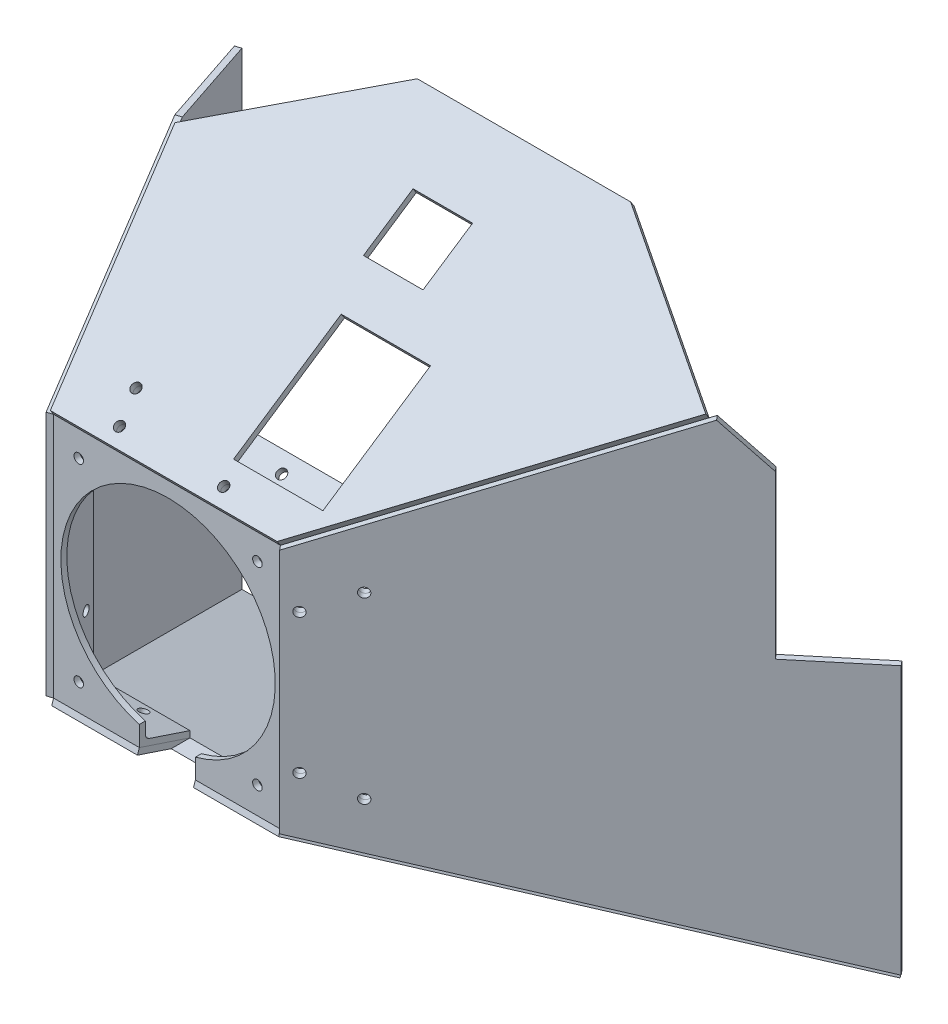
ISO-10303-21;
HEADER;
FILE_DESCRIPTION(('STEP AP214'),'2;1');
FILE_NAME('part.step','',(''),(''),'','','');
FILE_SCHEMA(('AUTOMOTIVE_DESIGN { 1 0 10303 214 1 1 1 1 }'));
ENDSEC;
DATA;
#1=APPLICATION_CONTEXT('core data for automotive mechanical design processes');
#2=APPLICATION_PROTOCOL_DEFINITION('international standard','automotive_design',2000,#1);
#3=PRODUCT_CONTEXT('',#1,'mechanical');
#4=PRODUCT('Part','Part','',(#3));
#5=PRODUCT_RELATED_PRODUCT_CATEGORY('part','',(#4));
#6=PRODUCT_DEFINITION_FORMATION('','',#4);
#7=PRODUCT_DEFINITION_CONTEXT('part definition',#1,'design');
#8=PRODUCT_DEFINITION('design','',#6,#7);
#9=PRODUCT_DEFINITION_SHAPE('','',#8);
#10=(LENGTH_UNIT() NAMED_UNIT(*) SI_UNIT(.MILLI.,.METRE.));
#11=(NAMED_UNIT(*) PLANE_ANGLE_UNIT() SI_UNIT($,.RADIAN.));
#12=(NAMED_UNIT(*) SI_UNIT($,.STERADIAN.) SOLID_ANGLE_UNIT());
#13=UNCERTAINTY_MEASURE_WITH_UNIT(LENGTH_MEASURE(1.E-05),#10,'distance_accuracy_value','');
#14=(GEOMETRIC_REPRESENTATION_CONTEXT(3) GLOBAL_UNCERTAINTY_ASSIGNED_CONTEXT((#13)) GLOBAL_UNIT_ASSIGNED_CONTEXT((#10,
#11,#12)) REPRESENTATION_CONTEXT('',''));
#15=CARTESIAN_POINT('',(0.,0.,0.));
#16=DIRECTION('',(0.,0.,1.));
#17=DIRECTION('',(1.,0.,0.));
#18=AXIS2_PLACEMENT_3D('',#15,#16,#17);
#19=CARTESIAN_POINT('',(0.,31.0205088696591,20.6803392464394));
#20=DIRECTION('',(0.,-0.832050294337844,-0.554700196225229));
#21=DIRECTION('',(0.,0.554700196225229,-0.832050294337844));
#22=AXIS2_PLACEMENT_3D('',#19,#20,#21);
#23=PLANE('',#22);
#24=DIRECTION('',(-1.,0.,0.));
#25=VECTOR('',#24,1.);
#26=CARTESIAN_POINT('',(0.,49.3908704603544,-6.87520313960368));
#27=LINE('',#26,#25);
#28=CARTESIAN_POINT('',(43.1240998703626,49.3908704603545,-6.87520313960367));
#29=VERTEX_POINT('',#28);
#30=CARTESIAN_POINT('',(13.1240998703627,49.3908704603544,-6.87520313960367));
#31=VERTEX_POINT('',#30);
#32=EDGE_CURVE('E416',#29,#31,#27,.T.);
#33=ORIENTED_EDGE('',*,*,#32,.T.);
#34=DIRECTION('',(0.,0.554700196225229,-0.832050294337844));
#35=VECTOR('',#34,1.);
#36=CARTESIAN_POINT('',(13.1240998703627,31.0205088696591,20.6803392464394));
#37=LINE('',#36,#35);
#38=CARTESIAN_POINT('',(13.1240998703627,73.4823083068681,-43.0123599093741));
#39=VERTEX_POINT('',#38);
#40=EDGE_CURVE('E418',#31,#39,#37,.T.);
#41=ORIENTED_EDGE('',*,*,#40,.T.);
#42=DIRECTION('',(1.,0.,0.));
#43=VECTOR('',#42,1.);
#44=CARTESIAN_POINT('',(0.,73.4823083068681,-43.0123599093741));
#45=LINE('',#44,#43);
#46=CARTESIAN_POINT('',(43.1240998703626,73.4823083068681,-43.0123599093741));
#47=VERTEX_POINT('',#46);
#48=EDGE_CURVE('E222',#39,#47,#45,.T.);
#49=ORIENTED_EDGE('',*,*,#48,.T.);
#50=DIRECTION('',(0.,-0.554700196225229,0.832050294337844));
#51=VECTOR('',#50,1.);
#52=CARTESIAN_POINT('',(43.1240998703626,31.0205088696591,20.6803392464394));
#53=LINE('',#52,#51);
#54=EDGE_CURVE('E197',#47,#29,#53,.T.);
#55=ORIENTED_EDGE('',*,*,#54,.T.);
#56=EDGE_LOOP('',(#33,#41,#49,#55));
#57=FACE_BOUND('',#56,.T.);
#58=DIRECTION('',(-1.,0.,0.));
#59=VECTOR('',#58,1.);
#60=CARTESIAN_POINT('',(0.,81.8028112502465,-55.4931143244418));
#61=LINE('',#60,#59);
#62=CARTESIAN_POINT('',(28.1240998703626,81.8028112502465,-55.4931143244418));
#63=VERTEX_POINT('',#62);
#64=CARTESIAN_POINT('',(8.12409987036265,81.8028112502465,-55.4931143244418));
#65=VERTEX_POINT('',#64);
#66=EDGE_CURVE('E240',#63,#65,#61,.T.);
#67=ORIENTED_EDGE('',*,*,#66,.T.);
#68=DIRECTION('',(0.,0.554700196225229,-0.832050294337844));
#69=VECTOR('',#68,1.);
#70=CARTESIAN_POINT('',(8.12409987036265,31.0205088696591,20.6803392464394));
#71=LINE('',#70,#69);
#72=CARTESIAN_POINT('',(8.12409987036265,92.8968151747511,-72.1341202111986));
#73=VERTEX_POINT('',#72);
#74=EDGE_CURVE('E245',#65,#73,#71,.T.);
#75=ORIENTED_EDGE('',*,*,#74,.T.);
#76=DIRECTION('',(1.,0.,0.));
#77=VECTOR('',#76,1.);
#78=CARTESIAN_POINT('',(0.,92.8968151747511,-72.1341202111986));
#79=LINE('',#78,#77);
#80=CARTESIAN_POINT('',(28.1240998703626,92.8968151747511,-72.1341202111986));
#81=VERTEX_POINT('',#80);
#82=EDGE_CURVE('E412',#73,#81,#79,.T.);
#83=ORIENTED_EDGE('',*,*,#82,.T.);
#84=DIRECTION('',(0.,-0.554700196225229,0.832050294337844));
#85=VECTOR('',#84,1.);
#86=CARTESIAN_POINT('',(28.1240998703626,31.0205088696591,20.6803392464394));
#87=LINE('',#86,#85);
#88=EDGE_CURVE('E246',#81,#63,#87,.T.);
#89=ORIENTED_EDGE('',*,*,#88,.T.);
#90=EDGE_LOOP('',(#67,#75,#83,#89));
#91=FACE_BOUND('',#90,.T.);
#92=DIRECTION('',(0.706561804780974,0.39253433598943,-0.588801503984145));
#93=VECTOR('',#92,1.);
#94=CARTESIAN_POINT('',(37.7240998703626,42.7344681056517,3.10940039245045));
#95=LINE('',#94,#93);
#96=CARTESIAN_POINT('',(37.7240998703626,42.7344681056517,3.10940039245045));
#97=VERTEX_POINT('',#96);
#98=CARTESIAN_POINT('',(116.238005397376,86.3533045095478,-62.3188542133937));
#99=VERTEX_POINT('',#98);
#100=EDGE_CURVE('E391',#97,#99,#95,.T.);
#101=ORIENTED_EDGE('',*,*,#100,.T.);
#102=DIRECTION('',(0.839523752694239,-0.30138136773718,0.45207205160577));
#103=VECTOR('',#102,1.);
#104=CARTESIAN_POINT('',(61.5660956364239,105.980021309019,-91.7589294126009));
#105=LINE('',#104,#103);
#106=CARTESIAN_POINT('',(61.5660956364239,105.980021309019,-91.7589294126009));
#107=VERTEX_POINT('',#106);
#108=EDGE_CURVE('E14',#99,#107,#105,.F.);
#109=ORIENTED_EDGE('',*,*,#108,.T.);
#110=DIRECTION('',(-1.,0.,0.));
#111=VECTOR('',#110,1.);
#112=CARTESIAN_POINT('',(151.566095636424,105.980021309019,-91.7589294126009));
#113=LINE('',#112,#111);
#114=CARTESIAN_POINT('',(-10.0642950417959,105.980021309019,-91.7589294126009));
#115=VERTEX_POINT('',#114);
#116=EDGE_CURVE('E384',#107,#115,#113,.T.);
#117=ORIENTED_EDGE('',*,*,#116,.T.);
#118=DIRECTION('',(0.78785475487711,0.341618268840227,-0.51242740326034));
#119=VECTOR('',#118,1.);
#120=CARTESIAN_POINT('',(-59.3738453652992,84.5991219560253,-59.68758038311));
#121=LINE('',#120,#119);
#122=CARTESIAN_POINT('',(-59.3738453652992,84.5991219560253,-59.68758038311));
#123=VERTEX_POINT('',#122);
#124=EDGE_CURVE('E346',#115,#123,#121,.F.);
#125=ORIENTED_EDGE('',*,*,#124,.T.);
#126=DIRECTION('',(0.267261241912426,-0.534522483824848,0.801783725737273));
#127=VECTOR('',#126,1.);
#128=CARTESIAN_POINT('',(-70.0642950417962,105.980021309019,-91.7589294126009));
#129=LINE('',#128,#127);
#130=CARTESIAN_POINT('',(-38.4415184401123,42.7344681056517,3.10940039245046));
#131=VERTEX_POINT('',#130);
#132=EDGE_CURVE('E373',#123,#131,#129,.T.);
#133=ORIENTED_EDGE('',*,*,#132,.T.);
#134=DIRECTION('',(1.,0.,0.));
#135=VECTOR('',#134,1.);
#136=CARTESIAN_POINT('',(-38.4415184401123,42.7344681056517,3.10940039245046));
#137=LINE('',#136,#135);
#138=EDGE_CURVE('E376',#131,#97,#137,.T.);
#139=ORIENTED_EDGE('',*,*,#138,.T.);
#140=EDGE_LOOP('',(#101,#109,#117,#125,#133,#139));
#141=FACE_BOUND('',#140,.T.);
#142=CARTESIAN_POINT('',(15.5575862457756,45.5470019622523,-1.10940039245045));
#143=DIRECTION('',(0.,0.832050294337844,0.554700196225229));
#144=DIRECTION('',(0.,-0.554700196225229,0.832050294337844));
#145=AXIS2_PLACEMENT_3D('',#142,#143,#144);
#146=CIRCLE('',#145,1.60000000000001);
#147=CARTESIAN_POINT('',(15.5575862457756,44.659481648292,0.221880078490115));
#148=VERTEX_POINT('',#147);
#149=EDGE_CURVE('E271',#148,#148,#146,.T.);
#150=ORIENTED_EDGE('',*,*,#149,.F.);
#151=EDGE_LOOP('',(#150));
#152=FACE_BOUND('',#151,.T.);
#153=CARTESIAN_POINT('',(-22.2111168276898,51.1094003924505,-9.45299803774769));
#154=DIRECTION('',(0.,0.832050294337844,0.554700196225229));
#155=DIRECTION('',(0.,-0.554700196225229,0.832050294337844));
#156=AXIS2_PLACEMENT_3D('',#153,#154,#155);
#157=CIRCLE('',#156,1.60000000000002);
#158=CARTESIAN_POINT('',(-22.2111168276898,50.2218800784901,-8.12171756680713));
#159=VERTEX_POINT('',#158);
#160=EDGE_CURVE('E284',#159,#159,#157,.T.);
#161=ORIENTED_EDGE('',*,*,#160,.F.);
#162=EDGE_LOOP('',(#161));
#163=FACE_BOUND('',#162,.T.);
#164=CARTESIAN_POINT('',(-19.4299176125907,45.5470019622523,-1.10940039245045));
#165=DIRECTION('',(0.,0.832050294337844,0.554700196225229));
#166=DIRECTION('',(0.,-0.554700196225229,0.832050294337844));
#167=AXIS2_PLACEMENT_3D('',#164,#165,#166);
#168=CIRCLE('',#167,1.60000000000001);
#169=CARTESIAN_POINT('',(-19.4299176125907,44.6594816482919,0.22188007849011));
#170=VERTEX_POINT('',#169);
#171=EDGE_CURVE('E253',#170,#170,#168,.T.);
#172=ORIENTED_EDGE('',*,*,#171,.F.);
#173=EDGE_LOOP('',(#172));
#174=FACE_BOUND('',#173,.T.);
#175=ADVANCED_FACE('F89',(#57,#91,#141,#152,#163,#174),#23,.F.);
#176=CARTESIAN_POINT('',(0.,29.3564082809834,19.5709388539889));
#177=DIRECTION('',(0.,-0.832050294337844,-0.554700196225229));
#178=DIRECTION('',(0.,0.554700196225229,-0.832050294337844));
#179=AXIS2_PLACEMENT_3D('',#176,#177,#178);
#180=PLANE('',#179);
#181=DIRECTION('',(0.,0.554700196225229,-0.832050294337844));
#182=VECTOR('',#181,1.);
#183=CARTESIAN_POINT('',(13.1240998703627,71.8182077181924,-44.1217603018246));
#184=LINE('',#183,#182);
#185=CARTESIAN_POINT('',(13.1240998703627,47.7267698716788,-7.98460353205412));
#186=VERTEX_POINT('',#185);
#187=CARTESIAN_POINT('',(13.1240998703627,71.8182077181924,-44.1217603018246));
#188=VERTEX_POINT('',#187);
#189=EDGE_CURVE('E210',#186,#188,#184,.T.);
#190=ORIENTED_EDGE('',*,*,#189,.F.);
#191=DIRECTION('',(-1.,0.,0.));
#192=VECTOR('',#191,1.);
#193=CARTESIAN_POINT('',(13.1240998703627,47.7267698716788,-7.98460353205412));
#194=LINE('',#193,#192);
#195=CARTESIAN_POINT('',(43.1240998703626,47.7267698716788,-7.98460353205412));
#196=VERTEX_POINT('',#195);
#197=EDGE_CURVE('E215',#196,#186,#194,.T.);
#198=ORIENTED_EDGE('',*,*,#197,.F.);
#199=DIRECTION('',(0.,-0.554700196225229,0.832050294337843));
#200=VECTOR('',#199,1.);
#201=CARTESIAN_POINT('',(43.1240998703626,71.8182077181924,-44.1217603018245));
#202=LINE('',#201,#200);
#203=CARTESIAN_POINT('',(43.1240998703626,71.8182077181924,-44.1217603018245));
#204=VERTEX_POINT('',#203);
#205=EDGE_CURVE('E194',#204,#196,#202,.T.);
#206=ORIENTED_EDGE('',*,*,#205,.F.);
#207=DIRECTION('',(1.,0.,0.));
#208=VECTOR('',#207,1.);
#209=CARTESIAN_POINT('',(13.1240998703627,71.8182077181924,-44.1217603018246));
#210=LINE('',#209,#208);
#211=EDGE_CURVE('E205',#188,#204,#210,.T.);
#212=ORIENTED_EDGE('',*,*,#211,.F.);
#213=EDGE_LOOP('',(#190,#198,#206,#212));
#214=FACE_BOUND('',#213,.T.);
#215=DIRECTION('',(0.,0.55470019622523,-0.832050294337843));
#216=VECTOR('',#215,1.);
#217=CARTESIAN_POINT('',(8.12409987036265,91.2327145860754,-73.2435206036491));
#218=LINE('',#217,#216);
#219=CARTESIAN_POINT('',(8.12409987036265,80.1387106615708,-56.6025147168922));
#220=VERTEX_POINT('',#219);
#221=CARTESIAN_POINT('',(8.12409987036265,91.2327145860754,-73.2435206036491));
#222=VERTEX_POINT('',#221);
#223=EDGE_CURVE('E421',#220,#222,#218,.T.);
#224=ORIENTED_EDGE('',*,*,#223,.F.);
#225=DIRECTION('',(-1.,0.,0.));
#226=VECTOR('',#225,1.);
#227=CARTESIAN_POINT('',(8.12409987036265,80.1387106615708,-56.6025147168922));
#228=LINE('',#227,#226);
#229=CARTESIAN_POINT('',(28.1240998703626,80.1387106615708,-56.6025147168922));
#230=VERTEX_POINT('',#229);
#231=EDGE_CURVE('E432',#230,#220,#228,.T.);
#232=ORIENTED_EDGE('',*,*,#231,.F.);
#233=DIRECTION('',(0.,-0.554700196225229,0.832050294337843));
#234=VECTOR('',#233,1.);
#235=CARTESIAN_POINT('',(28.1240998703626,91.2327145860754,-73.2435206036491));
#236=LINE('',#235,#234);
#237=CARTESIAN_POINT('',(28.1240998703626,91.2327145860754,-73.2435206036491));
#238=VERTEX_POINT('',#237);
#239=EDGE_CURVE('E429',#238,#230,#236,.T.);
#240=ORIENTED_EDGE('',*,*,#239,.F.);
#241=DIRECTION('',(1.,0.,0.));
#242=VECTOR('',#241,1.);
#243=CARTESIAN_POINT('',(8.12409987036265,91.2327145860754,-73.2435206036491));
#244=LINE('',#243,#242);
#245=EDGE_CURVE('E426',#222,#238,#244,.T.);
#246=ORIENTED_EDGE('',*,*,#245,.F.);
#247=EDGE_LOOP('',(#224,#232,#240,#246));
#248=FACE_BOUND('',#247,.T.);
#249=CARTESIAN_POINT('',(-22.2111168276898,49.4452998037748,-10.5623984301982));
#250=DIRECTION('',(0.,0.832050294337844,0.554700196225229));
#251=DIRECTION('',(0.,-0.554700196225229,0.832050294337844));
#252=AXIS2_PLACEMENT_3D('',#249,#250,#251);
#253=CIRCLE('',#252,1.60000000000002);
#254=CARTESIAN_POINT('',(-22.2111168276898,48.5577794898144,-9.23111795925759));
#255=VERTEX_POINT('',#254);
#256=EDGE_CURVE('E258',#255,#255,#253,.T.);
#257=ORIENTED_EDGE('',*,*,#256,.T.);
#258=EDGE_LOOP('',(#257));
#259=FACE_BOUND('',#258,.T.);
#260=DIRECTION('',(-1.,0.,0.));
#261=VECTOR('',#260,1.);
#262=CARTESIAN_POINT('',(151.566095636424,104.315920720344,-92.8683298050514));
#263=LINE('',#262,#261);
#264=CARTESIAN_POINT('',(61.5660956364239,104.315920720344,-92.8683298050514));
#265=VERTEX_POINT('',#264);
#266=CARTESIAN_POINT('',(-10.0642950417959,104.315920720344,-92.8683298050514));
#267=VERTEX_POINT('',#266);
#268=EDGE_CURVE('E377',#265,#267,#263,.T.);
#269=ORIENTED_EDGE('',*,*,#268,.F.);
#270=DIRECTION('',(-0.839523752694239,0.30138136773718,-0.45207205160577));
#271=VECTOR('',#270,1.);
#272=CARTESIAN_POINT('',(79.8138593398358,97.7651400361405,-83.0421587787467));
#273=LINE('',#272,#271);
#274=CARTESIAN_POINT('',(116.238005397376,84.6892039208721,-63.4282546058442));
#275=VERTEX_POINT('',#274);
#276=EDGE_CURVE('E112',#265,#275,#273,.F.);
#277=ORIENTED_EDGE('',*,*,#276,.T.);
#278=DIRECTION('',(0.706561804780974,0.39253433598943,-0.588801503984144));
#279=VECTOR('',#278,1.);
#280=CARTESIAN_POINT('',(58.1240998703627,52.4037008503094,-15.));
#281=LINE('',#280,#279);
#282=CARTESIAN_POINT('',(37.7240998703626,41.070367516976,1.99999999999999));
#283=VERTEX_POINT('',#282);
#284=EDGE_CURVE('E379',#283,#275,#281,.T.);
#285=ORIENTED_EDGE('',*,*,#284,.F.);
#286=DIRECTION('',(1.,0.,0.));
#287=VECTOR('',#286,1.);
#288=CARTESIAN_POINT('',(-38.4415184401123,41.070367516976,2.));
#289=LINE('',#288,#287);
#290=CARTESIAN_POINT('',(-38.4415184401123,41.070367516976,2.));
#291=VERTEX_POINT('',#290);
#292=EDGE_CURVE('E277',#291,#283,#289,.T.);
#293=ORIENTED_EDGE('',*,*,#292,.F.);
#294=DIRECTION('',(0.267261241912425,-0.534522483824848,0.801783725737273));
#295=VECTOR('',#294,1.);
#296=CARTESIAN_POINT('',(-44.1081851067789,52.4037008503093,-15.));
#297=LINE('',#296,#295);
#298=CARTESIAN_POINT('',(-59.3738453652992,82.9350213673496,-60.7969807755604));
#299=VERTEX_POINT('',#298);
#300=EDGE_CURVE('E374',#299,#291,#297,.T.);
#301=ORIENTED_EDGE('',*,*,#300,.F.);
#302=DIRECTION('',(-0.78785475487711,-0.341618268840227,0.51242740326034));
#303=VECTOR('',#302,1.);
#304=CARTESIAN_POINT('',(-69.3860540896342,78.5936711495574,-54.2849554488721));
#305=LINE('',#304,#303);
#306=EDGE_CURVE('E360',#299,#267,#305,.F.);
#307=ORIENTED_EDGE('',*,*,#306,.T.);
#308=EDGE_LOOP('',(#269,#277,#285,#293,#301,#307));
#309=FACE_BOUND('',#308,.T.);
#310=CARTESIAN_POINT('',(15.5575862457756,43.8829013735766,-2.2188007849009));
#311=DIRECTION('',(0.,0.832050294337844,0.554700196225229));
#312=DIRECTION('',(0.,-0.554700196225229,0.832050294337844));
#313=AXIS2_PLACEMENT_3D('',#310,#311,#312);
#314=CIRCLE('',#313,1.60000000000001);
#315=CARTESIAN_POINT('',(15.5575862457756,42.9953810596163,-0.887520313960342));
#316=VERTEX_POINT('',#315);
#317=EDGE_CURVE('E278',#316,#316,#314,.T.);
#318=ORIENTED_EDGE('',*,*,#317,.T.);
#319=EDGE_LOOP('',(#318));
#320=FACE_BOUND('',#319,.T.);
#321=CARTESIAN_POINT('',(-19.4299176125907,43.8829013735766,-2.21880078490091));
#322=DIRECTION('',(0.,0.832050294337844,0.554700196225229));
#323=DIRECTION('',(0.,-0.554700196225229,0.832050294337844));
#324=AXIS2_PLACEMENT_3D('',#321,#322,#323);
#325=CIRCLE('',#324,1.60000000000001);
#326=CARTESIAN_POINT('',(-19.4299176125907,42.9953810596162,-0.887520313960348));
#327=VERTEX_POINT('',#326);
#328=EDGE_CURVE('E252',#327,#327,#325,.T.);
#329=ORIENTED_EDGE('',*,*,#328,.T.);
#330=EDGE_LOOP('',(#329));
#331=FACE_BOUND('',#330,.T.);
#332=ADVANCED_FACE('F212',(#214,#248,#259,#309,#320,#331),#180,.T.);
#333=CARTESIAN_POINT('',(-38.4415184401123,42.7344681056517,3.10940039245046));
#334=DIRECTION('',(0.,0.554700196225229,-0.832050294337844));
#335=DIRECTION('',(0.,0.832050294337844,0.554700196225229));
#336=AXIS2_PLACEMENT_3D('',#333,#334,#335);
#337=PLANE('',#336);
#338=ORIENTED_EDGE('',*,*,#292,.T.);
#339=DIRECTION('',(0.,-0.832050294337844,-0.554700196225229));
#340=VECTOR('',#339,1.);
#341=CARTESIAN_POINT('',(37.7240998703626,42.7344681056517,3.10940039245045));
#342=LINE('',#341,#340);
#343=EDGE_CURVE('E367',#97,#283,#342,.T.);
#344=ORIENTED_EDGE('',*,*,#343,.F.);
#345=ORIENTED_EDGE('',*,*,#138,.F.);
#346=DIRECTION('',(0.,-0.832050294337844,-0.554700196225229));
#347=VECTOR('',#346,1.);
#348=CARTESIAN_POINT('',(-38.4415184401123,42.7344681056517,3.10940039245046));
#349=LINE('',#348,#347);
#350=EDGE_CURVE('E370',#131,#291,#349,.T.);
#351=ORIENTED_EDGE('',*,*,#350,.T.);
#352=EDGE_LOOP('',(#338,#344,#345,#351));
#353=FACE_BOUND('',#352,.T.);
#354=ADVANCED_FACE('F317',(#353),#337,.F.);
#355=CARTESIAN_POINT('',(58.1240998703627,54.0678014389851,-13.8905996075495));
#356=DIRECTION('',(-0.707651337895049,0.391929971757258,-0.587894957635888));
#357=DIRECTION('',(-0.639019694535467,0.,0.76919037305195));
#358=AXIS2_PLACEMENT_3D('',#355,#356,#357);
#359=PLANE('',#358);
#360=ORIENTED_EDGE('',*,*,#284,.T.);
#361=DIRECTION('',(0.,0.832050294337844,0.554700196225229));
#362=VECTOR('',#361,1.);
#363=CARTESIAN_POINT('',(116.238005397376,86.3533045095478,-62.3188542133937));
#364=LINE('',#363,#362);
#365=EDGE_CURVE('E98',#275,#99,#364,.T.);
#366=ORIENTED_EDGE('',*,*,#365,.T.);
#367=ORIENTED_EDGE('',*,*,#100,.F.);
#368=ORIENTED_EDGE('',*,*,#343,.T.);
#369=EDGE_LOOP('',(#360,#366,#367,#368));
#370=FACE_BOUND('',#369,.T.);
#371=ADVANCED_FACE('F328',(#370),#359,.F.);
#372=CARTESIAN_POINT('',(151.566095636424,105.980021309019,-91.7589294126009));
#373=DIRECTION('',(0.,-0.554700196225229,0.832050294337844));
#374=DIRECTION('',(0.,-0.832050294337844,-0.554700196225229));
#375=AXIS2_PLACEMENT_3D('',#372,#373,#374);
#376=PLANE('',#375);
#377=ORIENTED_EDGE('',*,*,#116,.F.);
#378=DIRECTION('',(0.,-0.832050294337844,-0.554700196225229));
#379=VECTOR('',#378,1.);
#380=CARTESIAN_POINT('',(61.5660956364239,105.980021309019,-91.7589294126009));
#381=LINE('',#380,#379);
#382=EDGE_CURVE('E354',#107,#265,#381,.T.);
#383=ORIENTED_EDGE('',*,*,#382,.T.);
#384=ORIENTED_EDGE('',*,*,#268,.T.);
#385=DIRECTION('',(0.,0.832050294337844,0.554700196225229));
#386=VECTOR('',#385,1.);
#387=CARTESIAN_POINT('',(-10.0642950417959,105.980021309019,-91.7589294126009));
#388=LINE('',#387,#386);
#389=EDGE_CURVE('E348',#267,#115,#388,.T.);
#390=ORIENTED_EDGE('',*,*,#389,.T.);
#391=EDGE_LOOP('',(#377,#383,#384,#390));
#392=FACE_BOUND('',#391,.T.);
#393=ADVANCED_FACE('F324',(#392),#376,.F.);
#394=CARTESIAN_POINT('',(-44.1081851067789,54.067801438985,-13.8905996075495));
#395=DIRECTION('',(0.963624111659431,0.148249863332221,-0.222374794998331));
#396=DIRECTION('',(-0.224859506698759,0.,-0.97439119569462));
#397=AXIS2_PLACEMENT_3D('',#394,#395,#396);
#398=PLANE('',#397);
#399=ORIENTED_EDGE('',*,*,#132,.F.);
#400=DIRECTION('',(0.,-0.832050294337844,-0.554700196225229));
#401=VECTOR('',#400,1.);
#402=CARTESIAN_POINT('',(-59.3738453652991,84.5991219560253,-59.68758038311));
#403=LINE('',#402,#401);
#404=EDGE_CURVE('E350',#123,#299,#403,.T.);
#405=ORIENTED_EDGE('',*,*,#404,.T.);
#406=ORIENTED_EDGE('',*,*,#300,.T.);
#407=ORIENTED_EDGE('',*,*,#350,.F.);
#408=EDGE_LOOP('',(#399,#405,#406,#407));
#409=FACE_BOUND('',#408,.T.);
#410=ADVANCED_FACE('F308',(#409),#398,.F.);
#411=CARTESIAN_POINT('',(15.5575862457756,45.5470019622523,-1.10940039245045));
#412=DIRECTION('',(0.,-0.832050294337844,-0.554700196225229));
#413=DIRECTION('',(0.,0.554700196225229,-0.832050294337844));
#414=AXIS2_PLACEMENT_3D('',#411,#412,#413);
#415=CYLINDRICAL_SURFACE('',#414,1.60000000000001);
#416=ORIENTED_EDGE('',*,*,#149,.T.);
#417=EDGE_LOOP('',(#416));
#418=FACE_BOUND('',#417,.T.);
#419=ORIENTED_EDGE('',*,*,#317,.F.);
#420=EDGE_LOOP('',(#419));
#421=FACE_BOUND('',#420,.T.);
#422=ADVANCED_FACE('F299',(#418,#421),#415,.F.);
#423=CARTESIAN_POINT('',(-22.2111168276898,51.1094003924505,-9.45299803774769));
#424=DIRECTION('',(0.,-0.832050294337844,-0.554700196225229));
#425=DIRECTION('',(0.,0.554700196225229,-0.832050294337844));
#426=AXIS2_PLACEMENT_3D('',#423,#424,#425);
#427=CYLINDRICAL_SURFACE('',#426,1.60000000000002);
#428=ORIENTED_EDGE('',*,*,#160,.T.);
#429=EDGE_LOOP('',(#428));
#430=FACE_BOUND('',#429,.T.);
#431=ORIENTED_EDGE('',*,*,#256,.F.);
#432=EDGE_LOOP('',(#431));
#433=FACE_BOUND('',#432,.T.);
#434=ADVANCED_FACE('F296',(#430,#433),#427,.F.);
#435=CARTESIAN_POINT('',(-19.4299176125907,45.5470019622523,-1.10940039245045));
#436=DIRECTION('',(0.,-0.832050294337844,-0.554700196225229));
#437=DIRECTION('',(0.,0.554700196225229,-0.832050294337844));
#438=AXIS2_PLACEMENT_3D('',#435,#436,#437);
#439=CYLINDRICAL_SURFACE('',#438,1.60000000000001);
#440=ORIENTED_EDGE('',*,*,#171,.T.);
#441=EDGE_LOOP('',(#440));
#442=FACE_BOUND('',#441,.T.);
#443=ORIENTED_EDGE('',*,*,#328,.F.);
#444=EDGE_LOOP('',(#443));
#445=FACE_BOUND('',#444,.T.);
#446=ADVANCED_FACE('F298',(#442,#445),#439,.F.);
#447=CARTESIAN_POINT('',(8.12409987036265,93.728865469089,-71.5794200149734));
#448=DIRECTION('',(-1.,0.,0.));
#449=DIRECTION('',(0.,-1.,0.));
#450=AXIS2_PLACEMENT_3D('',#447,#448,#449);
#451=PLANE('',#450);
#452=DIRECTION('',(0.,-0.832050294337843,-0.554700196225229));
#453=VECTOR('',#452,1.);
#454=CARTESIAN_POINT('',(8.12409987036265,82.6348615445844,-54.9384141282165));
#455=LINE('',#454,#453);
#456=EDGE_CURVE('E414',#65,#220,#455,.T.);
#457=ORIENTED_EDGE('',*,*,#456,.T.);
#458=ORIENTED_EDGE('',*,*,#223,.T.);
#459=DIRECTION('',(0.,-0.832050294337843,-0.554700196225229));
#460=VECTOR('',#459,1.);
#461=CARTESIAN_POINT('',(8.12409987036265,93.728865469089,-71.5794200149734));
#462=LINE('',#461,#460);
#463=EDGE_CURVE('E435',#73,#222,#462,.T.);
#464=ORIENTED_EDGE('',*,*,#463,.F.);
#465=ORIENTED_EDGE('',*,*,#74,.F.);
#466=EDGE_LOOP('',(#457,#458,#464,#465));
#467=FACE_BOUND('',#466,.T.);
#468=ADVANCED_FACE('F305',(#467),#451,.F.);
#469=CARTESIAN_POINT('',(8.12409987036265,82.6348615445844,-54.9384141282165));
#470=DIRECTION('',(0.,-0.554700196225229,0.832050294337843));
#471=DIRECTION('',(0.,-0.832050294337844,-0.554700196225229));
#472=AXIS2_PLACEMENT_3D('',#469,#470,#471);
#473=PLANE('',#472);
#474=DIRECTION('',(0.,-0.832050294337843,-0.554700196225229));
#475=VECTOR('',#474,1.);
#476=CARTESIAN_POINT('',(28.1240998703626,82.6348615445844,-54.9384141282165));
#477=LINE('',#476,#475);
#478=EDGE_CURVE('E437',#63,#230,#477,.T.);
#479=ORIENTED_EDGE('',*,*,#478,.T.);
#480=ORIENTED_EDGE('',*,*,#231,.T.);
#481=ORIENTED_EDGE('',*,*,#456,.F.);
#482=ORIENTED_EDGE('',*,*,#66,.F.);
#483=EDGE_LOOP('',(#479,#480,#481,#482));
#484=FACE_BOUND('',#483,.T.);
#485=ADVANCED_FACE('F457',(#484),#473,.F.);
#486=CARTESIAN_POINT('',(28.1240998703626,93.728865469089,-71.5794200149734));
#487=DIRECTION('',(1.,0.,0.));
#488=DIRECTION('',(0.,1.,0.));
#489=AXIS2_PLACEMENT_3D('',#486,#487,#488);
#490=PLANE('',#489);
#491=DIRECTION('',(0.,-0.832050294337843,-0.554700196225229));
#492=VECTOR('',#491,1.);
#493=CARTESIAN_POINT('',(28.1240998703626,93.728865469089,-71.5794200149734));
#494=LINE('',#493,#492);
#495=EDGE_CURVE('E439',#81,#238,#494,.T.);
#496=ORIENTED_EDGE('',*,*,#495,.T.);
#497=ORIENTED_EDGE('',*,*,#239,.T.);
#498=ORIENTED_EDGE('',*,*,#478,.F.);
#499=ORIENTED_EDGE('',*,*,#88,.F.);
#500=EDGE_LOOP('',(#496,#497,#498,#499));
#501=FACE_BOUND('',#500,.T.);
#502=ADVANCED_FACE('F453',(#501),#490,.F.);
#503=CARTESIAN_POINT('',(8.12409987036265,93.728865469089,-71.5794200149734));
#504=DIRECTION('',(0.,0.554700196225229,-0.832050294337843));
#505=DIRECTION('',(0.,0.832050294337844,0.554700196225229));
#506=AXIS2_PLACEMENT_3D('',#503,#504,#505);
#507=PLANE('',#506);
#508=ORIENTED_EDGE('',*,*,#463,.T.);
#509=ORIENTED_EDGE('',*,*,#245,.T.);
#510=ORIENTED_EDGE('',*,*,#495,.F.);
#511=ORIENTED_EDGE('',*,*,#82,.F.);
#512=EDGE_LOOP('',(#508,#509,#510,#511));
#513=FACE_BOUND('',#512,.T.);
#514=ADVANCED_FACE('F446',(#513),#507,.F.);
#515=CARTESIAN_POINT('',(13.1240998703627,74.3143586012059,-42.4576597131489));
#516=DIRECTION('',(-1.,0.,0.));
#517=DIRECTION('',(0.,-1.,0.));
#518=AXIS2_PLACEMENT_3D('',#515,#516,#517);
#519=PLANE('',#518);
#520=DIRECTION('',(0.,-0.832050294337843,-0.554700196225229));
#521=VECTOR('',#520,1.);
#522=CARTESIAN_POINT('',(13.1240998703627,50.2229207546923,-6.32050294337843));
#523=LINE('',#522,#521);
#524=EDGE_CURVE('E220',#31,#186,#523,.T.);
#525=ORIENTED_EDGE('',*,*,#524,.T.);
#526=ORIENTED_EDGE('',*,*,#189,.T.);
#527=DIRECTION('',(0.,-0.832050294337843,-0.554700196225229));
#528=VECTOR('',#527,1.);
#529=CARTESIAN_POINT('',(13.1240998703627,74.3143586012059,-42.4576597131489));
#530=LINE('',#529,#528);
#531=EDGE_CURVE('E201',#39,#188,#530,.T.);
#532=ORIENTED_EDGE('',*,*,#531,.F.);
#533=ORIENTED_EDGE('',*,*,#40,.F.);
#534=EDGE_LOOP('',(#525,#526,#532,#533));
#535=FACE_BOUND('',#534,.T.);
#536=ADVANCED_FACE('F467',(#535),#519,.F.);
#537=CARTESIAN_POINT('',(13.1240998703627,50.2229207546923,-6.32050294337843));
#538=DIRECTION('',(0.,-0.554700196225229,0.832050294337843));
#539=DIRECTION('',(0.,-0.832050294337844,-0.554700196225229));
#540=AXIS2_PLACEMENT_3D('',#537,#538,#539);
#541=PLANE('',#540);
#542=DIRECTION('',(0.,-0.832050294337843,-0.554700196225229));
#543=VECTOR('',#542,1.);
#544=CARTESIAN_POINT('',(43.1240998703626,50.2229207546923,-6.32050294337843));
#545=LINE('',#544,#543);
#546=EDGE_CURVE('E200',#29,#196,#545,.T.);
#547=ORIENTED_EDGE('',*,*,#546,.T.);
#548=ORIENTED_EDGE('',*,*,#197,.T.);
#549=ORIENTED_EDGE('',*,*,#524,.F.);
#550=ORIENTED_EDGE('',*,*,#32,.F.);
#551=EDGE_LOOP('',(#547,#548,#549,#550));
#552=FACE_BOUND('',#551,.T.);
#553=ADVANCED_FACE('F473',(#552),#541,.F.);
#554=CARTESIAN_POINT('',(43.1240998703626,74.3143586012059,-42.4576597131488));
#555=DIRECTION('',(1.,0.,0.));
#556=DIRECTION('',(0.,1.,0.));
#557=AXIS2_PLACEMENT_3D('',#554,#555,#556);
#558=PLANE('',#557);
#559=DIRECTION('',(0.,-0.832050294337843,-0.554700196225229));
#560=VECTOR('',#559,1.);
#561=CARTESIAN_POINT('',(43.1240998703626,74.3143586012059,-42.4576597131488));
#562=LINE('',#561,#560);
#563=EDGE_CURVE('E189',#47,#204,#562,.T.);
#564=ORIENTED_EDGE('',*,*,#563,.T.);
#565=ORIENTED_EDGE('',*,*,#205,.T.);
#566=ORIENTED_EDGE('',*,*,#546,.F.);
#567=ORIENTED_EDGE('',*,*,#54,.F.);
#568=EDGE_LOOP('',(#564,#565,#566,#567));
#569=FACE_BOUND('',#568,.T.);
#570=ADVANCED_FACE('F191',(#569),#558,.F.);
#571=CARTESIAN_POINT('',(13.1240998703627,74.3143586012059,-42.4576597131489));
#572=DIRECTION('',(0.,0.554700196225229,-0.832050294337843));
#573=DIRECTION('',(0.,0.832050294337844,0.554700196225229));
#574=AXIS2_PLACEMENT_3D('',#571,#572,#573);
#575=PLANE('',#574);
#576=ORIENTED_EDGE('',*,*,#531,.T.);
#577=ORIENTED_EDGE('',*,*,#211,.T.);
#578=ORIENTED_EDGE('',*,*,#563,.F.);
#579=ORIENTED_EDGE('',*,*,#48,.F.);
#580=EDGE_LOOP('',(#576,#577,#578,#579));
#581=FACE_BOUND('',#580,.T.);
#582=ADVANCED_FACE('F206',(#581),#575,.F.);
#583=CARTESIAN_POINT('',(-59.3738453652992,84.5991219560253,-59.68758038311));
#584=DIRECTION('',(0.61586109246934,-0.437023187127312,0.655534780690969));
#585=DIRECTION('',(0.,-0.832050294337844,-0.554700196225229));
#586=AXIS2_PLACEMENT_3D('',#583,#584,#585);
#587=PLANE('',#586);
#588=ORIENTED_EDGE('',*,*,#124,.F.);
#589=ORIENTED_EDGE('',*,*,#389,.F.);
#590=ORIENTED_EDGE('',*,*,#306,.F.);
#591=ORIENTED_EDGE('',*,*,#404,.F.);
#592=EDGE_LOOP('',(#588,#589,#590,#591));
#593=FACE_BOUND('',#592,.T.);
#594=ADVANCED_FACE('F334',(#593),#587,.F.);
#595=CARTESIAN_POINT('',(61.5660956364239,105.980021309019,-91.7589294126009));
#596=DIRECTION('',(-0.543322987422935,-0.465683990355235,0.698525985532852));
#597=DIRECTION('',(0.,-0.832050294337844,-0.554700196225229));
#598=AXIS2_PLACEMENT_3D('',#595,#596,#597);
#599=PLANE('',#598);
#600=ORIENTED_EDGE('',*,*,#108,.F.);
#601=ORIENTED_EDGE('',*,*,#365,.F.);
#602=ORIENTED_EDGE('',*,*,#276,.F.);
#603=ORIENTED_EDGE('',*,*,#382,.F.);
#604=EDGE_LOOP('',(#600,#601,#602,#603));
#605=FACE_BOUND('',#604,.T.);
#606=ADVANCED_FACE('F91',(#605),#599,.F.);
#607=CLOSED_SHELL('',(#175,#332,#354,#371,#393,#410,#422,#434,#446,#468,#485,#502,#514,#536,
#553,#570,#582,#594,#606));
#608=MANIFOLD_SOLID_BREP('B2',#607);
#609=CARTESIAN_POINT('',(17.7246720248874,0.,21.2696064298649));
#610=DIRECTION('',(0.640184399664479,0.,0.768221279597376));
#611=DIRECTION('',(0.768221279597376,0.,-0.640184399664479));
#612=AXIS2_PLACEMENT_3D('',#609,#610,#611);
#613=PLANE('',#612);
#614=DIRECTION('',(0.,-1.,0.));
#615=VECTOR('',#614,1.);
#616=CARTESIAN_POINT('',(129.799826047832,127.309172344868,-72.1263552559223));
#617=LINE('',#616,#615);
#618=CARTESIAN_POINT('',(129.799826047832,71.512232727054,-72.1263552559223));
#619=VERTEX_POINT('',#618);
#620=CARTESIAN_POINT('',(129.799826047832,16.9357049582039,-72.1263552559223));
#621=VERTEX_POINT('',#620);
#622=EDGE_CURVE('E675',#619,#621,#617,.T.);
#623=ORIENTED_EDGE('',*,*,#622,.F.);
#624=DIRECTION('',(0.54321447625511,-0.70710678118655,-0.452678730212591));
#625=VECTOR('',#624,1.);
#626=CARTESIAN_POINT('',(101.230858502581,108.700694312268,-48.3188823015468));
#627=LINE('',#626,#625);
#628=CARTESIAN_POINT('',(119.031296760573,85.5297164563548,-63.1525808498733));
#629=VERTEX_POINT('',#628);
#630=EDGE_CURVE('E87',#619,#629,#627,.F.);
#631=ORIENTED_EDGE('',*,*,#630,.T.);
#632=DIRECTION('',(-0.706561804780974,-0.39253433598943,0.588801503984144));
#633=VECTOR('',#632,1.);
#634=CARTESIAN_POINT('',(152.846464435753,104.315920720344,-91.3318872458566));
#635=LINE('',#634,#633);
#636=CARTESIAN_POINT('',(39.0044686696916,41.070367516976,3.53644255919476));
#637=VERTEX_POINT('',#636);
#638=EDGE_CURVE('E752',#629,#637,#635,.T.);
#639=ORIENTED_EDGE('',*,*,#638,.T.);
#640=DIRECTION('',(0.,-1.,0.));
#641=VECTOR('',#640,1.);
#642=CARTESIAN_POINT('',(39.0044686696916,41.070367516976,3.53644255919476));
#643=LINE('',#642,#641);
#644=CARTESIAN_POINT('',(39.0044686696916,-41.4415184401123,3.53644255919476));
#645=VERTEX_POINT('',#644);
#646=EDGE_CURVE('E738',#637,#645,#643,.T.);
#647=ORIENTED_EDGE('',*,*,#646,.T.);
#648=DIRECTION('',(0.751305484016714,-0.20869596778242,-0.626087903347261));
#649=VECTOR('',#648,1.);
#650=CARTESIAN_POINT('',(39.0044686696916,-41.4415184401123,3.53644255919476));
#651=LINE('',#650,#649);
#652=CARTESIAN_POINT('',(152.846464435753,-73.0642950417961,-91.3318872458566));
#653=VERTEX_POINT('',#652);
#654=EDGE_CURVE('E743',#645,#653,#651,.T.);
#655=ORIENTED_EDGE('',*,*,#654,.T.);
#656=DIRECTION('',(0.,1.,0.));
#657=VECTOR('',#656,1.);
#658=CARTESIAN_POINT('',(152.846464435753,-73.0642950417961,-91.3318872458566));
#659=LINE('',#658,#657);
#660=CARTESIAN_POINT('',(152.846464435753,16.9357049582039,-91.3318872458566));
#661=VERTEX_POINT('',#660);
#662=EDGE_CURVE('E696',#653,#661,#659,.T.);
#663=ORIENTED_EDGE('',*,*,#662,.T.);
#664=DIRECTION('',(0.768221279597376,0.,-0.64018439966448));
#665=VECTOR('',#664,1.);
#666=CARTESIAN_POINT('',(129.799826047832,16.9357049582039,-72.1263552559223));
#667=LINE('',#666,#665);
#668=EDGE_CURVE('E683',#621,#661,#667,.T.);
#669=ORIENTED_EDGE('',*,*,#668,.F.);
#670=EDGE_LOOP('',(#623,#631,#639,#647,#655,#663,#669));
#671=FACE_BOUND('',#670,.T.);
#672=CARTESIAN_POINT('',(42.6336227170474,-23.4143167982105,0.512147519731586));
#673=DIRECTION('',(0.640184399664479,0.,0.768221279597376));
#674=DIRECTION('',(0.768221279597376,0.,-0.640184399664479));
#675=AXIS2_PLACEMENT_3D('',#672,#673,#674);
#676=CIRCLE('',#675,1.59999999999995);
#677=CARTESIAN_POINT('',(43.8627767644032,-23.4143167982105,-0.512147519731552));
#678=VERTEX_POINT('',#677);
#679=EDGE_CURVE('E712',#678,#678,#676,.T.);
#680=ORIENTED_EDGE('',*,*,#679,.F.);
#681=EDGE_LOOP('',(#680));
#682=FACE_BOUND('',#681,.T.);
#683=CARTESIAN_POINT('',(54.4878524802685,30.,-9.3663772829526));
#684=DIRECTION('',(0.640184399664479,0.,0.768221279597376));
#685=DIRECTION('',(0.768221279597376,0.,-0.640184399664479));
#686=AXIS2_PLACEMENT_3D('',#683,#684,#685);
#687=CIRCLE('',#686,1.6);
#688=CARTESIAN_POINT('',(55.7170065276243,30.,-10.3906723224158));
#689=VERTEX_POINT('',#688);
#690=EDGE_CURVE('E727',#689,#689,#687,.T.);
#691=ORIENTED_EDGE('',*,*,#690,.F.);
#692=EDGE_LOOP('',(#691));
#693=FACE_BOUND('',#692,.T.);
#694=CARTESIAN_POINT('',(42.6336227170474,23.4143167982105,0.512147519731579));
#695=DIRECTION('',(0.640184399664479,0.,0.768221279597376));
#696=DIRECTION('',(0.768221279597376,0.,-0.640184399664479));
#697=AXIS2_PLACEMENT_3D('',#694,#695,#696);
#698=CIRCLE('',#697,1.60000000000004);
#699=CARTESIAN_POINT('',(43.8627767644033,23.4143167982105,-0.512147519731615));
#700=VERTEX_POINT('',#699);
#701=EDGE_CURVE('E737',#700,#700,#698,.T.);
#702=ORIENTED_EDGE('',*,*,#701,.F.);
#703=EDGE_LOOP('',(#702));
#704=FACE_BOUND('',#703,.T.);
#705=CARTESIAN_POINT('',(54.4878524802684,-30.,-9.36637728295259));
#706=DIRECTION('',(0.640184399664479,0.,0.768221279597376));
#707=DIRECTION('',(0.768221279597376,0.,-0.640184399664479));
#708=AXIS2_PLACEMENT_3D('',#705,#706,#707);
#709=CIRCLE('',#708,1.6);
#710=CARTESIAN_POINT('',(55.7170065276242,-30.,-10.3906723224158));
#711=VERTEX_POINT('',#710);
#712=EDGE_CURVE('E848',#711,#711,#709,.T.);
#713=ORIENTED_EDGE('',*,*,#712,.F.);
#714=EDGE_LOOP('',(#713));
#715=FACE_BOUND('',#714,.T.);
#716=ADVANCED_FACE('F619',(#671,#682,#693,#704,#715),#613,.T.);
#717=CARTESIAN_POINT('',(16.4443032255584,0.,19.7331638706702));
#718=DIRECTION('',(0.640184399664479,0.,0.768221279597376));
#719=DIRECTION('',(0.768221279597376,0.,-0.640184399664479));
#720=AXIS2_PLACEMENT_3D('',#717,#718,#719);
#721=PLANE('',#720);
#722=DIRECTION('',(-0.706561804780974,-0.39253433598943,0.588801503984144));
#723=VECTOR('',#722,1.);
#724=CARTESIAN_POINT('',(58.1240998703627,52.4037008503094,-15.));
#725=LINE('',#724,#723);
#726=CARTESIAN_POINT('',(117.750927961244,85.5297164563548,-64.6890234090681));
#727=VERTEX_POINT('',#726);
#728=CARTESIAN_POINT('',(37.7240998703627,41.070367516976,2.00000000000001));
#729=VERTEX_POINT('',#728);
#730=EDGE_CURVE('E744',#727,#729,#725,.T.);
#731=ORIENTED_EDGE('',*,*,#730,.F.);
#732=DIRECTION('',(-0.54321447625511,0.70710678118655,0.452678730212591));
#733=VECTOR('',#732,1.);
#734=CARTESIAN_POINT('',(117.750927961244,85.5297164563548,-64.689023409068));
#735=LINE('',#734,#733);
#736=CARTESIAN_POINT('',(128.519457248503,71.512232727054,-73.662797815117));
#737=VERTEX_POINT('',#736);
#738=EDGE_CURVE('E642',#727,#737,#735,.F.);
#739=ORIENTED_EDGE('',*,*,#738,.T.);
#740=DIRECTION('',(0.,-1.,0.));
#741=VECTOR('',#740,1.);
#742=CARTESIAN_POINT('',(128.519457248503,0.,-73.662797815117));
#743=LINE('',#742,#741);
#744=CARTESIAN_POINT('',(128.519457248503,16.9357049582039,-73.662797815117));
#745=VERTEX_POINT('',#744);
#746=EDGE_CURVE('E691',#737,#745,#743,.T.);
#747=ORIENTED_EDGE('',*,*,#746,.T.);
#748=DIRECTION('',(0.768221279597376,0.,-0.640184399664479));
#749=VECTOR('',#748,1.);
#750=CARTESIAN_POINT('',(16.4443032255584,16.9357049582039,19.7331638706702));
#751=LINE('',#750,#749);
#752=CARTESIAN_POINT('',(151.566095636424,16.9357049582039,-92.8683298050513));
#753=VERTEX_POINT('',#752);
#754=EDGE_CURVE('E690',#745,#753,#751,.T.);
#755=ORIENTED_EDGE('',*,*,#754,.T.);
#756=DIRECTION('',(0.,1.,0.));
#757=VECTOR('',#756,1.);
#758=CARTESIAN_POINT('',(151.566095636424,-73.0642950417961,-92.8683298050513));
#759=LINE('',#758,#757);
#760=CARTESIAN_POINT('',(151.566095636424,-73.0642950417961,-92.8683298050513));
#761=VERTEX_POINT('',#760);
#762=EDGE_CURVE('E822',#761,#753,#759,.T.);
#763=ORIENTED_EDGE('',*,*,#762,.F.);
#764=DIRECTION('',(0.751305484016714,-0.20869596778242,-0.626087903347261));
#765=VECTOR('',#764,1.);
#766=CARTESIAN_POINT('',(58.1240998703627,-47.1081851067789,-15.));
#767=LINE('',#766,#765);
#768=CARTESIAN_POINT('',(37.7240998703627,-41.4415184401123,2.00000000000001));
#769=VERTEX_POINT('',#768);
#770=EDGE_CURVE('E821',#769,#761,#767,.T.);
#771=ORIENTED_EDGE('',*,*,#770,.F.);
#772=DIRECTION('',(0.,-1.,0.));
#773=VECTOR('',#772,1.);
#774=CARTESIAN_POINT('',(37.7240998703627,41.070367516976,2.00000000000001));
#775=LINE('',#774,#773);
#776=EDGE_CURVE('E733',#729,#769,#775,.T.);
#777=ORIENTED_EDGE('',*,*,#776,.F.);
#778=EDGE_LOOP('',(#731,#739,#747,#755,#763,#771,#777));
#779=FACE_BOUND('',#778,.T.);
#780=CARTESIAN_POINT('',(53.2074836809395,30.,-10.9028198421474));
#781=DIRECTION('',(0.640184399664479,0.,0.768221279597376));
#782=DIRECTION('',(0.768221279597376,0.,-0.640184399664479));
#783=AXIS2_PLACEMENT_3D('',#780,#781,#782);
#784=CIRCLE('',#783,1.6);
#785=CARTESIAN_POINT('',(54.4366377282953,30.,-11.9271148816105));
#786=VERTEX_POINT('',#785);
#787=EDGE_CURVE('E734',#786,#786,#784,.T.);
#788=ORIENTED_EDGE('',*,*,#787,.T.);
#789=EDGE_LOOP('',(#788));
#790=FACE_BOUND('',#789,.T.);
#791=CARTESIAN_POINT('',(41.3532539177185,23.4143167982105,-1.02429503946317));
#792=DIRECTION('',(0.640184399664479,0.,0.768221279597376));
#793=DIRECTION('',(0.768221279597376,0.,-0.640184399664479));
#794=AXIS2_PLACEMENT_3D('',#791,#792,#793);
#795=CIRCLE('',#794,1.60000000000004);
#796=CARTESIAN_POINT('',(42.5824079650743,23.4143167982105,-2.04859007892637));
#797=VERTEX_POINT('',#796);
#798=EDGE_CURVE('E717',#797,#797,#795,.T.);
#799=ORIENTED_EDGE('',*,*,#798,.T.);
#800=EDGE_LOOP('',(#799));
#801=FACE_BOUND('',#800,.T.);
#802=CARTESIAN_POINT('',(41.3532539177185,-23.4143167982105,-1.02429503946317));
#803=DIRECTION('',(0.640184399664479,0.,0.768221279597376));
#804=DIRECTION('',(0.768221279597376,0.,-0.640184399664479));
#805=AXIS2_PLACEMENT_3D('',#802,#803,#804);
#806=CIRCLE('',#805,1.59999999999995);
#807=CARTESIAN_POINT('',(42.5824079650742,-23.4143167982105,-2.0485900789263));
#808=VERTEX_POINT('',#807);
#809=EDGE_CURVE('E718',#808,#808,#806,.T.);
#810=ORIENTED_EDGE('',*,*,#809,.T.);
#811=EDGE_LOOP('',(#810));
#812=FACE_BOUND('',#811,.T.);
#813=CARTESIAN_POINT('',(53.2074836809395,-30.,-10.9028198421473));
#814=DIRECTION('',(0.640184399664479,0.,0.768221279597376));
#815=DIRECTION('',(0.768221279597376,0.,-0.640184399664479));
#816=AXIS2_PLACEMENT_3D('',#813,#814,#815);
#817=CIRCLE('',#816,1.6);
#818=CARTESIAN_POINT('',(54.4366377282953,-30.,-11.9271148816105));
#819=VERTEX_POINT('',#818);
#820=EDGE_CURVE('E719',#819,#819,#817,.T.);
#821=ORIENTED_EDGE('',*,*,#820,.T.);
#822=EDGE_LOOP('',(#821));
#823=FACE_BOUND('',#822,.T.);
#824=ADVANCED_FACE('F773',(#779,#790,#801,#812,#823),#721,.F.);
#825=CARTESIAN_POINT('',(39.0044686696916,41.070367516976,3.53644255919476));
#826=DIRECTION('',(0.768221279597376,0.,-0.640184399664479));
#827=DIRECTION('',(-0.640184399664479,0.,-0.768221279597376));
#828=AXIS2_PLACEMENT_3D('',#825,#826,#827);
#829=PLANE('',#828);
#830=ORIENTED_EDGE('',*,*,#776,.T.);
#831=DIRECTION('',(-0.640184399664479,0.,-0.768221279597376));
#832=VECTOR('',#831,1.);
#833=CARTESIAN_POINT('',(39.0044686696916,-41.4415184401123,3.53644255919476));
#834=LINE('',#833,#832);
#835=EDGE_CURVE('E819',#645,#769,#834,.T.);
#836=ORIENTED_EDGE('',*,*,#835,.F.);
#837=ORIENTED_EDGE('',*,*,#646,.F.);
#838=DIRECTION('',(-0.640184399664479,0.,-0.768221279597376));
#839=VECTOR('',#838,1.);
#840=CARTESIAN_POINT('',(39.0044686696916,41.070367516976,3.53644255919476));
#841=LINE('',#840,#839);
#842=EDGE_CURVE('E756',#637,#729,#841,.T.);
#843=ORIENTED_EDGE('',*,*,#842,.T.);
#844=EDGE_LOOP('',(#830,#836,#837,#843));
#845=FACE_BOUND('',#844,.T.);
#846=ADVANCED_FACE('F796',(#845),#829,.F.);
#847=CARTESIAN_POINT('',(59.4044686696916,-47.1081851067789,-13.4635574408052));
#848=DIRECTION('',(0.160324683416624,0.977980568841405,-0.133603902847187));
#849=DIRECTION('',(-0.986827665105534,0.161775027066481,0.));
#850=AXIS2_PLACEMENT_3D('',#847,#848,#849);
#851=PLANE('',#850);
#852=ORIENTED_EDGE('',*,*,#770,.T.);
#853=DIRECTION('',(-0.640184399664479,0.,-0.768221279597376));
#854=VECTOR('',#853,1.);
#855=CARTESIAN_POINT('',(152.846464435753,-73.0642950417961,-91.3318872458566));
#856=LINE('',#855,#854);
#857=EDGE_CURVE('E830',#653,#761,#856,.T.);
#858=ORIENTED_EDGE('',*,*,#857,.F.);
#859=ORIENTED_EDGE('',*,*,#654,.F.);
#860=ORIENTED_EDGE('',*,*,#835,.T.);
#861=EDGE_LOOP('',(#852,#858,#859,#860));
#862=FACE_BOUND('',#861,.T.);
#863=ADVANCED_FACE('F805',(#862),#851,.F.);
#864=CARTESIAN_POINT('',(152.846464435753,-73.0642950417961,-91.3318872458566));
#865=DIRECTION('',(-0.768221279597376,0.,0.640184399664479));
#866=DIRECTION('',(0.640184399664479,0.,0.768221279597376));
#867=AXIS2_PLACEMENT_3D('',#864,#865,#866);
#868=PLANE('',#867);
#869=ORIENTED_EDGE('',*,*,#762,.T.);
#870=DIRECTION('',(0.640184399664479,0.,0.768221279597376));
#871=VECTOR('',#870,1.);
#872=CARTESIAN_POINT('',(152.846464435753,16.9357049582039,-91.3318872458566));
#873=LINE('',#872,#871);
#874=EDGE_CURVE('E833',#753,#661,#873,.T.);
#875=ORIENTED_EDGE('',*,*,#874,.T.);
#876=ORIENTED_EDGE('',*,*,#662,.F.);
#877=ORIENTED_EDGE('',*,*,#857,.T.);
#878=EDGE_LOOP('',(#869,#875,#876,#877));
#879=FACE_BOUND('',#878,.T.);
#880=ADVANCED_FACE('F801',(#879),#868,.F.);
#881=CARTESIAN_POINT('',(59.4044686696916,52.4037008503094,-13.4635574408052));
#882=DIRECTION('',(0.301553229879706,-0.919737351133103,-0.251294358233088));
#883=DIRECTION('',(0.950229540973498,0.311550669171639,0.));
#884=AXIS2_PLACEMENT_3D('',#881,#882,#883);
#885=PLANE('',#884);
#886=ORIENTED_EDGE('',*,*,#638,.F.);
#887=DIRECTION('',(-0.64018439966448,0.,-0.768221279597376));
#888=VECTOR('',#887,1.);
#889=CARTESIAN_POINT('',(119.031296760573,85.5297164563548,-63.1525808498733));
#890=LINE('',#889,#888);
#891=EDGE_CURVE('E835',#629,#727,#890,.T.);
#892=ORIENTED_EDGE('',*,*,#891,.T.);
#893=ORIENTED_EDGE('',*,*,#730,.T.);
#894=ORIENTED_EDGE('',*,*,#842,.F.);
#895=EDGE_LOOP('',(#886,#892,#893,#894));
#896=FACE_BOUND('',#895,.T.);
#897=ADVANCED_FACE('F788',(#896),#885,.F.);
#898=CARTESIAN_POINT('',(54.4878524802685,30.,-9.3663772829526));
#899=DIRECTION('',(-0.640184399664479,0.,-0.768221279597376));
#900=DIRECTION('',(-0.768221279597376,0.,0.640184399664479));
#901=AXIS2_PLACEMENT_3D('',#898,#899,#900);
#902=CYLINDRICAL_SURFACE('',#901,1.6);
#903=ORIENTED_EDGE('',*,*,#690,.T.);
#904=EDGE_LOOP('',(#903));
#905=FACE_BOUND('',#904,.T.);
#906=ORIENTED_EDGE('',*,*,#787,.F.);
#907=EDGE_LOOP('',(#906));
#908=FACE_BOUND('',#907,.T.);
#909=ADVANCED_FACE('F779',(#905,#908),#902,.F.);
#910=CARTESIAN_POINT('',(42.6336227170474,23.4143167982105,0.512147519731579));
#911=DIRECTION('',(-0.640184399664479,0.,-0.768221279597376));
#912=DIRECTION('',(-0.768221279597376,0.,0.640184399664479));
#913=AXIS2_PLACEMENT_3D('',#910,#911,#912);
#914=CYLINDRICAL_SURFACE('',#913,1.60000000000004);
#915=ORIENTED_EDGE('',*,*,#701,.T.);
#916=EDGE_LOOP('',(#915));
#917=FACE_BOUND('',#916,.T.);
#918=ORIENTED_EDGE('',*,*,#798,.F.);
#919=EDGE_LOOP('',(#918));
#920=FACE_BOUND('',#919,.T.);
#921=ADVANCED_FACE('F776',(#917,#920),#914,.F.);
#922=CARTESIAN_POINT('',(42.6336227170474,-23.4143167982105,0.512147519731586));
#923=DIRECTION('',(-0.640184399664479,0.,-0.768221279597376));
#924=DIRECTION('',(-0.768221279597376,0.,0.640184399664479));
#925=AXIS2_PLACEMENT_3D('',#922,#923,#924);
#926=CYLINDRICAL_SURFACE('',#925,1.59999999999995);
#927=ORIENTED_EDGE('',*,*,#679,.T.);
#928=EDGE_LOOP('',(#927));
#929=FACE_BOUND('',#928,.T.);
#930=ORIENTED_EDGE('',*,*,#809,.F.);
#931=EDGE_LOOP('',(#930));
#932=FACE_BOUND('',#931,.T.);
#933=ADVANCED_FACE('F778',(#929,#932),#926,.F.);
#934=CARTESIAN_POINT('',(54.4878524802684,-30.,-9.36637728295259));
#935=DIRECTION('',(-0.640184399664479,0.,-0.768221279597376));
#936=DIRECTION('',(-0.768221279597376,0.,0.640184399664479));
#937=AXIS2_PLACEMENT_3D('',#934,#935,#936);
#938=CYLINDRICAL_SURFACE('',#937,1.6);
#939=ORIENTED_EDGE('',*,*,#712,.T.);
#940=EDGE_LOOP('',(#939));
#941=FACE_BOUND('',#940,.T.);
#942=ORIENTED_EDGE('',*,*,#820,.F.);
#943=EDGE_LOOP('',(#942));
#944=FACE_BOUND('',#943,.T.);
#945=ADVANCED_FACE('F785',(#941,#944),#938,.F.);
#946=CARTESIAN_POINT('',(127.879272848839,16.9357049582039,-74.4310190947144));
#947=DIRECTION('',(0.,-1.,0.));
#948=DIRECTION('',(0.,0.,-1.));
#949=AXIS2_PLACEMENT_3D('',#946,#947,#948);
#950=PLANE('',#949);
#951=DIRECTION('',(0.64018439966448,0.,0.768221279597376));
#952=VECTOR('',#951,1.);
#953=CARTESIAN_POINT('',(127.879272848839,16.9357049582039,-74.4310190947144));
#954=LINE('',#953,#952);
#955=EDGE_CURVE('E678',#745,#621,#954,.T.);
#956=ORIENTED_EDGE('',*,*,#955,.T.);
#957=ORIENTED_EDGE('',*,*,#668,.T.);
#958=ORIENTED_EDGE('',*,*,#874,.F.);
#959=ORIENTED_EDGE('',*,*,#754,.F.);
#960=EDGE_LOOP('',(#956,#957,#958,#959));
#961=FACE_BOUND('',#960,.T.);
#962=ADVANCED_FACE('F687',(#961),#950,.F.);
#963=CARTESIAN_POINT('',(127.879272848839,127.309172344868,-74.4310190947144));
#964=DIRECTION('',(-0.768221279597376,0.,0.64018439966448));
#965=DIRECTION('',(0.64018439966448,0.,0.768221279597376));
#966=AXIS2_PLACEMENT_3D('',#963,#964,#965);
#967=PLANE('',#966);
#968=ORIENTED_EDGE('',*,*,#746,.F.);
#969=DIRECTION('',(0.64018439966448,0.,0.768221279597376));
#970=VECTOR('',#969,1.);
#971=CARTESIAN_POINT('',(127.879272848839,71.512232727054,-74.4310190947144));
#972=LINE('',#971,#970);
#973=EDGE_CURVE('E628',#737,#619,#972,.T.);
#974=ORIENTED_EDGE('',*,*,#973,.T.);
#975=ORIENTED_EDGE('',*,*,#622,.T.);
#976=ORIENTED_EDGE('',*,*,#955,.F.);
#977=EDGE_LOOP('',(#968,#974,#975,#976));
#978=FACE_BOUND('',#977,.T.);
#979=ADVANCED_FACE('F677',(#978),#967,.F.);
#980=CARTESIAN_POINT('',(119.031296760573,85.5297164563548,-63.1525808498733));
#981=DIRECTION('',(-0.543214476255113,-0.707106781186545,0.452678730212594));
#982=DIRECTION('',(-0.64018439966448,0.,-0.768221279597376));
#983=AXIS2_PLACEMENT_3D('',#980,#981,#982);
#984=PLANE('',#983);
#985=ORIENTED_EDGE('',*,*,#630,.F.);
#986=ORIENTED_EDGE('',*,*,#973,.F.);
#987=ORIENTED_EDGE('',*,*,#738,.F.);
#988=ORIENTED_EDGE('',*,*,#891,.F.);
#989=EDGE_LOOP('',(#985,#986,#987,#988));
#990=FACE_BOUND('',#989,.T.);
#991=ADVANCED_FACE('F621',(#990),#984,.F.);
#992=CLOSED_SHELL('',(#716,#824,#846,#863,#880,#897,#909,#921,#933,#945,#962,#979,#991));
#993=MANIFOLD_SOLID_BREP('B8',#992);
#994=CARTESIAN_POINT('',(37.7240998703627,-43.3388850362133,2.63245553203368));
#995=DIRECTION('',(0.,-0.316227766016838,-0.948683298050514));
#996=DIRECTION('',(0.,0.948683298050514,-0.316227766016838));
#997=AXIS2_PLACEMENT_3D('',#994,#995,#996);
#998=PLANE('',#997);
#999=DIRECTION('',(-1.,0.,0.));
#1000=VECTOR('',#999,1.);
#1001=CARTESIAN_POINT('',(37.7240998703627,-43.3388850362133,2.63245553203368));
#1002=LINE('',#1001,#1000);
#1003=CARTESIAN_POINT('',(-9.64219995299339,-43.3388850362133,2.63245553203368));
#1004=VERTEX_POINT('',#1003);
#1005=CARTESIAN_POINT('',(-38.4415184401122,-43.3388850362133,2.63245553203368));
#1006=VERTEX_POINT('',#1005);
#1007=EDGE_CURVE('E1018',#1004,#1006,#1002,.T.);
#1008=ORIENTED_EDGE('',*,*,#1007,.F.);
#1009=DIRECTION('',(0.,0.948683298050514,-0.316227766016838));
#1010=VECTOR('',#1009,1.);
#1011=CARTESIAN_POINT('',(-9.64219995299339,-43.3388850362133,2.63245553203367));
#1012=LINE('',#1011,#1010);
#1013=CARTESIAN_POINT('',(-9.64219995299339,-41.4415184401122,2.));
#1014=VERTEX_POINT('',#1013);
#1015=EDGE_CURVE('E975',#1004,#1014,#1012,.T.);
#1016=ORIENTED_EDGE('',*,*,#1015,.T.);
#1017=DIRECTION('',(-1.,0.,0.));
#1018=VECTOR('',#1017,1.);
#1019=CARTESIAN_POINT('',(37.7240998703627,-41.4415184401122,2.));
#1020=LINE('',#1019,#1018);
#1021=CARTESIAN_POINT('',(-38.4415184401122,-41.4415184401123,2.));
#1022=VERTEX_POINT('',#1021);
#1023=EDGE_CURVE('E1063',#1014,#1022,#1020,.T.);
#1024=ORIENTED_EDGE('',*,*,#1023,.T.);
#1025=DIRECTION('',(0.,0.948683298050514,-0.316227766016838));
#1026=VECTOR('',#1025,1.);
#1027=CARTESIAN_POINT('',(-38.4415184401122,-43.3388850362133,2.63245553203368));
#1028=LINE('',#1027,#1026);
#1029=EDGE_CURVE('E1192',#1006,#1022,#1028,.T.);
#1030=ORIENTED_EDGE('',*,*,#1029,.F.);
#1031=EDGE_LOOP('',(#1008,#1016,#1024,#1030));
#1032=FACE_BOUND('',#1031,.T.);
#1033=ADVANCED_FACE('F967',(#1032),#998,.F.);
#1034=CARTESIAN_POINT('',(0.,-39.7947331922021,13.2649110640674));
#1035=DIRECTION('',(0.,-0.948683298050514,0.316227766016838));
#1036=DIRECTION('',(0.,-0.316227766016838,-0.948683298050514));
#1037=AXIS2_PLACEMENT_3D('',#1034,#1035,#1036);
#1038=PLANE('',#1037);
#1039=DIRECTION('',(0.,-0.316227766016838,-0.948683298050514));
#1040=VECTOR('',#1039,1.);
#1041=CARTESIAN_POINT('',(-9.64219995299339,-39.7947331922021,13.2649110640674));
#1042=LINE('',#1041,#1040);
#1043=CARTESIAN_POINT('',(-9.64219995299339,-47.1081851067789,-8.67544467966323));
#1044=VERTEX_POINT('',#1043);
#1045=EDGE_CURVE('E1066',#1004,#1044,#1042,.T.);
#1046=ORIENTED_EDGE('',*,*,#1045,.F.);
#1047=ORIENTED_EDGE('',*,*,#1007,.T.);
#1048=DIRECTION('',(-0.301511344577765,-0.301511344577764,-0.90453403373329));
#1049=VECTOR('',#1048,1.);
#1050=CARTESIAN_POINT('',(-38.4415184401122,-43.3388850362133,2.63245553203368));
#1051=LINE('',#1050,#1049);
#1052=CARTESIAN_POINT('',(-70.0642950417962,-74.9616616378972,-92.2358742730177));
#1053=VERTEX_POINT('',#1052);
#1054=EDGE_CURVE('E1091',#1006,#1053,#1051,.T.);
#1055=ORIENTED_EDGE('',*,*,#1054,.T.);
#1056=DIRECTION('',(1.,0.,0.));
#1057=VECTOR('',#1056,1.);
#1058=CARTESIAN_POINT('',(-70.0642950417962,-74.9616616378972,-92.2358742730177));
#1059=LINE('',#1058,#1057);
#1060=CARTESIAN_POINT('',(151.566095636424,-74.9616616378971,-92.2358742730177));
#1061=VERTEX_POINT('',#1060);
#1062=EDGE_CURVE('E1310',#1053,#1061,#1059,.T.);
#1063=ORIENTED_EDGE('',*,*,#1062,.T.);
#1064=DIRECTION('',(-0.751305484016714,0.20869596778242,0.626087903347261));
#1065=VECTOR('',#1064,1.);
#1066=CARTESIAN_POINT('',(151.566095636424,-74.9616616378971,-92.2358742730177));
#1067=LINE('',#1066,#1065);
#1068=CARTESIAN_POINT('',(37.7240998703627,-43.3388850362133,2.63245553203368));
#1069=VERTEX_POINT('',#1068);
#1070=EDGE_CURVE('E991',#1061,#1069,#1067,.T.);
#1071=ORIENTED_EDGE('',*,*,#1070,.T.);
#1072=CARTESIAN_POINT('',(9.1601296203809,-43.3388850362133,2.63245553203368));
#1073=VERTEX_POINT('',#1072);
#1074=EDGE_CURVE('E1087',#1069,#1073,#1002,.T.);
#1075=ORIENTED_EDGE('',*,*,#1074,.T.);
#1076=DIRECTION('',(0.,0.316227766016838,0.948683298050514));
#1077=VECTOR('',#1076,1.);
#1078=CARTESIAN_POINT('',(9.1601296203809,-39.7947331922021,13.2649110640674));
#1079=LINE('',#1078,#1077);
#1080=CARTESIAN_POINT('',(9.1601296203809,-47.1081851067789,-8.67544467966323));
#1081=VERTEX_POINT('',#1080);
#1082=EDGE_CURVE('E982',#1081,#1073,#1079,.T.);
#1083=ORIENTED_EDGE('',*,*,#1082,.F.);
#1084=DIRECTION('',(1.,0.,0.));
#1085=VECTOR('',#1084,1.);
#1086=CARTESIAN_POINT('',(0.,-47.1081851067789,-8.67544467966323));
#1087=LINE('',#1086,#1085);
#1088=EDGE_CURVE('E1054',#1044,#1081,#1087,.T.);
#1089=ORIENTED_EDGE('',*,*,#1088,.F.);
#1090=EDGE_LOOP('',(#1046,#1047,#1055,#1063,#1071,#1075,#1083,#1089));
#1091=FACE_BOUND('',#1090,.T.);
#1092=CARTESIAN_POINT('',(-22.0673481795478,-47.7406406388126,-10.5728112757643));
#1093=DIRECTION('',(0.,-0.948683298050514,0.316227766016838));
#1094=DIRECTION('',(0.,-0.316227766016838,-0.948683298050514));
#1095=AXIS2_PLACEMENT_3D('',#1092,#1093,#1094);
#1096=CIRCLE('',#1095,1.59999999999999);
#1097=CARTESIAN_POINT('',(-22.0673481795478,-48.2466050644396,-12.0907045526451));
#1098=VERTEX_POINT('',#1097);
#1099=EDGE_CURVE('E1110',#1098,#1098,#1096,.T.);
#1100=ORIENTED_EDGE('',*,*,#1099,.F.);
#1101=EDGE_LOOP('',(#1100));
#1102=FACE_BOUND('',#1101,.T.);
#1103=CARTESIAN_POINT('',(23.9306632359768,-47.7406406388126,-10.5728112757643));
#1104=DIRECTION('',(0.,-0.948683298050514,0.316227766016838));
#1105=DIRECTION('',(0.,-0.316227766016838,-0.948683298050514));
#1106=AXIS2_PLACEMENT_3D('',#1103,#1104,#1105);
#1107=CIRCLE('',#1106,1.60000000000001);
#1108=CARTESIAN_POINT('',(23.9306632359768,-48.2466050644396,-12.0907045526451));
#1109=VERTEX_POINT('',#1108);
#1110=EDGE_CURVE('E1125',#1109,#1109,#1107,.T.);
#1111=ORIENTED_EDGE('',*,*,#1110,.F.);
#1112=EDGE_LOOP('',(#1111));
#1113=FACE_BOUND('',#1112,.T.);
#1114=CARTESIAN_POINT('',(13.7601296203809,-44.9154924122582,-2.09736659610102));
#1115=DIRECTION('',(0.,-0.948683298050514,0.316227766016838));
#1116=DIRECTION('',(0.,-0.316227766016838,-0.948683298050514));
#1117=AXIS2_PLACEMENT_3D('',#1114,#1115,#1116);
#1118=CIRCLE('',#1117,1.59999999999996);
#1119=CARTESIAN_POINT('',(13.7601296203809,-45.4214568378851,-3.61525987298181));
#1120=VERTEX_POINT('',#1119);
#1121=EDGE_CURVE('E1132',#1120,#1120,#1118,.T.);
#1122=ORIENTED_EDGE('',*,*,#1121,.F.);
#1123=EDGE_LOOP('',(#1122));
#1124=FACE_BOUND('',#1123,.T.);
#1125=CARTESIAN_POINT('',(-19.2421999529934,-44.9154924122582,-2.09736659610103));
#1126=DIRECTION('',(0.,-0.948683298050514,0.316227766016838));
#1127=DIRECTION('',(0.,-0.316227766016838,-0.948683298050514));
#1128=AXIS2_PLACEMENT_3D('',#1125,#1126,#1127);
#1129=CIRCLE('',#1128,1.6);
#1130=CARTESIAN_POINT('',(-19.2421999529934,-45.4214568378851,-3.61525987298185));
#1131=VERTEX_POINT('',#1130);
#1132=EDGE_CURVE('E1200',#1131,#1131,#1129,.T.);
#1133=ORIENTED_EDGE('',*,*,#1132,.F.);
#1134=EDGE_LOOP('',(#1133));
#1135=FACE_BOUND('',#1134,.T.);
#1136=ADVANCED_FACE('F1160',(#1091,#1102,#1113,#1124,#1135),#1038,.T.);
#1137=CARTESIAN_POINT('',(0.,-37.897366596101,12.6324555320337));
#1138=DIRECTION('',(0.,-0.948683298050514,0.316227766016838));
#1139=DIRECTION('',(0.,-0.316227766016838,-0.948683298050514));
#1140=AXIS2_PLACEMENT_3D('',#1137,#1138,#1139);
#1141=PLANE('',#1140);
#1142=ORIENTED_EDGE('',*,*,#1023,.F.);
#1143=DIRECTION('',(0.,-0.316227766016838,-0.948683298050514));
#1144=VECTOR('',#1143,1.);
#1145=CARTESIAN_POINT('',(-9.64219995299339,-37.897366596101,12.6324555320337));
#1146=LINE('',#1145,#1144);
#1147=CARTESIAN_POINT('',(-9.64219995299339,-47.1081851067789,-15.));
#1148=VERTEX_POINT('',#1147);
#1149=EDGE_CURVE('E1061',#1014,#1148,#1146,.T.);
#1150=ORIENTED_EDGE('',*,*,#1149,.T.);
#1151=DIRECTION('',(1.,0.,0.));
#1152=VECTOR('',#1151,1.);
#1153=CARTESIAN_POINT('',(0.,-47.1081851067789,-15.));
#1154=LINE('',#1153,#1152);
#1155=CARTESIAN_POINT('',(9.1601296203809,-47.1081851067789,-15.));
#1156=VERTEX_POINT('',#1155);
#1157=EDGE_CURVE('E617',#1148,#1156,#1154,.T.);
#1158=ORIENTED_EDGE('',*,*,#1157,.T.);
#1159=DIRECTION('',(0.,0.316227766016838,0.948683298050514));
#1160=VECTOR('',#1159,1.);
#1161=CARTESIAN_POINT('',(9.1601296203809,-37.897366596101,12.6324555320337));
#1162=LINE('',#1161,#1160);
#1163=CARTESIAN_POINT('',(9.1601296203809,-41.4415184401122,2.));
#1164=VERTEX_POINT('',#1163);
#1165=EDGE_CURVE('E1040',#1156,#1164,#1162,.T.);
#1166=ORIENTED_EDGE('',*,*,#1165,.T.);
#1167=CARTESIAN_POINT('',(37.7240998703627,-41.4415184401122,2.));
#1168=VERTEX_POINT('',#1167);
#1169=EDGE_CURVE('E1174',#1168,#1164,#1020,.T.);
#1170=ORIENTED_EDGE('',*,*,#1169,.F.);
#1171=DIRECTION('',(-0.751305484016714,0.20869596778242,0.626087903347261));
#1172=VECTOR('',#1171,1.);
#1173=CARTESIAN_POINT('',(58.1240998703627,-47.1081851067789,-15.));
#1174=LINE('',#1173,#1172);
#1175=CARTESIAN_POINT('',(151.566095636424,-73.064295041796,-92.8683298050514));
#1176=VERTEX_POINT('',#1175);
#1177=EDGE_CURVE('E1011',#1176,#1168,#1174,.T.);
#1178=ORIENTED_EDGE('',*,*,#1177,.F.);
#1179=DIRECTION('',(1.,0.,0.));
#1180=VECTOR('',#1179,1.);
#1181=CARTESIAN_POINT('',(-70.0642950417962,-73.0642950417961,-92.8683298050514));
#1182=LINE('',#1181,#1180);
#1183=CARTESIAN_POINT('',(-70.0642950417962,-73.0642950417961,-92.8683298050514));
#1184=VERTEX_POINT('',#1183);
#1185=EDGE_CURVE('E1179',#1184,#1176,#1182,.T.);
#1186=ORIENTED_EDGE('',*,*,#1185,.F.);
#1187=DIRECTION('',(-0.301511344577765,-0.301511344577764,-0.90453403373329));
#1188=VECTOR('',#1187,1.);
#1189=CARTESIAN_POINT('',(-44.1081851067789,-47.1081851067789,-15.));
#1190=LINE('',#1189,#1188);
#1191=EDGE_CURVE('E1177',#1022,#1184,#1190,.T.);
#1192=ORIENTED_EDGE('',*,*,#1191,.F.);
#1193=EDGE_LOOP('',(#1142,#1150,#1158,#1166,#1170,#1178,#1186,#1192));
#1194=FACE_BOUND('',#1193,.T.);
#1195=CARTESIAN_POINT('',(23.9306632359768,-45.8432740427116,-11.205266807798));
#1196=DIRECTION('',(0.,-0.948683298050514,0.316227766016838));
#1197=DIRECTION('',(0.,-0.316227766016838,-0.948683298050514));
#1198=AXIS2_PLACEMENT_3D('',#1195,#1196,#1197);
#1199=CIRCLE('',#1198,1.60000000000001);
#1200=CARTESIAN_POINT('',(23.9306632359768,-46.3492384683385,-12.7231600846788));
#1201=VERTEX_POINT('',#1200);
#1202=EDGE_CURVE('E1092',#1201,#1201,#1199,.T.);
#1203=ORIENTED_EDGE('',*,*,#1202,.T.);
#1204=EDGE_LOOP('',(#1203));
#1205=FACE_BOUND('',#1204,.T.);
#1206=CARTESIAN_POINT('',(13.7601296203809,-43.0181258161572,-2.7298221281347));
#1207=DIRECTION('',(0.,-0.948683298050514,0.316227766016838));
#1208=DIRECTION('',(0.,-0.316227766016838,-0.948683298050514));
#1209=AXIS2_PLACEMENT_3D('',#1206,#1207,#1208);
#1210=CIRCLE('',#1209,1.59999999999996);
#1211=CARTESIAN_POINT('',(13.7601296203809,-43.5240902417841,-4.24771540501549));
#1212=VERTEX_POINT('',#1211);
#1213=EDGE_CURVE('E1116',#1212,#1212,#1210,.T.);
#1214=ORIENTED_EDGE('',*,*,#1213,.T.);
#1215=EDGE_LOOP('',(#1214));
#1216=FACE_BOUND('',#1215,.T.);
#1217=CARTESIAN_POINT('',(-22.0673481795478,-45.8432740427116,-11.2052668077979));
#1218=DIRECTION('',(0.,-0.948683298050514,0.316227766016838));
#1219=DIRECTION('',(0.,-0.316227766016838,-0.948683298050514));
#1220=AXIS2_PLACEMENT_3D('',#1217,#1218,#1219);
#1221=CIRCLE('',#1220,1.59999999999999);
#1222=CARTESIAN_POINT('',(-22.0673481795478,-46.3492384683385,-12.7231600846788));
#1223=VERTEX_POINT('',#1222);
#1224=EDGE_CURVE('E1117',#1223,#1223,#1221,.T.);
#1225=ORIENTED_EDGE('',*,*,#1224,.T.);
#1226=EDGE_LOOP('',(#1225));
#1227=FACE_BOUND('',#1226,.T.);
#1228=CARTESIAN_POINT('',(-19.2421999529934,-43.0181258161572,-2.7298221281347));
#1229=DIRECTION('',(0.,-0.948683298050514,0.316227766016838));
#1230=DIRECTION('',(0.,-0.316227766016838,-0.948683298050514));
#1231=AXIS2_PLACEMENT_3D('',#1228,#1229,#1230);
#1232=CIRCLE('',#1231,1.6);
#1233=CARTESIAN_POINT('',(-19.2421999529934,-43.5240902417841,-4.24771540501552));
#1234=VERTEX_POINT('',#1233);
#1235=EDGE_CURVE('E1118',#1234,#1234,#1232,.T.);
#1236=ORIENTED_EDGE('',*,*,#1235,.T.);
#1237=EDGE_LOOP('',(#1236));
#1238=FACE_BOUND('',#1237,.T.);
#1239=ADVANCED_FACE('F1059',(#1194,#1205,#1216,#1227,#1238),#1141,.F.);
#1240=ORIENTED_EDGE('',*,*,#1169,.T.);
#1241=DIRECTION('',(0.,-0.948683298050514,0.316227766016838));
#1242=VECTOR('',#1241,1.);
#1243=CARTESIAN_POINT('',(9.1601296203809,-43.3388850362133,2.63245553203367));
#1244=LINE('',#1243,#1242);
#1245=EDGE_CURVE('E1044',#1164,#1073,#1244,.T.);
#1246=ORIENTED_EDGE('',*,*,#1245,.T.);
#1247=ORIENTED_EDGE('',*,*,#1074,.F.);
#1248=DIRECTION('',(0.,0.948683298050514,-0.316227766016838));
#1249=VECTOR('',#1248,1.);
#1250=CARTESIAN_POINT('',(37.7240998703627,-43.3388850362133,2.63245553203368));
#1251=LINE('',#1250,#1249);
#1252=EDGE_CURVE('E1176',#1069,#1168,#1251,.T.);
#1253=ORIENTED_EDGE('',*,*,#1252,.T.);
#1254=EDGE_LOOP('',(#1240,#1246,#1247,#1253));
#1255=FACE_BOUND('',#1254,.T.);
#1256=ADVANCED_FACE('F969',(#1255),#998,.F.);
#1257=CARTESIAN_POINT('',(-44.1081851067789,-49.00555170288,-14.3675444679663));
#1258=DIRECTION('',(0.953462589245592,-0.0953462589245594,-0.286038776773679));
#1259=DIRECTION('',(-0.287347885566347,0.,-0.957826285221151));
#1260=AXIS2_PLACEMENT_3D('',#1257,#1258,#1259);
#1261=PLANE('',#1260);
#1262=ORIENTED_EDGE('',*,*,#1191,.T.);
#1263=DIRECTION('',(0.,0.948683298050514,-0.316227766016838));
#1264=VECTOR('',#1263,1.);
#1265=CARTESIAN_POINT('',(-70.0642950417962,-74.9616616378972,-92.2358742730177));
#1266=LINE('',#1265,#1264);
#1267=EDGE_CURVE('E1189',#1053,#1184,#1266,.T.);
#1268=ORIENTED_EDGE('',*,*,#1267,.F.);
#1269=ORIENTED_EDGE('',*,*,#1054,.F.);
#1270=ORIENTED_EDGE('',*,*,#1029,.T.);
#1271=EDGE_LOOP('',(#1262,#1268,#1269,#1270));
#1272=FACE_BOUND('',#1271,.T.);
#1273=ADVANCED_FACE('F1166',(#1272),#1261,.F.);
#1274=CARTESIAN_POINT('',(-70.0642950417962,-74.9616616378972,-92.2358742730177));
#1275=DIRECTION('',(0.,0.316227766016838,0.948683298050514));
#1276=DIRECTION('',(0.,-0.948683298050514,0.316227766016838));
#1277=AXIS2_PLACEMENT_3D('',#1274,#1275,#1276);
#1278=PLANE('',#1277);
#1279=ORIENTED_EDGE('',*,*,#1185,.T.);
#1280=DIRECTION('',(0.,0.948683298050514,-0.316227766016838));
#1281=VECTOR('',#1280,1.);
#1282=CARTESIAN_POINT('',(151.566095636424,-74.9616616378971,-92.2358742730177));
#1283=LINE('',#1282,#1281);
#1284=EDGE_CURVE('E1187',#1061,#1176,#1283,.T.);
#1285=ORIENTED_EDGE('',*,*,#1284,.F.);
#1286=ORIENTED_EDGE('',*,*,#1062,.F.);
#1287=ORIENTED_EDGE('',*,*,#1267,.T.);
#1288=EDGE_LOOP('',(#1279,#1285,#1286,#1287));
#1289=FACE_BOUND('',#1288,.T.);
#1290=ADVANCED_FACE('F1156',(#1289),#1278,.F.);
#1291=CARTESIAN_POINT('',(58.1240998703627,-49.0055517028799,-14.3675444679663));
#1292=DIRECTION('',(-0.659954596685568,-0.237583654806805,-0.712750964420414));
#1293=DIRECTION('',(-0.73376067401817,0.,0.679408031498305));
#1294=AXIS2_PLACEMENT_3D('',#1291,#1292,#1293);
#1295=PLANE('',#1294);
#1296=ORIENTED_EDGE('',*,*,#1177,.T.);
#1297=ORIENTED_EDGE('',*,*,#1252,.F.);
#1298=ORIENTED_EDGE('',*,*,#1070,.F.);
#1299=ORIENTED_EDGE('',*,*,#1284,.T.);
#1300=EDGE_LOOP('',(#1296,#1297,#1298,#1299));
#1301=FACE_BOUND('',#1300,.T.);
#1302=ADVANCED_FACE('F1147',(#1301),#1295,.F.);
#1303=CARTESIAN_POINT('',(23.9306632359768,-47.7406406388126,-10.5728112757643));
#1304=DIRECTION('',(0.,0.948683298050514,-0.316227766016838));
#1305=DIRECTION('',(0.,0.316227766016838,0.948683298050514));
#1306=AXIS2_PLACEMENT_3D('',#1303,#1304,#1305);
#1307=CYLINDRICAL_SURFACE('',#1306,1.60000000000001);
#1308=ORIENTED_EDGE('',*,*,#1110,.T.);
#1309=EDGE_LOOP('',(#1308));
#1310=FACE_BOUND('',#1309,.T.);
#1311=ORIENTED_EDGE('',*,*,#1202,.F.);
#1312=EDGE_LOOP('',(#1311));
#1313=FACE_BOUND('',#1312,.T.);
#1314=ADVANCED_FACE('F1144',(#1310,#1313),#1307,.F.);
#1315=CARTESIAN_POINT('',(13.7601296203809,-44.9154924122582,-2.09736659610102));
#1316=DIRECTION('',(0.,0.948683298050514,-0.316227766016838));
#1317=DIRECTION('',(0.,0.316227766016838,0.948683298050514));
#1318=AXIS2_PLACEMENT_3D('',#1315,#1316,#1317);
#1319=CYLINDRICAL_SURFACE('',#1318,1.59999999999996);
#1320=ORIENTED_EDGE('',*,*,#1121,.T.);
#1321=EDGE_LOOP('',(#1320));
#1322=FACE_BOUND('',#1321,.T.);
#1323=ORIENTED_EDGE('',*,*,#1213,.F.);
#1324=EDGE_LOOP('',(#1323));
#1325=FACE_BOUND('',#1324,.T.);
#1326=ADVANCED_FACE('F1146',(#1322,#1325),#1319,.F.);
#1327=CARTESIAN_POINT('',(-22.0673481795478,-47.7406406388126,-10.5728112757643));
#1328=DIRECTION('',(0.,0.948683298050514,-0.316227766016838));
#1329=DIRECTION('',(0.,0.316227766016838,0.948683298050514));
#1330=AXIS2_PLACEMENT_3D('',#1327,#1328,#1329);
#1331=CYLINDRICAL_SURFACE('',#1330,1.59999999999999);
#1332=ORIENTED_EDGE('',*,*,#1099,.T.);
#1333=EDGE_LOOP('',(#1332));
#1334=FACE_BOUND('',#1333,.T.);
#1335=ORIENTED_EDGE('',*,*,#1224,.F.);
#1336=EDGE_LOOP('',(#1335));
#1337=FACE_BOUND('',#1336,.T.);
#1338=ADVANCED_FACE('F1154',(#1334,#1337),#1331,.F.);
#1339=CARTESIAN_POINT('',(-19.2421999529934,-44.9154924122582,-2.09736659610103));
#1340=DIRECTION('',(0.,0.948683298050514,-0.316227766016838));
#1341=DIRECTION('',(0.,0.316227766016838,0.948683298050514));
#1342=AXIS2_PLACEMENT_3D('',#1339,#1340,#1341);
#1343=CYLINDRICAL_SURFACE('',#1342,1.6);
#1344=ORIENTED_EDGE('',*,*,#1132,.T.);
#1345=EDGE_LOOP('',(#1344));
#1346=FACE_BOUND('',#1345,.T.);
#1347=ORIENTED_EDGE('',*,*,#1235,.F.);
#1348=EDGE_LOOP('',(#1347));
#1349=FACE_BOUND('',#1348,.T.);
#1350=ADVANCED_FACE('F1213',(#1346,#1349),#1343,.F.);
#1351=CARTESIAN_POINT('',(-9.64219995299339,-47.1081851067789,-120.));
#1352=DIRECTION('',(0.,-1.,0.));
#1353=DIRECTION('',(0.,0.,-1.));
#1354=AXIS2_PLACEMENT_3D('',#1351,#1352,#1353);
#1355=PLANE('',#1354);
#1356=ORIENTED_EDGE('',*,*,#1088,.T.);
#1357=DIRECTION('',(0.,0.,1.));
#1358=VECTOR('',#1357,1.);
#1359=CARTESIAN_POINT('',(9.1601296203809,-47.1081851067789,-120.));
#1360=LINE('',#1359,#1358);
#1361=EDGE_CURVE('E1043',#1156,#1081,#1360,.T.);
#1362=ORIENTED_EDGE('',*,*,#1361,.F.);
#1363=ORIENTED_EDGE('',*,*,#1157,.F.);
#1364=DIRECTION('',(0.,0.,1.));
#1365=VECTOR('',#1364,1.);
#1366=CARTESIAN_POINT('',(-9.64219995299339,-47.1081851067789,-120.));
#1367=LINE('',#1366,#1365);
#1368=EDGE_CURVE('E1055',#1148,#1044,#1367,.T.);
#1369=ORIENTED_EDGE('',*,*,#1368,.T.);
#1370=EDGE_LOOP('',(#1356,#1362,#1363,#1369));
#1371=FACE_BOUND('',#1370,.T.);
#1372=ADVANCED_FACE('F1050',(#1371),#1355,.F.);
#1373=CARTESIAN_POINT('',(-9.64219995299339,-47.1081851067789,-120.));
#1374=DIRECTION('',(-1.,0.,0.));
#1375=DIRECTION('',(0.,0.,1.));
#1376=AXIS2_PLACEMENT_3D('',#1373,#1374,#1375);
#1377=PLANE('',#1376);
#1378=ORIENTED_EDGE('',*,*,#1045,.T.);
#1379=ORIENTED_EDGE('',*,*,#1368,.F.);
#1380=ORIENTED_EDGE('',*,*,#1149,.F.);
#1381=ORIENTED_EDGE('',*,*,#1015,.F.);
#1382=EDGE_LOOP('',(#1378,#1379,#1380,#1381));
#1383=FACE_BOUND('',#1382,.T.);
#1384=ADVANCED_FACE('F1196',(#1383),#1377,.F.);
#1385=CARTESIAN_POINT('',(9.1601296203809,-47.1081851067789,-120.));
#1386=DIRECTION('',(1.,0.,0.));
#1387=DIRECTION('',(0.,0.,-1.));
#1388=AXIS2_PLACEMENT_3D('',#1385,#1386,#1387);
#1389=PLANE('',#1388);
#1390=ORIENTED_EDGE('',*,*,#1082,.T.);
#1391=ORIENTED_EDGE('',*,*,#1245,.F.);
#1392=ORIENTED_EDGE('',*,*,#1165,.F.);
#1393=ORIENTED_EDGE('',*,*,#1361,.T.);
#1394=EDGE_LOOP('',(#1390,#1391,#1392,#1393));
#1395=FACE_BOUND('',#1394,.T.);
#1396=ADVANCED_FACE('F1042',(#1395),#1389,.F.);
#1397=CLOSED_SHELL('',(#1033,#1136,#1239,#1256,#1273,#1290,#1302,#1314,#1326,#1338,#1350,#1372,
#1384,#1396));
#1398=MANIFOLD_SOLID_BREP('B81',#1397);
#1399=CARTESIAN_POINT('',(-37.094733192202,0.,12.3649110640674));
#1400=DIRECTION('',(0.948683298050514,0.,-0.316227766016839));
#1401=DIRECTION('',(-0.316227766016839,0.,-0.948683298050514));
#1402=AXIS2_PLACEMENT_3D('',#1399,#1400,#1401);
#1403=PLANE('',#1402);
#1404=DIRECTION('',(-0.267261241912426,0.534522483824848,-0.801783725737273));
#1405=VECTOR('',#1404,1.);
#1406=CARTESIAN_POINT('',(-40.3388850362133,41.070367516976,2.63245553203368));
#1407=LINE('',#1406,#1405);
#1408=CARTESIAN_POINT('',(-40.3388850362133,41.070367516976,2.63245553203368));
#1409=VERTEX_POINT('',#1408);
#1410=CARTESIAN_POINT('',(-61.9616616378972,84.3159207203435,-62.2358742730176));
#1411=VERTEX_POINT('',#1410);
#1412=EDGE_CURVE('E1396',#1409,#1411,#1407,.T.);
#1413=ORIENTED_EDGE('',*,*,#1412,.T.);
#1414=DIRECTION('',(-0.316227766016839,0.,-0.948683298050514));
#1415=VECTOR('',#1414,1.);
#1416=CARTESIAN_POINT('',(-37.0947331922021,84.3159207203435,12.3649110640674));
#1417=LINE('',#1416,#1415);
#1418=CARTESIAN_POINT('',(-71.9616616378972,84.3159207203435,-92.2358742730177));
#1419=VERTEX_POINT('',#1418);
#1420=EDGE_CURVE('E1406',#1411,#1419,#1417,.T.);
#1421=ORIENTED_EDGE('',*,*,#1420,.T.);
#1422=DIRECTION('',(0.,-1.,0.));
#1423=VECTOR('',#1422,1.);
#1424=CARTESIAN_POINT('',(-71.9616616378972,104.315920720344,-92.2358742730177));
#1425=LINE('',#1424,#1423);
#1426=CARTESIAN_POINT('',(-71.9616616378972,-73.0642950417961,-92.2358742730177));
#1427=VERTEX_POINT('',#1426);
#1428=EDGE_CURVE('E1438',#1419,#1427,#1425,.T.);
#1429=ORIENTED_EDGE('',*,*,#1428,.T.);
#1430=DIRECTION('',(0.301511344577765,0.301511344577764,0.90453403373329));
#1431=VECTOR('',#1430,1.);
#1432=CARTESIAN_POINT('',(-71.9616616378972,-73.0642950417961,-92.2358742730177));
#1433=LINE('',#1432,#1431);
#1434=CARTESIAN_POINT('',(-40.3388850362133,-41.4415184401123,2.63245553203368));
#1435=VERTEX_POINT('',#1434);
#1436=EDGE_CURVE('E1372',#1427,#1435,#1433,.T.);
#1437=ORIENTED_EDGE('',*,*,#1436,.T.);
#1438=DIRECTION('',(0.,1.,0.));
#1439=VECTOR('',#1438,1.);
#1440=CARTESIAN_POINT('',(-40.3388850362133,-41.4415184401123,2.63245553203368));
#1441=LINE('',#1440,#1439);
#1442=EDGE_CURVE('E1429',#1435,#1409,#1441,.T.);
#1443=ORIENTED_EDGE('',*,*,#1442,.T.);
#1444=EDGE_LOOP('',(#1413,#1421,#1429,#1437,#1443));
#1445=FACE_BOUND('',#1444,.T.);
#1446=CARTESIAN_POINT('',(-44.5298221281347,-23.8058587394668,-9.94035574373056));
#1447=DIRECTION('',(-0.948683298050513,0.,0.316227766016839));
#1448=DIRECTION('',(0.316227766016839,0.,0.948683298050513));
#1449=AXIS2_PLACEMENT_3D('',#1446,#1447,#1448);
#1450=CIRCLE('',#1449,1.6);
#1451=CARTESIAN_POINT('',(-44.0238577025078,-23.8058587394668,-8.42246246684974));
#1452=VERTEX_POINT('',#1451);
#1453=EDGE_CURVE('E1424',#1452,#1452,#1450,.T.);
#1454=ORIENTED_EDGE('',*,*,#1453,.F.);
#1455=EDGE_LOOP('',(#1454));
#1456=FACE_BOUND('',#1455,.T.);
#1457=CARTESIAN_POINT('',(-42.0596442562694,-18.8655029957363,-2.5298221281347));
#1458=DIRECTION('',(-0.948683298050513,0.,0.316227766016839));
#1459=DIRECTION('',(0.316227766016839,0.,0.948683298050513));
#1460=AXIS2_PLACEMENT_3D('',#1457,#1458,#1459);
#1461=CIRCLE('',#1460,1.6);
#1462=CARTESIAN_POINT('',(-41.5536798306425,-18.8655029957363,-1.01192885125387));
#1463=VERTEX_POINT('',#1462);
#1464=EDGE_CURVE('E1474',#1463,#1463,#1461,.T.);
#1465=ORIENTED_EDGE('',*,*,#1464,.F.);
#1466=EDGE_LOOP('',(#1465));
#1467=FACE_BOUND('',#1466,.T.);
#1468=CARTESIAN_POINT('',(-42.0596442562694,18.8655029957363,-2.52982212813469));
#1469=DIRECTION('',(-0.948683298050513,0.,0.316227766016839));
#1470=DIRECTION('',(0.316227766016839,0.,0.948683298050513));
#1471=AXIS2_PLACEMENT_3D('',#1468,#1469,#1470);
#1472=CIRCLE('',#1471,1.6);
#1473=CARTESIAN_POINT('',(-41.5536798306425,18.8655029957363,-1.01192885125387));
#1474=VERTEX_POINT('',#1473);
#1475=EDGE_CURVE('E1482',#1474,#1474,#1472,.T.);
#1476=ORIENTED_EDGE('',*,*,#1475,.F.);
#1477=EDGE_LOOP('',(#1476));
#1478=FACE_BOUND('',#1477,.T.);
#1479=CARTESIAN_POINT('',(-44.5298221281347,23.8058587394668,-9.94035574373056));
#1480=DIRECTION('',(-0.948683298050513,0.,0.316227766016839));
#1481=DIRECTION('',(0.316227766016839,0.,0.948683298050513));
#1482=AXIS2_PLACEMENT_3D('',#1479,#1480,#1481);
#1483=CIRCLE('',#1482,1.6);
#1484=CARTESIAN_POINT('',(-44.0238577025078,23.8058587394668,-8.42246246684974));
#1485=VERTEX_POINT('',#1484);
#1486=EDGE_CURVE('E1483',#1485,#1485,#1483,.T.);
#1487=ORIENTED_EDGE('',*,*,#1486,.F.);
#1488=EDGE_LOOP('',(#1487));
#1489=FACE_BOUND('',#1488,.T.);
#1490=ADVANCED_FACE('F1349',(#1445,#1456,#1467,#1478,#1489),#1403,.F.);
#1491=CARTESIAN_POINT('',(-35.197366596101,0.,11.7324555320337));
#1492=DIRECTION('',(0.948683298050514,0.,-0.316227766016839));
#1493=DIRECTION('',(-0.316227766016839,0.,-0.948683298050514));
#1494=AXIS2_PLACEMENT_3D('',#1491,#1492,#1493);
#1495=PLANE('',#1494);
#1496=DIRECTION('',(-0.316227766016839,0.,-0.948683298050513));
#1497=VECTOR('',#1496,1.);
#1498=CARTESIAN_POINT('',(-54.2529067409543,84.3159207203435,-45.4341649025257));
#1499=LINE('',#1498,#1497);
#1500=CARTESIAN_POINT('',(-60.0642950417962,84.3159207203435,-62.8683298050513));
#1501=VERTEX_POINT('',#1500);
#1502=CARTESIAN_POINT('',(-70.0642950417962,84.3159207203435,-92.8683298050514));
#1503=VERTEX_POINT('',#1502);
#1504=EDGE_CURVE('E1364',#1501,#1503,#1499,.T.);
#1505=ORIENTED_EDGE('',*,*,#1504,.F.);
#1506=DIRECTION('',(-0.267261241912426,0.534522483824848,-0.801783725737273));
#1507=VECTOR('',#1506,1.);
#1508=CARTESIAN_POINT('',(-44.108185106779,52.4037008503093,-15.));
#1509=LINE('',#1508,#1507);
#1510=CARTESIAN_POINT('',(-38.4415184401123,41.070367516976,2.));
#1511=VERTEX_POINT('',#1510);
#1512=EDGE_CURVE('E1415',#1511,#1501,#1509,.T.);
#1513=ORIENTED_EDGE('',*,*,#1512,.F.);
#1514=DIRECTION('',(0.,1.,0.));
#1515=VECTOR('',#1514,1.);
#1516=CARTESIAN_POINT('',(-38.4415184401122,-41.4415184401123,2.));
#1517=LINE('',#1516,#1515);
#1518=CARTESIAN_POINT('',(-38.4415184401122,-41.4415184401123,2.));
#1519=VERTEX_POINT('',#1518);
#1520=EDGE_CURVE('E1421',#1519,#1511,#1517,.T.);
#1521=ORIENTED_EDGE('',*,*,#1520,.F.);
#1522=DIRECTION('',(0.301511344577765,0.301511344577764,0.90453403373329));
#1523=VECTOR('',#1522,1.);
#1524=CARTESIAN_POINT('',(-44.1081851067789,-47.1081851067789,-15.));
#1525=LINE('',#1524,#1523);
#1526=CARTESIAN_POINT('',(-70.0642950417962,-73.0642950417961,-92.8683298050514));
#1527=VERTEX_POINT('',#1526);
#1528=EDGE_CURVE('E1389',#1527,#1519,#1525,.T.);
#1529=ORIENTED_EDGE('',*,*,#1528,.F.);
#1530=DIRECTION('',(0.,-1.,0.));
#1531=VECTOR('',#1530,1.);
#1532=CARTESIAN_POINT('',(-70.0642950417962,104.315920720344,-92.8683298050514));
#1533=LINE('',#1532,#1531);
#1534=EDGE_CURVE('E1416',#1503,#1527,#1533,.T.);
#1535=ORIENTED_EDGE('',*,*,#1534,.F.);
#1536=EDGE_LOOP('',(#1505,#1513,#1521,#1529,#1535));
#1537=FACE_BOUND('',#1536,.T.);
#1538=CARTESIAN_POINT('',(-40.1622776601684,18.8655029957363,-3.16227766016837));
#1539=DIRECTION('',(-0.948683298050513,0.,0.316227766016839));
#1540=DIRECTION('',(0.316227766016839,0.,0.948683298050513));
#1541=AXIS2_PLACEMENT_3D('',#1538,#1539,#1540);
#1542=CIRCLE('',#1541,1.6);
#1543=CARTESIAN_POINT('',(-39.6563132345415,18.8655029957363,-1.64438438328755));
#1544=VERTEX_POINT('',#1543);
#1545=EDGE_CURVE('E1479',#1544,#1544,#1542,.T.);
#1546=ORIENTED_EDGE('',*,*,#1545,.T.);
#1547=EDGE_LOOP('',(#1546));
#1548=FACE_BOUND('',#1547,.T.);
#1549=CARTESIAN_POINT('',(-42.6324555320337,-23.8058587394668,-10.5728112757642));
#1550=DIRECTION('',(-0.948683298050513,0.,0.316227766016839));
#1551=DIRECTION('',(0.316227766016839,0.,0.948683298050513));
#1552=AXIS2_PLACEMENT_3D('',#1549,#1550,#1551);
#1553=CIRCLE('',#1552,1.6);
#1554=CARTESIAN_POINT('',(-42.1264911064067,-23.8058587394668,-9.05491799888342));
#1555=VERTEX_POINT('',#1554);
#1556=EDGE_CURVE('E1449',#1555,#1555,#1553,.T.);
#1557=ORIENTED_EDGE('',*,*,#1556,.T.);
#1558=EDGE_LOOP('',(#1557));
#1559=FACE_BOUND('',#1558,.T.);
#1560=CARTESIAN_POINT('',(-40.1622776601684,-18.8655029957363,-3.16227766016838));
#1561=DIRECTION('',(-0.948683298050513,0.,0.316227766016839));
#1562=DIRECTION('',(0.316227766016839,0.,0.948683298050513));
#1563=AXIS2_PLACEMENT_3D('',#1560,#1561,#1562);
#1564=CIRCLE('',#1563,1.6);
#1565=CARTESIAN_POINT('',(-39.6563132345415,-18.8655029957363,-1.64438438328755));
#1566=VERTEX_POINT('',#1565);
#1567=EDGE_CURVE('E1465',#1566,#1566,#1564,.T.);
#1568=ORIENTED_EDGE('',*,*,#1567,.T.);
#1569=EDGE_LOOP('',(#1568));
#1570=FACE_BOUND('',#1569,.T.);
#1571=CARTESIAN_POINT('',(-42.6324555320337,23.8058587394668,-10.5728112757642));
#1572=DIRECTION('',(-0.948683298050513,0.,0.316227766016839));
#1573=DIRECTION('',(0.316227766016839,0.,0.948683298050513));
#1574=AXIS2_PLACEMENT_3D('',#1571,#1572,#1573);
#1575=CIRCLE('',#1574,1.6);
#1576=CARTESIAN_POINT('',(-42.1264911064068,23.8058587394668,-9.05491799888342));
#1577=VERTEX_POINT('',#1576);
#1578=EDGE_CURVE('E1408',#1577,#1577,#1575,.T.);
#1579=ORIENTED_EDGE('',*,*,#1578,.T.);
#1580=EDGE_LOOP('',(#1579));
#1581=FACE_BOUND('',#1580,.T.);
#1582=ADVANCED_FACE('F1412',(#1537,#1548,#1559,#1570,#1581),#1495,.T.);
#1583=CARTESIAN_POINT('',(-40.3388850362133,-41.4415184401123,2.63245553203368));
#1584=DIRECTION('',(-0.316227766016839,0.,-0.948683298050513));
#1585=DIRECTION('',(-0.948683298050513,0.,0.316227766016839));
#1586=AXIS2_PLACEMENT_3D('',#1583,#1584,#1585);
#1587=PLANE('',#1586);
#1588=ORIENTED_EDGE('',*,*,#1520,.T.);
#1589=DIRECTION('',(0.948683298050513,0.,-0.316227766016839));
#1590=VECTOR('',#1589,1.);
#1591=CARTESIAN_POINT('',(-40.3388850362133,41.070367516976,2.63245553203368));
#1592=LINE('',#1591,#1590);
#1593=EDGE_CURVE('E1357',#1409,#1511,#1592,.T.);
#1594=ORIENTED_EDGE('',*,*,#1593,.F.);
#1595=ORIENTED_EDGE('',*,*,#1442,.F.);
#1596=DIRECTION('',(0.948683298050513,0.,-0.316227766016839));
#1597=VECTOR('',#1596,1.);
#1598=CARTESIAN_POINT('',(-40.3388850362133,-41.4415184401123,2.63245553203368));
#1599=LINE('',#1598,#1597);
#1600=EDGE_CURVE('E1430',#1435,#1519,#1599,.T.);
#1601=ORIENTED_EDGE('',*,*,#1600,.T.);
#1602=EDGE_LOOP('',(#1588,#1594,#1595,#1601));
#1603=FACE_BOUND('',#1602,.T.);
#1604=ADVANCED_FACE('F1351',(#1603),#1587,.F.);
#1605=CARTESIAN_POINT('',(-46.00555170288,52.4037008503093,-14.3675444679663));
#1606=DIRECTION('',(-0.169030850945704,-0.845154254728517,-0.507092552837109));
#1607=DIRECTION('',(0.,0.514495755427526,-0.857492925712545));
#1608=AXIS2_PLACEMENT_3D('',#1605,#1606,#1607);
#1609=PLANE('',#1608);
#1610=ORIENTED_EDGE('',*,*,#1512,.T.);
#1611=DIRECTION('',(-0.948683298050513,0.,0.316227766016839));
#1612=VECTOR('',#1611,1.);
#1613=CARTESIAN_POINT('',(-61.9616616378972,84.3159207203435,-62.2358742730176));
#1614=LINE('',#1613,#1612);
#1615=EDGE_CURVE('E1403',#1501,#1411,#1614,.T.);
#1616=ORIENTED_EDGE('',*,*,#1615,.T.);
#1617=ORIENTED_EDGE('',*,*,#1412,.F.);
#1618=ORIENTED_EDGE('',*,*,#1593,.T.);
#1619=EDGE_LOOP('',(#1610,#1616,#1617,#1618));
#1620=FACE_BOUND('',#1619,.T.);
#1621=ADVANCED_FACE('F1418',(#1620),#1609,.F.);
#1622=CARTESIAN_POINT('',(-71.9616616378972,104.315920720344,-92.2358742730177));
#1623=DIRECTION('',(0.316227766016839,0.,0.948683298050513));
#1624=DIRECTION('',(0.948683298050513,0.,-0.316227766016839));
#1625=AXIS2_PLACEMENT_3D('',#1622,#1623,#1624);
#1626=PLANE('',#1625);
#1627=ORIENTED_EDGE('',*,*,#1428,.F.);
#1628=DIRECTION('',(0.948683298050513,0.,-0.316227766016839));
#1629=VECTOR('',#1628,1.);
#1630=CARTESIAN_POINT('',(-71.9616616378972,84.3159207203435,-92.2358742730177));
#1631=LINE('',#1630,#1629);
#1632=EDGE_CURVE('E965',#1419,#1503,#1631,.T.);
#1633=ORIENTED_EDGE('',*,*,#1632,.T.);
#1634=ORIENTED_EDGE('',*,*,#1534,.T.);
#1635=DIRECTION('',(0.948683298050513,0.,-0.316227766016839));
#1636=VECTOR('',#1635,1.);
#1637=CARTESIAN_POINT('',(-71.9616616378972,-73.0642950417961,-92.2358742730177));
#1638=LINE('',#1637,#1636);
#1639=EDGE_CURVE('E1432',#1427,#1527,#1638,.T.);
#1640=ORIENTED_EDGE('',*,*,#1639,.F.);
#1641=EDGE_LOOP('',(#1627,#1633,#1634,#1640));
#1642=FACE_BOUND('',#1641,.T.);
#1643=ADVANCED_FACE('F1437',(#1642),#1626,.F.);
#1644=CARTESIAN_POINT('',(-46.00555170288,-47.1081851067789,-14.3675444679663));
#1645=DIRECTION('',(-0.09534625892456,0.953462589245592,-0.286038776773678));
#1646=DIRECTION('',(0.,0.287347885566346,0.957826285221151));
#1647=AXIS2_PLACEMENT_3D('',#1644,#1645,#1646);
#1648=PLANE('',#1647);
#1649=ORIENTED_EDGE('',*,*,#1528,.T.);
#1650=ORIENTED_EDGE('',*,*,#1600,.F.);
#1651=ORIENTED_EDGE('',*,*,#1436,.F.);
#1652=ORIENTED_EDGE('',*,*,#1639,.T.);
#1653=EDGE_LOOP('',(#1649,#1650,#1651,#1652));
#1654=FACE_BOUND('',#1653,.T.);
#1655=ADVANCED_FACE('F1434',(#1654),#1648,.F.);
#1656=CARTESIAN_POINT('',(-44.5298221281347,-23.8058587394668,-9.94035574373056));
#1657=DIRECTION('',(0.948683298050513,0.,-0.316227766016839));
#1658=DIRECTION('',(-0.316227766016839,0.,-0.948683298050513));
#1659=AXIS2_PLACEMENT_3D('',#1656,#1657,#1658);
#1660=CYLINDRICAL_SURFACE('',#1659,1.6);
#1661=ORIENTED_EDGE('',*,*,#1453,.T.);
#1662=EDGE_LOOP('',(#1661));
#1663=FACE_BOUND('',#1662,.T.);
#1664=ORIENTED_EDGE('',*,*,#1556,.F.);
#1665=EDGE_LOOP('',(#1664));
#1666=FACE_BOUND('',#1665,.T.);
#1667=ADVANCED_FACE('F1531',(#1663,#1666),#1660,.F.);
#1668=CARTESIAN_POINT('',(-42.0596442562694,-18.8655029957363,-2.5298221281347));
#1669=DIRECTION('',(0.948683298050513,0.,-0.316227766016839));
#1670=DIRECTION('',(-0.316227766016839,0.,-0.948683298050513));
#1671=AXIS2_PLACEMENT_3D('',#1668,#1669,#1670);
#1672=CYLINDRICAL_SURFACE('',#1671,1.6);
#1673=ORIENTED_EDGE('',*,*,#1464,.T.);
#1674=EDGE_LOOP('',(#1673));
#1675=FACE_BOUND('',#1674,.T.);
#1676=ORIENTED_EDGE('',*,*,#1567,.F.);
#1677=EDGE_LOOP('',(#1676));
#1678=FACE_BOUND('',#1677,.T.);
#1679=ADVANCED_FACE('F1553',(#1675,#1678),#1672,.F.);
#1680=CARTESIAN_POINT('',(-42.0596442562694,18.8655029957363,-2.52982212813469));
#1681=DIRECTION('',(0.948683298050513,0.,-0.316227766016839));
#1682=DIRECTION('',(-0.316227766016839,0.,-0.948683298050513));
#1683=AXIS2_PLACEMENT_3D('',#1680,#1681,#1682);
#1684=CYLINDRICAL_SURFACE('',#1683,1.6);
#1685=ORIENTED_EDGE('',*,*,#1475,.T.);
#1686=EDGE_LOOP('',(#1685));
#1687=FACE_BOUND('',#1686,.T.);
#1688=ORIENTED_EDGE('',*,*,#1545,.F.);
#1689=EDGE_LOOP('',(#1688));
#1690=FACE_BOUND('',#1689,.T.);
#1691=ADVANCED_FACE('F1518',(#1687,#1690),#1684,.F.);
#1692=CARTESIAN_POINT('',(-44.5298221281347,23.8058587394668,-9.94035574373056));
#1693=DIRECTION('',(0.948683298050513,0.,-0.316227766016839));
#1694=DIRECTION('',(-0.316227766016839,0.,-0.948683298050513));
#1695=AXIS2_PLACEMENT_3D('',#1692,#1693,#1694);
#1696=CYLINDRICAL_SURFACE('',#1695,1.6);
#1697=ORIENTED_EDGE('',*,*,#1486,.T.);
#1698=EDGE_LOOP('',(#1697));
#1699=FACE_BOUND('',#1698,.T.);
#1700=ORIENTED_EDGE('',*,*,#1578,.F.);
#1701=EDGE_LOOP('',(#1700));
#1702=FACE_BOUND('',#1701,.T.);
#1703=ADVANCED_FACE('F1515',(#1699,#1702),#1696,.F.);
#1704=CARTESIAN_POINT('',(-57.0989566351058,84.3159207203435,-44.4854816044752));
#1705=DIRECTION('',(0.,-1.,0.));
#1706=DIRECTION('',(1.,0.,0.));
#1707=AXIS2_PLACEMENT_3D('',#1704,#1705,#1706);
#1708=PLANE('',#1707);
#1709=ORIENTED_EDGE('',*,*,#1504,.T.);
#1710=ORIENTED_EDGE('',*,*,#1632,.F.);
#1711=ORIENTED_EDGE('',*,*,#1420,.F.);
#1712=ORIENTED_EDGE('',*,*,#1615,.F.);
#1713=EDGE_LOOP('',(#1709,#1710,#1711,#1712));
#1714=FACE_BOUND('',#1713,.T.);
#1715=ADVANCED_FACE('F1404',(#1714),#1708,.F.);
#1716=CLOSED_SHELL('',(#1490,#1582,#1604,#1621,#1643,#1655,#1667,#1679,#1691,#1703,#1715));
#1717=MANIFOLD_SOLID_BREP('B611',#1716);
#1718=CARTESIAN_POINT('',(0.,-37.897366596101,12.6324555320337));
#1719=DIRECTION('',(0.,-0.948683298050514,0.316227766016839));
#1720=DIRECTION('',(0.,-0.316227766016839,-0.948683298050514));
#1721=AXIS2_PLACEMENT_3D('',#1718,#1719,#1720);
#1722=PLANE('',#1721);
#1723=DIRECTION('',(0.,-0.316227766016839,-0.948683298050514));
#1724=VECTOR('',#1723,1.);
#1725=CARTESIAN_POINT('',(-9.64219995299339,-37.897366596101,12.6324555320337));
#1726=LINE('',#1725,#1724);
#1727=CARTESIAN_POINT('',(-9.64219995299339,-41.4415184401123,2.));
#1728=VERTEX_POINT('',#1727);
#1729=CARTESIAN_POINT('',(-9.64219995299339,-47.1081851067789,-15.));
#1730=VERTEX_POINT('',#1729);
#1731=EDGE_CURVE('E2117',#1728,#1730,#1726,.T.);
#1732=ORIENTED_EDGE('',*,*,#1731,.F.);
#1733=DIRECTION('',(1.,0.,0.));
#1734=VECTOR('',#1733,1.);
#1735=CARTESIAN_POINT('',(0.,-41.4415184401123,2.));
#1736=LINE('',#1735,#1734);
#1737=CARTESIAN_POINT('',(-38.4415184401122,-41.4415184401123,2.));
#1738=VERTEX_POINT('',#1737);
#1739=EDGE_CURVE('E2244',#1738,#1728,#1736,.T.);
#1740=ORIENTED_EDGE('',*,*,#1739,.F.);
#1741=DIRECTION('',(-0.301511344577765,-0.301511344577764,-0.90453403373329));
#1742=VECTOR('',#1741,1.);
#1743=CARTESIAN_POINT('',(-31.7248787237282,-34.7248787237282,22.1499191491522));
#1744=LINE('',#1743,#1742);
#1745=CARTESIAN_POINT('',(-44.1081851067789,-47.1081851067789,-15.));
#1746=VERTEX_POINT('',#1745);
#1747=EDGE_CURVE('E2243',#1738,#1746,#1744,.T.);
#1748=ORIENTED_EDGE('',*,*,#1747,.T.);
#1749=DIRECTION('',(1.,0.,0.));
#1750=VECTOR('',#1749,1.);
#1751=CARTESIAN_POINT('',(0.,-47.1081851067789,-15.));
#1752=LINE('',#1751,#1750);
#1753=EDGE_CURVE('E1794',#1746,#1730,#1752,.T.);
#1754=ORIENTED_EDGE('',*,*,#1753,.T.);
#1755=EDGE_LOOP('',(#1732,#1740,#1748,#1754));
#1756=FACE_BOUND('',#1755,.T.);
#1757=CARTESIAN_POINT('',(-22.0673481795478,-45.8432740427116,-11.2052668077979));
#1758=DIRECTION('',(0.,0.948683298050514,-0.316227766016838));
#1759=DIRECTION('',(0.,0.316227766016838,0.948683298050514));
#1760=AXIS2_PLACEMENT_3D('',#1757,#1758,#1759);
#1761=CIRCLE('',#1760,1.6);
#1762=CARTESIAN_POINT('',(-22.0673481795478,-45.3373096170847,-9.68737353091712));
#1763=VERTEX_POINT('',#1762);
#1764=EDGE_CURVE('E1901',#1763,#1763,#1761,.T.);
#1765=ORIENTED_EDGE('',*,*,#1764,.T.);
#1766=EDGE_LOOP('',(#1765));
#1767=FACE_BOUND('',#1766,.T.);
#1768=CARTESIAN_POINT('',(-19.2421999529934,-43.0181258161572,-2.72982212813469));
#1769=DIRECTION('',(0.,0.948683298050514,-0.316227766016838));
#1770=DIRECTION('',(0.,0.316227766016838,0.948683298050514));
#1771=AXIS2_PLACEMENT_3D('',#1768,#1769,#1770);
#1772=CIRCLE('',#1771,1.6);
#1773=CARTESIAN_POINT('',(-19.2421999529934,-42.5121613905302,-1.21192885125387));
#1774=VERTEX_POINT('',#1773);
#1775=EDGE_CURVE('E2096',#1774,#1774,#1772,.T.);
#1776=ORIENTED_EDGE('',*,*,#1775,.T.);
#1777=EDGE_LOOP('',(#1776));
#1778=FACE_BOUND('',#1777,.T.);
#1779=ADVANCED_FACE('F1628',(#1756,#1767,#1778),#1722,.T.);
#1780=CARTESIAN_POINT('',(0.,0.,0.));
#1781=DIRECTION('',(0.,0.,1.));
#1782=DIRECTION('',(1.,0.,0.));
#1783=AXIS2_PLACEMENT_3D('',#1780,#1781,#1782);
#1784=PLANE('',#1783);
#1785=CARTESIAN_POINT('',(-30.,-32.5,0.));
#1786=DIRECTION('',(0.,0.,1.));
#1787=DIRECTION('',(1.,0.,0.));
#1788=AXIS2_PLACEMENT_3D('',#1785,#1786,#1787);
#1789=CIRCLE('',#1788,1.60000000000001);
#1790=CARTESIAN_POINT('',(-28.4,-32.5,0.));
#1791=VERTEX_POINT('',#1790);
#1792=EDGE_CURVE('E2013',#1791,#1791,#1789,.T.);
#1793=ORIENTED_EDGE('',*,*,#1792,.T.);
#1794=EDGE_LOOP('',(#1793));
#1795=FACE_BOUND('',#1794,.T.);
#1796=CARTESIAN_POINT('',(0.,0.,0.));
#1797=DIRECTION('',(0.,0.,1.));
#1798=DIRECTION('',(1.,0.,0.));
#1799=AXIS2_PLACEMENT_3D('',#1796,#1797,#1798);
#1800=CIRCLE('',#1799,36.);
#1801=CARTESIAN_POINT('',(-35.5584815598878,-5.62088864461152,0.));
#1802=VERTEX_POINT('',#1801);
#1803=CARTESIAN_POINT('',(-9.64219995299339,-34.6846937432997,0.));
#1804=VERTEX_POINT('',#1803);
#1805=EDGE_CURVE('E2016',#1802,#1804,#1800,.T.);
#1806=ORIENTED_EDGE('',*,*,#1805,.T.);
#1807=DIRECTION('',(0.,-1.,0.));
#1808=VECTOR('',#1807,1.);
#1809=CARTESIAN_POINT('',(-9.64219995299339,0.,0.));
#1810=LINE('',#1809,#1808);
#1811=CARTESIAN_POINT('',(-9.64219995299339,-38.5584815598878,0.));
#1812=VERTEX_POINT('',#1811);
#1813=EDGE_CURVE('E2123',#1804,#1812,#1810,.T.);
#1814=ORIENTED_EDGE('',*,*,#1813,.T.);
#1815=DIRECTION('',(1.,0.,0.));
#1816=VECTOR('',#1815,1.);
#1817=CARTESIAN_POINT('',(-37.,-38.5584815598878,0.));
#1818=LINE('',#1817,#1816);
#1819=CARTESIAN_POINT('',(-35.5584815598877,-38.5584815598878,0.));
#1820=VERTEX_POINT('',#1819);
#1821=EDGE_CURVE('E2155',#1812,#1820,#1818,.F.);
#1822=ORIENTED_EDGE('',*,*,#1821,.T.);
#1823=DIRECTION('',(0.,-1.,0.));
#1824=VECTOR('',#1823,1.);
#1825=CARTESIAN_POINT('',(-35.5584815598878,40.,0.));
#1826=LINE('',#1825,#1824);
#1827=EDGE_CURVE('E2143',#1820,#1802,#1826,.F.);
#1828=ORIENTED_EDGE('',*,*,#1827,.T.);
#1829=EDGE_LOOP('',(#1806,#1814,#1822,#1828));
#1830=FACE_BOUND('',#1829,.T.);
#1831=ADVANCED_FACE('F1956',(#1795,#1830),#1784,.F.);
#1832=CARTESIAN_POINT('',(0.,-36.,12.));
#1833=DIRECTION('',(0.,-0.948683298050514,0.316227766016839));
#1834=DIRECTION('',(0.,-0.316227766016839,-0.948683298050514));
#1835=AXIS2_PLACEMENT_3D('',#1832,#1833,#1834);
#1836=PLANE('',#1835);
#1837=CARTESIAN_POINT('',(-22.0673481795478,-43.9459074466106,-11.8377223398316));
#1838=DIRECTION('',(0.,0.948683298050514,-0.316227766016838));
#1839=DIRECTION('',(0.,0.316227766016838,0.948683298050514));
#1840=AXIS2_PLACEMENT_3D('',#1837,#1838,#1839);
#1841=CIRCLE('',#1840,1.6);
#1842=CARTESIAN_POINT('',(-22.0673481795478,-43.4399430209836,-10.3198290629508));
#1843=VERTEX_POINT('',#1842);
#1844=EDGE_CURVE('E2093',#1843,#1843,#1841,.T.);
#1845=ORIENTED_EDGE('',*,*,#1844,.F.);
#1846=EDGE_LOOP('',(#1845));
#1847=FACE_BOUND('',#1846,.T.);
#1848=CARTESIAN_POINT('',(-19.2421999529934,-41.1207592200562,-3.36227766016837));
#1849=DIRECTION('',(0.,0.948683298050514,-0.316227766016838));
#1850=DIRECTION('',(0.,0.316227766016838,0.948683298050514));
#1851=AXIS2_PLACEMENT_3D('',#1848,#1849,#1850);
#1852=CIRCLE('',#1851,1.6);
#1853=CARTESIAN_POINT('',(-19.2421999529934,-40.6147947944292,-1.84438438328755));
#1854=VERTEX_POINT('',#1853);
#1855=EDGE_CURVE('E2111',#1854,#1854,#1852,.T.);
#1856=ORIENTED_EDGE('',*,*,#1855,.F.);
#1857=EDGE_LOOP('',(#1856));
#1858=FACE_BOUND('',#1857,.T.);
#1859=DIRECTION('',(1.,0.,0.));
#1860=VECTOR('',#1859,1.);
#1861=CARTESIAN_POINT('',(37.,-40.4558481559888,-1.36754446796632));
#1862=LINE('',#1861,#1860);
#1863=CARTESIAN_POINT('',(-37.4558481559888,-40.4558481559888,-1.36754446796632));
#1864=VERTEX_POINT('',#1863);
#1865=CARTESIAN_POINT('',(-9.6421999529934,-40.4558481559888,-1.36754446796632));
#1866=VERTEX_POINT('',#1865);
#1867=EDGE_CURVE('E1888',#1864,#1866,#1862,.T.);
#1868=ORIENTED_EDGE('',*,*,#1867,.T.);
#1869=DIRECTION('',(0.,-0.316227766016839,-0.948683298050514));
#1870=VECTOR('',#1869,1.);
#1871=CARTESIAN_POINT('',(-9.64219995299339,-36.,12.));
#1872=LINE('',#1871,#1870);
#1873=CARTESIAN_POINT('',(-9.64219995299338,-45.,-15.));
#1874=VERTEX_POINT('',#1873);
#1875=EDGE_CURVE('E1645',#1866,#1874,#1872,.T.);
#1876=ORIENTED_EDGE('',*,*,#1875,.T.);
#1877=DIRECTION('',(1.,0.,0.));
#1878=VECTOR('',#1877,1.);
#1879=CARTESIAN_POINT('',(55.,-45.,-15.));
#1880=LINE('',#1879,#1878);
#1881=CARTESIAN_POINT('',(-42.,-45.,-15.));
#1882=VERTEX_POINT('',#1881);
#1883=EDGE_CURVE('E1846',#1882,#1874,#1880,.T.);
#1884=ORIENTED_EDGE('',*,*,#1883,.F.);
#1885=DIRECTION('',(-0.301511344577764,-0.301511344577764,-0.90453403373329));
#1886=VECTOR('',#1885,1.);
#1887=CARTESIAN_POINT('',(-37.,-40.,0.));
#1888=LINE('',#1887,#1886);
#1889=EDGE_CURVE('E1871',#1864,#1882,#1888,.T.);
#1890=ORIENTED_EDGE('',*,*,#1889,.F.);
#1891=EDGE_LOOP('',(#1868,#1876,#1884,#1890));
#1892=FACE_BOUND('',#1891,.T.);
#1893=ADVANCED_FACE('F1961',(#1847,#1858,#1892),#1836,.F.);
#1894=CARTESIAN_POINT('',(0.,-38.5584815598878,-2.));
#1895=DIRECTION('',(-1.,0.,0.));
#1896=DIRECTION('',(0.,-1.,0.));
#1897=AXIS2_PLACEMENT_3D('',#1894,#1895,#1896);
#1898=CYLINDRICAL_SURFACE('',#1897,2.);
#1899=ORIENTED_EDGE('',*,*,#1821,.F.);
#1900=CARTESIAN_POINT('',(-9.64219995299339,-38.5584815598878,-2.));
#1901=DIRECTION('',(-1.,0.,0.));
#1902=DIRECTION('',(0.,0.,1.));
#1903=AXIS2_PLACEMENT_3D('',#1900,#1901,#1902);
#1904=CIRCLE('',#1903,2.);
#1905=EDGE_CURVE('E1347',#1812,#1866,#1904,.F.);
#1906=ORIENTED_EDGE('',*,*,#1905,.T.);
#1907=ORIENTED_EDGE('',*,*,#1867,.F.);
#1908=CARTESIAN_POINT('',(-35.5584815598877,-38.5584815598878,-2.));
#1909=DIRECTION('',(-0.707106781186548,0.707106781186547,0.));
#1910=DIRECTION('',(0.707106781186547,0.707106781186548,0.));
#1911=AXIS2_PLACEMENT_3D('',#1908,#1909,#1910);
#1912=ELLIPSE('',#1911,2.82842712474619,2.);
#1913=EDGE_CURVE('E2223',#1820,#1864,#1912,.F.);
#1914=ORIENTED_EDGE('',*,*,#1913,.F.);
#1915=EDGE_LOOP('',(#1899,#1906,#1907,#1914));
#1916=FACE_BOUND('',#1915,.T.);
#1917=ADVANCED_FACE('F1830',(#1916),#1898,.F.);
#1918=CARTESIAN_POINT('',(0.,0.,-15.));
#1919=DIRECTION('',(0.,0.,-1.));
#1920=DIRECTION('',(-1.,0.,0.));
#1921=AXIS2_PLACEMENT_3D('',#1918,#1919,#1920);
#1922=PLANE('',#1921);
#1923=DIRECTION('',(0.,1.,0.));
#1924=VECTOR('',#1923,1.);
#1925=CARTESIAN_POINT('',(-9.64219995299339,0.,-15.));
#1926=LINE('',#1925,#1924);
#1927=EDGE_CURVE('E2121',#1730,#1874,#1926,.T.);
#1928=ORIENTED_EDGE('',*,*,#1927,.F.);
#1929=ORIENTED_EDGE('',*,*,#1753,.F.);
#1930=DIRECTION('',(0.,-1.,0.));
#1931=VECTOR('',#1930,1.);
#1932=CARTESIAN_POINT('',(-44.1081851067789,0.,-15.));
#1933=LINE('',#1932,#1931);
#1934=CARTESIAN_POINT('',(-44.108185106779,52.4037008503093,-15.));
#1935=VERTEX_POINT('',#1934);
#1936=EDGE_CURVE('E1797',#1935,#1746,#1933,.T.);
#1937=ORIENTED_EDGE('',*,*,#1936,.F.);
#1938=DIRECTION('',(-1.,0.,0.));
#1939=VECTOR('',#1938,1.);
#1940=CARTESIAN_POINT('',(0.,52.4037008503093,-15.));
#1941=LINE('',#1940,#1939);
#1942=CARTESIAN_POINT('',(58.1240998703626,52.4037008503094,-15.));
#1943=VERTEX_POINT('',#1942);
#1944=EDGE_CURVE('E1805',#1943,#1935,#1941,.T.);
#1945=ORIENTED_EDGE('',*,*,#1944,.F.);
#1946=DIRECTION('',(0.,1.,0.));
#1947=VECTOR('',#1946,1.);
#1948=CARTESIAN_POINT('',(58.1240998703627,0.,-15.));
#1949=LINE('',#1948,#1947);
#1950=CARTESIAN_POINT('',(58.1240998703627,-47.1081851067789,-15.));
#1951=VERTEX_POINT('',#1950);
#1952=EDGE_CURVE('E1793',#1951,#1943,#1949,.T.);
#1953=ORIENTED_EDGE('',*,*,#1952,.F.);
#1954=CARTESIAN_POINT('',(9.1601296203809,-47.1081851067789,-15.));
#1955=VERTEX_POINT('',#1954);
#1956=EDGE_CURVE('E1784',#1955,#1951,#1752,.T.);
#1957=ORIENTED_EDGE('',*,*,#1956,.F.);
#1958=DIRECTION('',(0.,-1.,0.));
#1959=VECTOR('',#1958,1.);
#1960=CARTESIAN_POINT('',(9.1601296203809,0.,-15.));
#1961=LINE('',#1960,#1959);
#1962=CARTESIAN_POINT('',(9.16012962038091,-45.,-15.));
#1963=VERTEX_POINT('',#1962);
#1964=EDGE_CURVE('E1767',#1963,#1955,#1961,.T.);
#1965=ORIENTED_EDGE('',*,*,#1964,.F.);
#1966=CARTESIAN_POINT('',(55.,-45.,-15.));
#1967=VERTEX_POINT('',#1966);
#1968=EDGE_CURVE('E1632',#1963,#1967,#1880,.T.);
#1969=ORIENTED_EDGE('',*,*,#1968,.T.);
#1970=DIRECTION('',(0.,1.,0.));
#1971=VECTOR('',#1970,1.);
#1972=CARTESIAN_POINT('',(55.,50.,-15.));
#1973=LINE('',#1972,#1971);
#1974=CARTESIAN_POINT('',(55.,50.,-15.));
#1975=VERTEX_POINT('',#1974);
#1976=EDGE_CURVE('E1863',#1967,#1975,#1973,.T.);
#1977=ORIENTED_EDGE('',*,*,#1976,.T.);
#1978=DIRECTION('',(-1.,0.,0.));
#1979=VECTOR('',#1978,1.);
#1980=CARTESIAN_POINT('',(55.,50.,-15.));
#1981=LINE('',#1980,#1979);
#1982=CARTESIAN_POINT('',(-42.,50.,-15.));
#1983=VERTEX_POINT('',#1982);
#1984=EDGE_CURVE('E1814',#1975,#1983,#1981,.T.);
#1985=ORIENTED_EDGE('',*,*,#1984,.T.);
#1986=DIRECTION('',(0.,-1.,0.));
#1987=VECTOR('',#1986,1.);
#1988=CARTESIAN_POINT('',(-42.,50.,-15.));
#1989=LINE('',#1988,#1987);
#1990=EDGE_CURVE('E1839',#1983,#1882,#1989,.T.);
#1991=ORIENTED_EDGE('',*,*,#1990,.T.);
#1992=ORIENTED_EDGE('',*,*,#1883,.T.);
#1993=EDGE_LOOP('',(#1928,#1929,#1937,#1945,#1953,#1957,#1965,#1969,#1977,#1985,#1991,#1992));
#1994=FACE_BOUND('',#1993,.T.);
#1995=ADVANCED_FACE('F1791',(#1994),#1922,.T.);
#1996=CARTESIAN_POINT('',(0.,0.,2.));
#1997=DIRECTION('',(0.,0.,1.));
#1998=DIRECTION('',(1.,0.,0.));
#1999=AXIS2_PLACEMENT_3D('',#1996,#1997,#1998);
#2000=PLANE('',#1999);
#2001=DIRECTION('',(0.,-1.,0.));
#2002=VECTOR('',#2001,1.);
#2003=CARTESIAN_POINT('',(-9.64219995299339,0.,2.));
#2004=LINE('',#2003,#2002);
#2005=CARTESIAN_POINT('',(-9.64219995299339,-34.6846937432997,2.));
#2006=VERTEX_POINT('',#2005);
#2007=EDGE_CURVE('E1981',#2006,#1728,#2004,.T.);
#2008=ORIENTED_EDGE('',*,*,#2007,.F.);
#2009=CARTESIAN_POINT('',(0.,0.,2.));
#2010=DIRECTION('',(0.,0.,1.));
#2011=DIRECTION('',(1.,0.,0.));
#2012=AXIS2_PLACEMENT_3D('',#2009,#2010,#2011);
#2013=CIRCLE('',#2012,36.);
#2014=CARTESIAN_POINT('',(9.1601296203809,-34.8151120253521,2.));
#2015=VERTEX_POINT('',#2014);
#2016=EDGE_CURVE('E2010',#2015,#2006,#2013,.T.);
#2017=ORIENTED_EDGE('',*,*,#2016,.F.);
#2018=DIRECTION('',(0.,1.,0.));
#2019=VECTOR('',#2018,1.);
#2020=CARTESIAN_POINT('',(9.1601296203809,0.,2.));
#2021=LINE('',#2020,#2019);
#2022=CARTESIAN_POINT('',(9.1601296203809,-41.4415184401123,2.));
#2023=VERTEX_POINT('',#2022);
#2024=EDGE_CURVE('E1787',#2023,#2015,#2021,.T.);
#2025=ORIENTED_EDGE('',*,*,#2024,.F.);
#2026=CARTESIAN_POINT('',(37.7240998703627,-41.4415184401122,2.));
#2027=VERTEX_POINT('',#2026);
#2028=EDGE_CURVE('E1786',#2023,#2027,#1736,.T.);
#2029=ORIENTED_EDGE('',*,*,#2028,.T.);
#2030=DIRECTION('',(0.,1.,0.));
#2031=VECTOR('',#2030,1.);
#2032=CARTESIAN_POINT('',(37.7240998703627,0.,2.));
#2033=LINE('',#2032,#2031);
#2034=CARTESIAN_POINT('',(37.7240998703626,41.070367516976,2.));
#2035=VERTEX_POINT('',#2034);
#2036=EDGE_CURVE('E2252',#2027,#2035,#2033,.T.);
#2037=ORIENTED_EDGE('',*,*,#2036,.T.);
#2038=DIRECTION('',(-1.,0.,0.));
#2039=VECTOR('',#2038,1.);
#2040=CARTESIAN_POINT('',(0.,41.070367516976,2.));
#2041=LINE('',#2040,#2039);
#2042=CARTESIAN_POINT('',(-38.4415184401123,41.070367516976,2.));
#2043=VERTEX_POINT('',#2042);
#2044=EDGE_CURVE('E2249',#2035,#2043,#2041,.T.);
#2045=ORIENTED_EDGE('',*,*,#2044,.T.);
#2046=DIRECTION('',(0.,-1.,0.));
#2047=VECTOR('',#2046,1.);
#2048=CARTESIAN_POINT('',(-38.4415184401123,0.,2.));
#2049=LINE('',#2048,#2047);
#2050=EDGE_CURVE('E1851',#2043,#1738,#2049,.T.);
#2051=ORIENTED_EDGE('',*,*,#2050,.T.);
#2052=ORIENTED_EDGE('',*,*,#1739,.T.);
#2053=EDGE_LOOP('',(#2008,#2017,#2025,#2029,#2037,#2045,#2051,#2052));
#2054=FACE_BOUND('',#2053,.T.);
#2055=CARTESIAN_POINT('',(-30.,-32.5,2.));
#2056=DIRECTION('',(0.,0.,1.));
#2057=DIRECTION('',(1.,0.,0.));
#2058=AXIS2_PLACEMENT_3D('',#2055,#2056,#2057);
#2059=CIRCLE('',#2058,1.60000000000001);
#2060=CARTESIAN_POINT('',(-28.4,-32.5,2.));
#2061=VERTEX_POINT('',#2060);
#2062=EDGE_CURVE('E1986',#2061,#2061,#2059,.T.);
#2063=ORIENTED_EDGE('',*,*,#2062,.F.);
#2064=EDGE_LOOP('',(#2063));
#2065=FACE_BOUND('',#2064,.T.);
#2066=CARTESIAN_POINT('',(30.,32.5,2.));
#2067=DIRECTION('',(0.,0.,1.));
#2068=DIRECTION('',(1.,0.,0.));
#2069=AXIS2_PLACEMENT_3D('',#2066,#2067,#2068);
#2070=CIRCLE('',#2069,1.6);
#2071=CARTESIAN_POINT('',(31.6,32.5,2.));
#2072=VERTEX_POINT('',#2071);
#2073=EDGE_CURVE('E1990',#2072,#2072,#2070,.T.);
#2074=ORIENTED_EDGE('',*,*,#2073,.F.);
#2075=EDGE_LOOP('',(#2074));
#2076=FACE_BOUND('',#2075,.T.);
#2077=CARTESIAN_POINT('',(-30.,32.5,2.));
#2078=DIRECTION('',(0.,0.,1.));
#2079=DIRECTION('',(1.,0.,0.));
#2080=AXIS2_PLACEMENT_3D('',#2077,#2078,#2079);
#2081=CIRCLE('',#2080,1.6);
#2082=CARTESIAN_POINT('',(-28.4,32.5,2.));
#2083=VERTEX_POINT('',#2082);
#2084=EDGE_CURVE('E1994',#2083,#2083,#2081,.T.);
#2085=ORIENTED_EDGE('',*,*,#2084,.F.);
#2086=EDGE_LOOP('',(#2085));
#2087=FACE_BOUND('',#2086,.T.);
#2088=CARTESIAN_POINT('',(30.,-32.5,2.));
#2089=DIRECTION('',(0.,0.,1.));
#2090=DIRECTION('',(1.,0.,0.));
#2091=AXIS2_PLACEMENT_3D('',#2088,#2089,#2090);
#2092=CIRCLE('',#2091,1.60000000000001);
#2093=CARTESIAN_POINT('',(31.6,-32.5,2.));
#2094=VERTEX_POINT('',#2093);
#2095=EDGE_CURVE('E1996',#2094,#2094,#2092,.T.);
#2096=ORIENTED_EDGE('',*,*,#2095,.F.);
#2097=EDGE_LOOP('',(#2096));
#2098=FACE_BOUND('',#2097,.T.);
#2099=ADVANCED_FACE('F1829',(#2054,#2065,#2076,#2087,#2098),#2000,.T.);
#2100=DIRECTION('',(0.,0.316227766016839,0.948683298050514));
#2101=VECTOR('',#2100,1.);
#2102=CARTESIAN_POINT('',(9.1601296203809,-37.897366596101,12.6324555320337));
#2103=LINE('',#2102,#2101);
#2104=EDGE_CURVE('E1770',#1955,#2023,#2103,.T.);
#2105=ORIENTED_EDGE('',*,*,#2104,.F.);
#2106=ORIENTED_EDGE('',*,*,#1956,.T.);
#2107=DIRECTION('',(0.751305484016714,-0.208695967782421,-0.626087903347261));
#2108=VECTOR('',#2107,1.);
#2109=CARTESIAN_POINT('',(10.8733245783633,-33.9829697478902,24.3756460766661));
#2110=LINE('',#2109,#2108);
#2111=EDGE_CURVE('E2248',#2027,#1951,#2110,.T.);
#2112=ORIENTED_EDGE('',*,*,#2111,.F.);
#2113=ORIENTED_EDGE('',*,*,#2028,.F.);
#2114=EDGE_LOOP('',(#2105,#2106,#2112,#2113));
#2115=FACE_BOUND('',#2114,.T.);
#2116=CARTESIAN_POINT('',(13.7601296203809,-43.0181258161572,-2.7298221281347));
#2117=DIRECTION('',(0.,0.948683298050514,-0.316227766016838));
#2118=DIRECTION('',(0.,0.316227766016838,0.948683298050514));
#2119=AXIS2_PLACEMENT_3D('',#2116,#2117,#2118);
#2120=CIRCLE('',#2119,1.59999999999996);
#2121=CARTESIAN_POINT('',(13.7601296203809,-42.5121613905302,-1.21192885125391));
#2122=VERTEX_POINT('',#2121);
#2123=EDGE_CURVE('E2108',#2122,#2122,#2120,.T.);
#2124=ORIENTED_EDGE('',*,*,#2123,.T.);
#2125=EDGE_LOOP('',(#2124));
#2126=FACE_BOUND('',#2125,.T.);
#2127=CARTESIAN_POINT('',(23.9306632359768,-45.8432740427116,-11.2052668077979));
#2128=DIRECTION('',(0.,0.948683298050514,-0.316227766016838));
#2129=DIRECTION('',(0.,0.316227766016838,0.948683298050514));
#2130=AXIS2_PLACEMENT_3D('',#2127,#2128,#2129);
#2131=CIRCLE('',#2130,1.60000000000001);
#2132=CARTESIAN_POINT('',(23.9306632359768,-45.3373096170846,-9.68737353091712));
#2133=VERTEX_POINT('',#2132);
#2134=EDGE_CURVE('E2102',#2133,#2133,#2131,.T.);
#2135=ORIENTED_EDGE('',*,*,#2134,.T.);
#2136=EDGE_LOOP('',(#2135));
#2137=FACE_BOUND('',#2136,.T.);
#2138=ADVANCED_FACE('F1781',(#2115,#2126,#2137),#1722,.T.);
#2139=CARTESIAN_POINT('',(16.4443032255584,0.,19.7331638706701));
#2140=DIRECTION('',(0.640184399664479,0.,0.768221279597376));
#2141=DIRECTION('',(0.768221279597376,0.,-0.64018439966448));
#2142=AXIS2_PLACEMENT_3D('',#2139,#2140,#2141);
#2143=PLANE('',#2142);
#2144=CARTESIAN_POINT('',(41.3532539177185,23.4143167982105,-1.02429503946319));
#2145=DIRECTION('',(0.640184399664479,0.,0.768221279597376));
#2146=DIRECTION('',(0.768221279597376,0.,-0.64018439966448));
#2147=AXIS2_PLACEMENT_3D('',#2144,#2145,#2146);
#2148=CIRCLE('',#2147,1.6);
#2149=CARTESIAN_POINT('',(40.1240998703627,23.4143167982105,0.));
#2150=VERTEX_POINT('',#2149);
#2151=EDGE_CURVE('E2026',#2150,#2150,#2148,.T.);
#2152=ORIENTED_EDGE('',*,*,#2151,.F.);
#2153=EDGE_LOOP('',(#2152));
#2154=FACE_BOUND('',#2153,.T.);
#2155=CARTESIAN_POINT('',(41.3532539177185,-23.4143167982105,-1.02429503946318));
#2156=DIRECTION('',(0.640184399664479,0.,0.768221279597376));
#2157=DIRECTION('',(0.768221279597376,0.,-0.64018439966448));
#2158=AXIS2_PLACEMENT_3D('',#2155,#2156,#2157);
#2159=CIRCLE('',#2158,1.6);
#2160=CARTESIAN_POINT('',(40.1240998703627,-23.4143167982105,0.));
#2161=VERTEX_POINT('',#2160);
#2162=EDGE_CURVE('E2029',#2161,#2161,#2159,.T.);
#2163=ORIENTED_EDGE('',*,*,#2162,.F.);
#2164=EDGE_LOOP('',(#2163));
#2165=FACE_BOUND('',#2164,.T.);
#2166=CARTESIAN_POINT('',(53.2074836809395,-30.,-10.9028198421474));
#2167=DIRECTION('',(0.640184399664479,0.,0.768221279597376));
#2168=DIRECTION('',(0.768221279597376,0.,-0.64018439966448));
#2169=AXIS2_PLACEMENT_3D('',#2166,#2167,#2168);
#2170=CIRCLE('',#2169,1.60000000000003);
#2171=CARTESIAN_POINT('',(51.9783296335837,-30.,-9.87852480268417));
#2172=VERTEX_POINT('',#2171);
#2173=EDGE_CURVE('E2032',#2172,#2172,#2170,.T.);
#2174=ORIENTED_EDGE('',*,*,#2173,.F.);
#2175=EDGE_LOOP('',(#2174));
#2176=FACE_BOUND('',#2175,.T.);
#2177=CARTESIAN_POINT('',(53.2074836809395,30.,-10.9028198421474));
#2178=DIRECTION('',(0.640184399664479,0.,0.768221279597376));
#2179=DIRECTION('',(0.768221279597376,0.,-0.64018439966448));
#2180=AXIS2_PLACEMENT_3D('',#2177,#2178,#2179);
#2181=CIRCLE('',#2180,1.60000000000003);
#2182=CARTESIAN_POINT('',(51.9783296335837,30.,-9.87852480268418));
#2183=VERTEX_POINT('',#2182);
#2184=EDGE_CURVE('E2018',#2183,#2183,#2181,.T.);
#2185=ORIENTED_EDGE('',*,*,#2184,.F.);
#2186=EDGE_LOOP('',(#2185));
#2187=FACE_BOUND('',#2186,.T.);
#2188=ORIENTED_EDGE('',*,*,#2111,.T.);
#2189=ORIENTED_EDGE('',*,*,#1952,.T.);
#2190=DIRECTION('',(0.706561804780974,0.39253433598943,-0.588801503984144));
#2191=VECTOR('',#2190,1.);
#2192=CARTESIAN_POINT('',(8.3323055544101,24.7415928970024,26.4931619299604));
#2193=LINE('',#2192,#2191);
#2194=EDGE_CURVE('E1798',#2035,#1943,#2193,.T.);
#2195=ORIENTED_EDGE('',*,*,#2194,.F.);
#2196=ORIENTED_EDGE('',*,*,#2036,.F.);
#2197=EDGE_LOOP('',(#2188,#2189,#2195,#2196));
#2198=FACE_BOUND('',#2197,.T.);
#2199=ADVANCED_FACE('F1967',(#2154,#2165,#2176,#2187,#2198),#2143,.T.);
#2200=CARTESIAN_POINT('',(-35.197366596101,0.,11.7324555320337));
#2201=DIRECTION('',(-0.948683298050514,0.,0.316227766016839));
#2202=DIRECTION('',(0.316227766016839,0.,0.948683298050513));
#2203=AXIS2_PLACEMENT_3D('',#2200,#2201,#2202);
#2204=PLANE('',#2203);
#2205=CARTESIAN_POINT('',(-42.6324555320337,23.8058587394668,-10.5728112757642));
#2206=DIRECTION('',(0.948683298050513,0.,-0.316227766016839));
#2207=DIRECTION('',(-0.316227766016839,0.,-0.948683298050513));
#2208=AXIS2_PLACEMENT_3D('',#2205,#2206,#2207);
#2209=CIRCLE('',#2208,1.6);
#2210=CARTESIAN_POINT('',(-43.1384199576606,23.8058587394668,-12.0907045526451));
#2211=VERTEX_POINT('',#2210);
#2212=EDGE_CURVE('E2072',#2211,#2211,#2209,.T.);
#2213=ORIENTED_EDGE('',*,*,#2212,.T.);
#2214=EDGE_LOOP('',(#2213));
#2215=FACE_BOUND('',#2214,.T.);
#2216=CARTESIAN_POINT('',(-42.6324555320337,-23.8058587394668,-10.5728112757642));
#2217=DIRECTION('',(0.948683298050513,0.,-0.316227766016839));
#2218=DIRECTION('',(0.316227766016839,0.,0.948683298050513));
#2219=AXIS2_PLACEMENT_3D('',#2216,#2217,#2218);
#2220=CIRCLE('',#2219,1.6);
#2221=CARTESIAN_POINT('',(-42.1264911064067,-23.8058587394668,-9.05491799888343));
#2222=VERTEX_POINT('',#2221);
#2223=EDGE_CURVE('E2085',#2222,#2222,#2220,.T.);
#2224=ORIENTED_EDGE('',*,*,#2223,.T.);
#2225=EDGE_LOOP('',(#2224));
#2226=FACE_BOUND('',#2225,.T.);
#2227=CARTESIAN_POINT('',(-40.1622776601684,-18.8655029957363,-3.16227766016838));
#2228=DIRECTION('',(0.948683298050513,0.,-0.316227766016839));
#2229=DIRECTION('',(0.316227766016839,0.,0.948683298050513));
#2230=AXIS2_PLACEMENT_3D('',#2227,#2228,#2229);
#2231=CIRCLE('',#2230,1.6);
#2232=CARTESIAN_POINT('',(-39.6563132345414,-18.8655029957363,-1.64438438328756));
#2233=VERTEX_POINT('',#2232);
#2234=EDGE_CURVE('E2078',#2233,#2233,#2231,.T.);
#2235=ORIENTED_EDGE('',*,*,#2234,.T.);
#2236=EDGE_LOOP('',(#2235));
#2237=FACE_BOUND('',#2236,.T.);
#2238=CARTESIAN_POINT('',(-40.1622776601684,18.8655029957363,-3.16227766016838));
#2239=DIRECTION('',(0.948683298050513,0.,-0.316227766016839));
#2240=DIRECTION('',(-0.316227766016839,0.,-0.948683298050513));
#2241=AXIS2_PLACEMENT_3D('',#2238,#2239,#2240);
#2242=CIRCLE('',#2241,1.6);
#2243=CARTESIAN_POINT('',(-40.6682420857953,18.8655029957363,-4.6801709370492));
#2244=VERTEX_POINT('',#2243);
#2245=EDGE_CURVE('E2064',#2244,#2244,#2242,.T.);
#2246=ORIENTED_EDGE('',*,*,#2245,.T.);
#2247=EDGE_LOOP('',(#2246));
#2248=FACE_BOUND('',#2247,.T.);
#2249=DIRECTION('',(-0.267261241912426,0.534522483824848,-0.801783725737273));
#2250=VECTOR('',#2249,1.);
#2251=CARTESIAN_POINT('',(-30.2570717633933,24.7014741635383,26.5533400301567));
#2252=LINE('',#2251,#2250);
#2253=EDGE_CURVE('E1802',#2043,#1935,#2252,.T.);
#2254=ORIENTED_EDGE('',*,*,#2253,.T.);
#2255=ORIENTED_EDGE('',*,*,#1936,.T.);
#2256=ORIENTED_EDGE('',*,*,#1747,.F.);
#2257=ORIENTED_EDGE('',*,*,#2050,.F.);
#2258=EDGE_LOOP('',(#2254,#2255,#2256,#2257));
#2259=FACE_BOUND('',#2258,.T.);
#2260=ADVANCED_FACE('F1972',(#2215,#2226,#2237,#2248,#2259),#2204,.T.);
#2261=CARTESIAN_POINT('',(0.,29.3564082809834,19.5709388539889));
#2262=DIRECTION('',(0.,0.832050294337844,0.554700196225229));
#2263=DIRECTION('',(0.,-0.554700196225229,0.832050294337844));
#2264=AXIS2_PLACEMENT_3D('',#2261,#2262,#2263);
#2265=PLANE('',#2264);
#2266=CARTESIAN_POINT('',(-19.4299176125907,43.8829013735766,-2.21880078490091));
#2267=DIRECTION('',(0.,0.832050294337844,0.554700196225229));
#2268=DIRECTION('',(0.,-0.554700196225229,0.832050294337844));
#2269=AXIS2_PLACEMENT_3D('',#2266,#2267,#2268);
#2270=CIRCLE('',#2269,1.6);
#2271=CARTESIAN_POINT('',(-19.4299176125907,42.9953810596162,-0.887520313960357));
#2272=VERTEX_POINT('',#2271);
#2273=EDGE_CURVE('E2050',#2272,#2272,#2270,.T.);
#2274=ORIENTED_EDGE('',*,*,#2273,.F.);
#2275=EDGE_LOOP('',(#2274));
#2276=FACE_BOUND('',#2275,.T.);
#2277=CARTESIAN_POINT('',(25.5699034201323,49.4452998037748,-10.5623984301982));
#2278=DIRECTION('',(0.,0.832050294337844,0.554700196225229));
#2279=DIRECTION('',(0.,-0.554700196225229,0.832050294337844));
#2280=AXIS2_PLACEMENT_3D('',#2277,#2278,#2279);
#2281=CIRCLE('',#2280,1.60000000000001);
#2282=CARTESIAN_POINT('',(25.5699034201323,48.5577794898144,-9.23111795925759));
#2283=VERTEX_POINT('',#2282);
#2284=EDGE_CURVE('E2053',#2283,#2283,#2281,.T.);
#2285=ORIENTED_EDGE('',*,*,#2284,.F.);
#2286=EDGE_LOOP('',(#2285));
#2287=FACE_BOUND('',#2286,.T.);
#2288=CARTESIAN_POINT('',(15.5575862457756,43.8829013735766,-2.2188007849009));
#2289=DIRECTION('',(0.,0.832050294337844,0.554700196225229));
#2290=DIRECTION('',(0.,-0.554700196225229,0.832050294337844));
#2291=AXIS2_PLACEMENT_3D('',#2288,#2289,#2290);
#2292=CIRCLE('',#2291,1.59999999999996);
#2293=CARTESIAN_POINT('',(15.5575862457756,42.9953810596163,-0.887520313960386));
#2294=VERTEX_POINT('',#2293);
#2295=EDGE_CURVE('E2056',#2294,#2294,#2292,.T.);
#2296=ORIENTED_EDGE('',*,*,#2295,.F.);
#2297=EDGE_LOOP('',(#2296));
#2298=FACE_BOUND('',#2297,.T.);
#2299=CARTESIAN_POINT('',(-22.2111168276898,49.4452998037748,-10.5623984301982));
#2300=DIRECTION('',(0.,0.832050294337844,0.554700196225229));
#2301=DIRECTION('',(0.,-0.554700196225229,0.832050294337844));
#2302=AXIS2_PLACEMENT_3D('',#2299,#2300,#2301);
#2303=CIRCLE('',#2302,1.60000000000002);
#2304=CARTESIAN_POINT('',(-22.2111168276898,48.5577794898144,-9.23111795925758));
#2305=VERTEX_POINT('',#2304);
#2306=EDGE_CURVE('E2040',#2305,#2305,#2303,.T.);
#2307=ORIENTED_EDGE('',*,*,#2306,.F.);
#2308=EDGE_LOOP('',(#2307));
#2309=FACE_BOUND('',#2308,.T.);
#2310=ORIENTED_EDGE('',*,*,#2194,.T.);
#2311=ORIENTED_EDGE('',*,*,#1944,.T.);
#2312=ORIENTED_EDGE('',*,*,#2253,.F.);
#2313=ORIENTED_EDGE('',*,*,#2044,.F.);
#2314=EDGE_LOOP('',(#2310,#2311,#2312,#2313));
#2315=FACE_BOUND('',#2314,.T.);
#2316=ADVANCED_FACE('F2171',(#2276,#2287,#2298,#2309,#2315),#2265,.T.);
#2317=CARTESIAN_POINT('',(36.2759001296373,-38.5584815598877,0.));
#2318=VERTEX_POINT('',#2317);
#2319=CARTESIAN_POINT('',(9.1601296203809,-38.5584815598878,0.));
#2320=VERTEX_POINT('',#2319);
#2321=EDGE_CURVE('E2153',#2318,#2320,#1818,.F.);
#2322=ORIENTED_EDGE('',*,*,#2321,.T.);
#2323=DIRECTION('',(0.,1.,0.));
#2324=VECTOR('',#2323,1.);
#2325=CARTESIAN_POINT('',(9.1601296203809,0.,0.));
#2326=LINE('',#2325,#2324);
#2327=CARTESIAN_POINT('',(9.1601296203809,-34.8151120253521,0.));
#2328=VERTEX_POINT('',#2327);
#2329=EDGE_CURVE('E1652',#2320,#2328,#2326,.T.);
#2330=ORIENTED_EDGE('',*,*,#2329,.T.);
#2331=CARTESIAN_POINT('',(-35.5584815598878,5.6208886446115,0.));
#2332=VERTEX_POINT('',#2331);
#2333=EDGE_CURVE('E2012',#2328,#2332,#1800,.T.);
#2334=ORIENTED_EDGE('',*,*,#2333,.T.);
#2335=DIRECTION('',(0.,-1.,0.));
#2336=VECTOR('',#2335,1.);
#2337=CARTESIAN_POINT('',(-35.5584815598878,40.,0.));
#2338=LINE('',#2337,#2336);
#2339=CARTESIAN_POINT('',(-35.5584815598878,38.929632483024,0.));
#2340=VERTEX_POINT('',#2339);
#2341=EDGE_CURVE('E2147',#2332,#2340,#2338,.F.);
#2342=ORIENTED_EDGE('',*,*,#2341,.T.);
#2343=DIRECTION('',(-1.,0.,0.));
#2344=VECTOR('',#2343,1.);
#2345=CARTESIAN_POINT('',(37.,38.9296324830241,0.));
#2346=LINE('',#2345,#2344);
#2347=CARTESIAN_POINT('',(36.2759001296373,38.9296324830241,0.));
#2348=VERTEX_POINT('',#2347);
#2349=EDGE_CURVE('E2158',#2340,#2348,#2346,.F.);
#2350=ORIENTED_EDGE('',*,*,#2349,.T.);
#2351=DIRECTION('',(0.,1.,0.));
#2352=VECTOR('',#2351,1.);
#2353=CARTESIAN_POINT('',(36.2759001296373,-40.,0.));
#2354=LINE('',#2353,#2352);
#2355=EDGE_CURVE('E2156',#2348,#2318,#2354,.F.);
#2356=ORIENTED_EDGE('',*,*,#2355,.T.);
#2357=EDGE_LOOP('',(#2322,#2330,#2334,#2342,#2350,#2356));
#2358=FACE_BOUND('',#2357,.T.);
#2359=CARTESIAN_POINT('',(30.,32.5,0.));
#2360=DIRECTION('',(0.,0.,1.));
#2361=DIRECTION('',(1.,0.,0.));
#2362=AXIS2_PLACEMENT_3D('',#2359,#2360,#2361);
#2363=CIRCLE('',#2362,1.6);
#2364=CARTESIAN_POINT('',(31.6,32.5,0.));
#2365=VERTEX_POINT('',#2364);
#2366=EDGE_CURVE('E2003',#2365,#2365,#2363,.T.);
#2367=ORIENTED_EDGE('',*,*,#2366,.T.);
#2368=EDGE_LOOP('',(#2367));
#2369=FACE_BOUND('',#2368,.T.);
#2370=CARTESIAN_POINT('',(-30.,32.5,0.));
#2371=DIRECTION('',(0.,0.,1.));
#2372=DIRECTION('',(1.,0.,0.));
#2373=AXIS2_PLACEMENT_3D('',#2370,#2371,#2372);
#2374=CIRCLE('',#2373,1.6);
#2375=CARTESIAN_POINT('',(-28.4,32.5,0.));
#2376=VERTEX_POINT('',#2375);
#2377=EDGE_CURVE('E2000',#2376,#2376,#2374,.T.);
#2378=ORIENTED_EDGE('',*,*,#2377,.T.);
#2379=EDGE_LOOP('',(#2378));
#2380=FACE_BOUND('',#2379,.T.);
#2381=CARTESIAN_POINT('',(30.,-32.5,0.));
#2382=DIRECTION('',(0.,0.,1.));
#2383=DIRECTION('',(1.,0.,0.));
#2384=AXIS2_PLACEMENT_3D('',#2381,#2382,#2383);
#2385=CIRCLE('',#2384,1.60000000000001);
#2386=CARTESIAN_POINT('',(31.6,-32.5,0.));
#2387=VERTEX_POINT('',#2386);
#2388=EDGE_CURVE('E1997',#2387,#2387,#2385,.T.);
#2389=ORIENTED_EDGE('',*,*,#2388,.T.);
#2390=EDGE_LOOP('',(#2389));
#2391=FACE_BOUND('',#2390,.T.);
#2392=ADVANCED_FACE('F1925',(#2358,#2369,#2380,#2391),#1784,.F.);
#2393=CARTESIAN_POINT('',(13.7601296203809,-41.1207592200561,-3.36227766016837));
#2394=DIRECTION('',(0.,0.948683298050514,-0.316227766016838));
#2395=DIRECTION('',(0.,0.316227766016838,0.948683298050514));
#2396=AXIS2_PLACEMENT_3D('',#2393,#2394,#2395);
#2397=CIRCLE('',#2396,1.59999999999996);
#2398=CARTESIAN_POINT('',(13.7601296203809,-40.6147947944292,-1.84438438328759));
#2399=VERTEX_POINT('',#2398);
#2400=EDGE_CURVE('E2105',#2399,#2399,#2397,.T.);
#2401=ORIENTED_EDGE('',*,*,#2400,.F.);
#2402=EDGE_LOOP('',(#2401));
#2403=FACE_BOUND('',#2402,.T.);
#2404=CARTESIAN_POINT('',(23.9306632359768,-43.9459074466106,-11.8377223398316));
#2405=DIRECTION('',(0.,0.948683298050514,-0.316227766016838));
#2406=DIRECTION('',(0.,0.316227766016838,0.948683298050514));
#2407=AXIS2_PLACEMENT_3D('',#2404,#2405,#2406);
#2408=CIRCLE('',#2407,1.60000000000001);
#2409=CARTESIAN_POINT('',(23.9306632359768,-43.4399430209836,-10.3198290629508));
#2410=VERTEX_POINT('',#2409);
#2411=EDGE_CURVE('E2099',#2410,#2410,#2408,.T.);
#2412=ORIENTED_EDGE('',*,*,#2411,.F.);
#2413=EDGE_LOOP('',(#2412));
#2414=FACE_BOUND('',#2413,.T.);
#2415=ORIENTED_EDGE('',*,*,#1968,.F.);
#2416=DIRECTION('',(0.,0.316227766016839,0.948683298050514));
#2417=VECTOR('',#2416,1.);
#2418=CARTESIAN_POINT('',(9.1601296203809,-36.,12.));
#2419=LINE('',#2418,#2417);
#2420=CARTESIAN_POINT('',(9.1601296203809,-40.4558481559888,-1.36754446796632));
#2421=VERTEX_POINT('',#2420);
#2422=EDGE_CURVE('E1773',#1963,#2421,#2419,.T.);
#2423=ORIENTED_EDGE('',*,*,#2422,.T.);
#2424=CARTESIAN_POINT('',(38.6410533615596,-40.4558481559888,-1.36754446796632));
#2425=VERTEX_POINT('',#2424);
#2426=EDGE_CURVE('E1892',#2421,#2425,#1862,.T.);
#2427=ORIENTED_EDGE('',*,*,#2426,.T.);
#2428=DIRECTION('',(0.751305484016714,-0.20869596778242,-0.626087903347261));
#2429=VECTOR('',#2428,1.);
#2430=CARTESIAN_POINT('',(37.,-40.,0.));
#2431=LINE('',#2430,#2429);
#2432=EDGE_CURVE('E1870',#2425,#1967,#2431,.T.);
#2433=ORIENTED_EDGE('',*,*,#2432,.T.);
#2434=EDGE_LOOP('',(#2415,#2423,#2427,#2433));
#2435=FACE_BOUND('',#2434,.T.);
#2436=ADVANCED_FACE('F2132',(#2403,#2414,#2435),#1836,.F.);
#2437=CARTESIAN_POINT('',(15.1639344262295,0.,18.1967213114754));
#2438=DIRECTION('',(0.640184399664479,0.,0.768221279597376));
#2439=DIRECTION('',(0.768221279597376,0.,-0.64018439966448));
#2440=AXIS2_PLACEMENT_3D('',#2437,#2438,#2439);
#2441=PLANE('',#2440);
#2442=CARTESIAN_POINT('',(40.0728851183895,23.4143167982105,-2.56073759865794));
#2443=DIRECTION('',(-0.64018439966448,0.,-0.768221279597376));
#2444=DIRECTION('',(-0.768221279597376,0.,0.64018439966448));
#2445=AXIS2_PLACEMENT_3D('',#2442,#2443,#2444);
#2446=CIRCLE('',#2445,1.6);
#2447=CARTESIAN_POINT('',(38.8437310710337,23.4143167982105,-1.53644255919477));
#2448=VERTEX_POINT('',#2447);
#2449=EDGE_CURVE('E2035',#2448,#2448,#2446,.T.);
#2450=ORIENTED_EDGE('',*,*,#2449,.F.);
#2451=EDGE_LOOP('',(#2450));
#2452=FACE_BOUND('',#2451,.T.);
#2453=CARTESIAN_POINT('',(40.0728851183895,-23.4143167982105,-2.56073759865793));
#2454=DIRECTION('',(-0.64018439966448,0.,-0.768221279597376));
#2455=DIRECTION('',(0.768221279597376,0.,-0.64018439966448));
#2456=AXIS2_PLACEMENT_3D('',#2453,#2454,#2455);
#2457=CIRCLE('',#2456,1.6);
#2458=CARTESIAN_POINT('',(38.8437310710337,-23.4143167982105,-1.53644255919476));
#2459=VERTEX_POINT('',#2458);
#2460=EDGE_CURVE('E2039',#2459,#2459,#2457,.T.);
#2461=ORIENTED_EDGE('',*,*,#2460,.F.);
#2462=EDGE_LOOP('',(#2461));
#2463=FACE_BOUND('',#2462,.T.);
#2464=CARTESIAN_POINT('',(51.9271148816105,-30.,-12.4392624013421));
#2465=DIRECTION('',(-0.64018439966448,0.,-0.768221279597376));
#2466=DIRECTION('',(0.768221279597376,0.,-0.64018439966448));
#2467=AXIS2_PLACEMENT_3D('',#2464,#2465,#2466);
#2468=CIRCLE('',#2467,1.60000000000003);
#2469=CARTESIAN_POINT('',(50.6979608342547,-30.,-11.4149673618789));
#2470=VERTEX_POINT('',#2469);
#2471=EDGE_CURVE('E2036',#2470,#2470,#2468,.T.);
#2472=ORIENTED_EDGE('',*,*,#2471,.F.);
#2473=EDGE_LOOP('',(#2472));
#2474=FACE_BOUND('',#2473,.T.);
#2475=CARTESIAN_POINT('',(51.9271148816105,30.,-12.4392624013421));
#2476=DIRECTION('',(-0.64018439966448,0.,-0.768221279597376));
#2477=DIRECTION('',(-0.768221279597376,0.,0.64018439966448));
#2478=AXIS2_PLACEMENT_3D('',#2475,#2476,#2477);
#2479=CIRCLE('',#2478,1.60000000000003);
#2480=CARTESIAN_POINT('',(50.6979608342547,30.,-11.4149673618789));
#2481=VERTEX_POINT('',#2480);
#2482=EDGE_CURVE('E2023',#2481,#2481,#2479,.T.);
#2483=ORIENTED_EDGE('',*,*,#2482,.F.);
#2484=EDGE_LOOP('',(#2483));
#2485=FACE_BOUND('',#2484,.T.);
#2486=ORIENTED_EDGE('',*,*,#2432,.F.);
#2487=CARTESIAN_POINT('',(39.4,-38.5584815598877,-2.));
#2488=DIRECTION('',(0.640184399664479,0.,0.768221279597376));
#2489=DIRECTION('',(-0.768221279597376,0.,0.64018439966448));
#2490=AXIS2_PLACEMENT_3D('',#2487,#2488,#2489);
#2491=ELLIPSE('',#2490,3.12409987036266,2.);
#2492=CARTESIAN_POINT('',(37.5562689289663,-39.8388503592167,-0.463557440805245));
#2493=VERTEX_POINT('',#2492);
#2494=EDGE_CURVE('E1896',#2425,#2493,#2491,.F.);
#2495=ORIENTED_EDGE('',*,*,#2494,.T.);
#2496=DIRECTION('',(0.,1.,0.));
#2497=VECTOR('',#2496,1.);
#2498=CARTESIAN_POINT('',(37.5562689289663,40.,-0.463557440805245));
#2499=LINE('',#2498,#2497);
#2500=CARTESIAN_POINT('',(37.5562689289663,40.2100012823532,-0.463557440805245));
#2501=VERTEX_POINT('',#2500);
#2502=EDGE_CURVE('E1894',#2493,#2501,#2499,.T.);
#2503=ORIENTED_EDGE('',*,*,#2502,.T.);
#2504=CARTESIAN_POINT('',(39.4,38.9296324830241,-2.));
#2505=DIRECTION('',(0.640184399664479,0.,0.768221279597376));
#2506=DIRECTION('',(0.768221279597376,0.,-0.64018439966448));
#2507=AXIS2_PLACEMENT_3D('',#2504,#2505,#2506);
#2508=ELLIPSE('',#2507,3.12409987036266,2.);
#2509=CARTESIAN_POINT('',(38.0687195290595,40.5937330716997,-0.890599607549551));
#2510=VERTEX_POINT('',#2509);
#2511=EDGE_CURVE('E1891',#2501,#2510,#2508,.F.);
#2512=ORIENTED_EDGE('',*,*,#2511,.T.);
#2513=DIRECTION('',(0.706561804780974,0.39253433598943,-0.588801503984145));
#2514=VECTOR('',#2513,1.);
#2515=CARTESIAN_POINT('',(37.,40.,0.));
#2516=LINE('',#2515,#2514);
#2517=EDGE_CURVE('E1865',#2510,#1975,#2516,.T.);
#2518=ORIENTED_EDGE('',*,*,#2517,.T.);
#2519=ORIENTED_EDGE('',*,*,#1976,.F.);
#2520=EDGE_LOOP('',(#2486,#2495,#2503,#2512,#2518,#2519));
#2521=FACE_BOUND('',#2520,.T.);
#2522=ADVANCED_FACE('F2211',(#2452,#2463,#2474,#2485,#2521),#2441,.F.);
#2523=CARTESIAN_POINT('',(-33.3,0.,11.1));
#2524=DIRECTION('',(-0.948683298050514,0.,0.316227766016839));
#2525=DIRECTION('',(0.316227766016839,0.,0.948683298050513));
#2526=AXIS2_PLACEMENT_3D('',#2523,#2524,#2525);
#2527=PLANE('',#2526);
#2528=CARTESIAN_POINT('',(-40.7350889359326,23.8058587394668,-11.2052668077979));
#2529=DIRECTION('',(0.948683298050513,0.,-0.316227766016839));
#2530=DIRECTION('',(-0.316227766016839,0.,-0.948683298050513));
#2531=AXIS2_PLACEMENT_3D('',#2528,#2529,#2530);
#2532=CIRCLE('',#2531,1.6);
#2533=CARTESIAN_POINT('',(-41.2410533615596,23.8058587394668,-12.7231600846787));
#2534=VERTEX_POINT('',#2533);
#2535=EDGE_CURVE('E2088',#2534,#2534,#2532,.T.);
#2536=ORIENTED_EDGE('',*,*,#2535,.F.);
#2537=EDGE_LOOP('',(#2536));
#2538=FACE_BOUND('',#2537,.T.);
#2539=CARTESIAN_POINT('',(-40.7350889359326,-23.8058587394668,-11.2052668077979));
#2540=DIRECTION('',(0.948683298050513,0.,-0.316227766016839));
#2541=DIRECTION('',(0.316227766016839,0.,0.948683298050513));
#2542=AXIS2_PLACEMENT_3D('',#2539,#2540,#2541);
#2543=CIRCLE('',#2542,1.6);
#2544=CARTESIAN_POINT('',(-40.2291245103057,-23.8058587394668,-9.6873735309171));
#2545=VERTEX_POINT('',#2544);
#2546=EDGE_CURVE('E2082',#2545,#2545,#2543,.T.);
#2547=ORIENTED_EDGE('',*,*,#2546,.F.);
#2548=EDGE_LOOP('',(#2547));
#2549=FACE_BOUND('',#2548,.T.);
#2550=CARTESIAN_POINT('',(-38.2649110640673,-18.8655029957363,-3.79473319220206));
#2551=DIRECTION('',(0.948683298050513,0.,-0.316227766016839));
#2552=DIRECTION('',(0.316227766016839,0.,0.948683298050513));
#2553=AXIS2_PLACEMENT_3D('',#2550,#2551,#2552);
#2554=CIRCLE('',#2553,1.6);
#2555=CARTESIAN_POINT('',(-37.7589466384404,-18.8655029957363,-2.27683991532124));
#2556=VERTEX_POINT('',#2555);
#2557=EDGE_CURVE('E2075',#2556,#2556,#2554,.T.);
#2558=ORIENTED_EDGE('',*,*,#2557,.F.);
#2559=EDGE_LOOP('',(#2558));
#2560=FACE_BOUND('',#2559,.T.);
#2561=CARTESIAN_POINT('',(-38.2649110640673,18.8655029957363,-3.79473319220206));
#2562=DIRECTION('',(0.948683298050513,0.,-0.316227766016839));
#2563=DIRECTION('',(-0.316227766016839,0.,-0.948683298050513));
#2564=AXIS2_PLACEMENT_3D('',#2561,#2562,#2563);
#2565=CIRCLE('',#2564,1.6);
#2566=CARTESIAN_POINT('',(-38.7708754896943,18.8655029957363,-5.31262646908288));
#2567=VERTEX_POINT('',#2566);
#2568=EDGE_CURVE('E2069',#2567,#2567,#2565,.T.);
#2569=ORIENTED_EDGE('',*,*,#2568,.F.);
#2570=EDGE_LOOP('',(#2569));
#2571=FACE_BOUND('',#2570,.T.);
#2572=DIRECTION('',(-0.267261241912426,0.534522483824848,-0.801783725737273));
#2573=VECTOR('',#2572,1.);
#2574=CARTESIAN_POINT('',(-37.,40.,0.));
#2575=LINE('',#2574,#2573);
#2576=CARTESIAN_POINT('',(-37.4558481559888,40.9116963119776,-1.36754446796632));
#2577=VERTEX_POINT('',#2576);
#2578=EDGE_CURVE('E1867',#2577,#1983,#2575,.T.);
#2579=ORIENTED_EDGE('',*,*,#2578,.F.);
#2580=DIRECTION('',(0.,-1.,0.));
#2581=VECTOR('',#2580,1.);
#2582=CARTESIAN_POINT('',(-37.4558481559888,-40.,-1.36754446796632));
#2583=LINE('',#2582,#2581);
#2584=CARTESIAN_POINT('',(-37.4558481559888,5.62088864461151,-1.36754446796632));
#2585=VERTEX_POINT('',#2584);
#2586=EDGE_CURVE('E2160',#2577,#2585,#2583,.T.);
#2587=ORIENTED_EDGE('',*,*,#2586,.T.);
#2588=CARTESIAN_POINT('',(-37.3700543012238,10.4554990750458,-1.11016290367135));
#2589=CARTESIAN_POINT('',(-36.6258476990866,10.1207680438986,1.12245690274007));
#2590=CARTESIAN_POINT('',(-34.5312611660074,10.178015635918,0.));
#2591=CARTESIAN_POINT('',(-37.3840518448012,10.143532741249,-1.15215553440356));
#2592=CARTESIAN_POINT('',(-36.6676128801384,9.86528420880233,0.997161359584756));
#2593=CARTESIAN_POINT('',(-34.6147082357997,9.89493119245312,0.));
#2594=CARTESIAN_POINT('',(-37.3957795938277,9.83065745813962,-1.18733878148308));
#2595=CARTESIAN_POINT('',(-36.7054317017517,9.59285859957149,0.883704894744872));
#2596=CARTESIAN_POINT('',(-34.6952404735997,9.60884269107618,0.));
#2597=CARTESIAN_POINT('',(-37.4154625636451,9.20387942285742,-1.24638769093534));
#2598=CARTESIAN_POINT('',(-36.7724838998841,9.03457444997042,0.682548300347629));
#2599=CARTESIAN_POINT('',(-34.8500182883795,9.03135537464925,0.));
#2600=CARTESIAN_POINT('',(-37.4234198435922,8.88997732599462,-1.27025953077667));
#2601=CARTESIAN_POINT('',(-36.8022177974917,8.74777697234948,0.59334660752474));
#2602=CARTESIAN_POINT('',(-34.9242672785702,8.73995954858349,0.));
#2603=CARTESIAN_POINT('',(-37.436329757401,8.26221579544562,-1.30898927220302));
#2604=CARTESIAN_POINT('',(-36.8548554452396,8.16643829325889,0.435433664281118));
#2605=CARTESIAN_POINT('',(-35.0659733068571,8.15282657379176,0.));
#2606=CARTESIAN_POINT('',(-37.4412883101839,7.94835750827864,-1.32386493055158));
#2607=CARTESIAN_POINT('',(-36.8780957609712,7.87091918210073,0.365712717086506));
#2608=CARTESIAN_POINT('',(-35.1334435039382,7.85709916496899,0.));
#2609=CARTESIAN_POINT('',(-37.4488435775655,7.32031994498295,-1.34653073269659));
#2610=CARTESIAN_POINT('',(-36.919197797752,7.27427051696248,0.242406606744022));
#2611=CARTESIAN_POINT('',(-35.2614360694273,7.26113253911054,0.));
#2612=CARTESIAN_POINT('',(-37.4514399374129,7.00614062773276,-1.35431981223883));
#2613=CARTESIAN_POINT('',(-36.9372767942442,6.97213852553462,0.188169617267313));
#2614=CARTESIAN_POINT('',(-35.3219573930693,6.96089265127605,0.));
#2615=CARTESIAN_POINT('',(-37.456541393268,6.06413804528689,-1.36962417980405));
#2616=CARTESIAN_POINT('',(-36.9844208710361,6.07071815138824,0.0467373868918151));
#2617=CARTESIAN_POINT('',(-35.4925051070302,6.0547102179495,0.));
#2618=CARTESIAN_POINT('',(-37.4563699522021,5.43619053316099,-1.36910985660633));
#2619=CARTESIAN_POINT('',(-37.0083226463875,5.45042056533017,-0.0249679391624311));
#2620=CARTESIAN_POINT('',(-35.5916652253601,5.44268710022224,0.));
#2621=CARTESIAN_POINT('',(-37.4529606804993,4.18014822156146,-1.35888204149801));
#2622=CARTESIAN_POINT('',(-37.0443839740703,4.20716575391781,-0.133151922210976));
#2623=CARTESIAN_POINT('',(-35.758956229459,4.20556756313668,0.));
#2624=CARTESIAN_POINT('',(-37.4497212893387,3.55205350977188,-1.34916386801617));
#2625=CARTESIAN_POINT('',(-37.0570791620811,3.57703317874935,-0.171237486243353));
#2626=CARTESIAN_POINT('',(-35.8270712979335,3.58046464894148,0.));
#2627=CARTESIAN_POINT('',(-37.4442160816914,2.41716296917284,-1.33264824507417));
#2628=CARTESIAN_POINT('',(-37.0732258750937,2.43804912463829,-0.219677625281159));
#2629=CARTESIAN_POINT('',(-35.9206127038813,2.44321290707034,0.));
#2630=CARTESIAN_POINT('',(-37.4418830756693,1.91037259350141,-1.32564922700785));
#2631=CARTESIAN_POINT('',(-37.0781006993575,1.92674524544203,-0.234302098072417));
#2632=CARTESIAN_POINT('',(-35.9517434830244,1.93256983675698,0.));
#2633=CARTESIAN_POINT('',(-37.4387260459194,0.896831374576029,-1.31617813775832));
#2634=CARTESIAN_POINT('',(-37.0842620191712,0.906100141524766,-0.25278605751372));
#2635=CARTESIAN_POINT('',(-35.9921806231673,0.908518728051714,0.));
#2636=CARTESIAN_POINT('',(-37.4379017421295,0.39008054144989,-1.31370522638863));
#2637=CARTESIAN_POINT('',(-37.0855929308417,0.393249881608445,-0.256778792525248));
#2638=CARTESIAN_POINT('',(-36.0014910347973,0.395111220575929,0.));
#2639=CARTESIAN_POINT('',(-37.4381854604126,-0.62348171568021,-1.31455638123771));
#2640=CARTESIAN_POINT('',(-37.0850996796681,-0.628895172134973,-0.255299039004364));
#2641=CARTESIAN_POINT('',(-35.9981208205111,-0.63152756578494,0.));
#2642=CARTESIAN_POINT('',(-37.439293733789,-1.13029313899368,-1.3178812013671));
#2643=CARTESIAN_POINT('',(-37.0832717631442,-1.14168140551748,-0.249815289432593));
#2644=CARTESIAN_POINT('',(-35.9854373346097,-1.14475881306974,0.));
#2645=CARTESIAN_POINT('',(-37.4428707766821,-2.14390013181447,-1.3286123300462));
#2646=CARTESIAN_POINT('',(-37.0759896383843,-2.16184463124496,-0.227968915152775));
#2647=CARTESIAN_POINT('',(-35.9383134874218,-2.16795423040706,0.));
#2648=CARTESIAN_POINT('',(-37.4453396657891,-2.65069569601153,-1.33601899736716));
#2649=CARTESIAN_POINT('',(-37.0704825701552,-2.67273913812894,-0.211447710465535));
#2650=CARTESIAN_POINT('',(-35.903871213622,-2.67791810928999,0.));
#2651=CARTESIAN_POINT('',(-37.4510954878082,-3.83081149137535,-1.3532864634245));
#2652=CARTESIAN_POINT('',(-37.0519166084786,-3.85676415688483,-0.155749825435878));
#2653=CARTESIAN_POINT('',(-35.7990161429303,-3.85842633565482,0.));
#2654=CARTESIAN_POINT('',(-37.4543846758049,-4.50413549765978,-1.3631540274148));
#2655=CARTESIAN_POINT('',(-37.0367534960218,-4.53169088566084,-0.110260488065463));
#2656=CARTESIAN_POINT('',(-35.7205029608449,-4.52667940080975,0.));
#2657=CARTESIAN_POINT('',(-37.4560198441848,-5.51421185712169,-1.36805953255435));
#2658=CARTESIAN_POINT('',(-37.0043874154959,-5.51953037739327,-0.0131622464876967));
#2659=CARTESIAN_POINT('',(-35.5762530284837,-5.51740485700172,0.));
#2660=CARTESIAN_POINT('',(-37.4560151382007,-5.85091764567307,-1.36804541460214));
#2661=CARTESIAN_POINT('',(-36.9917192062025,-5.85054175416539,0.02484238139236));
#2662=CARTESIAN_POINT('',(-35.5237566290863,-5.84570298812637,0.));
#2663=CARTESIAN_POINT('',(-37.4542656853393,-6.52434143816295,-1.36279705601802));
#2664=CARTESIAN_POINT('',(-36.9622119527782,-6.50683946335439,0.113364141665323));
#2665=CARTESIAN_POINT('',(-35.4102538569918,-6.49796568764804,0.));
#2666=CARTESIAN_POINT('',(-37.4525206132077,-6.86105943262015,-1.35756183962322));
#2667=CARTESIAN_POINT('',(-36.9452239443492,-6.83328938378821,0.164328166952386));
#2668=CARTESIAN_POINT('',(-35.3492458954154,-6.82192943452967,0.));
#2669=CARTESIAN_POINT('',(-37.4495849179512,-7.19771115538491,-1.3487547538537));
#2670=CARTESIAN_POINT('',(-36.9258775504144,-7.15195486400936,0.222367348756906));
#2671=CARTESIAN_POINT('',(-35.2841504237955,-7.14343956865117,0.));
#2672=(BOUNDED_SURFACE() B_SPLINE_SURFACE(3,2,((#2588,#2589,#2590),(#2591,#2592,#2593),(#2594,
#2595,#2596),(#2597,#2598,#2599),(#2600,#2601,#2602),(#2603,#2604,#2605),(#2606,#2607,#2608),
(#2609,#2610,#2611),(#2612,#2613,#2614),(#2615,#2616,#2617),(#2618,#2619,#2620),(#2621,#2622,
#2623),(#2624,#2625,#2626),(#2627,#2628,#2629),(#2630,#2631,#2632),(#2633,#2634,#2635),(#2636,
#2637,#2638),(#2639,#2640,#2641),(#2642,#2643,#2644),(#2645,#2646,#2647),(#2648,#2649,#2650),
(#2651,#2652,#2653),(#2654,#2655,#2656),(#2657,#2658,#2659),(#2660,#2661,#2662),(#2663,#2664,
#2665),(#2666,#2667,#2668),(#2669,#2670,#2671)),.UNSPECIFIED.,.F.,.F.,
.F.) B_SPLINE_SURFACE_WITH_KNOTS((4,2,2,2,2,2,2,2,2,2,2,2,2,4),(3,3),(0.,0.945034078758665,
1.88955145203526,2.83219838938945,3.77498686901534,5.65858366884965,7.54313908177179,
9.06366075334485,10.5839001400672,12.1043372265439,13.624907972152,15.6450787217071,
16.6551557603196,17.6654216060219),(0.,1.),
.UNSPECIFIED.) GEOMETRIC_REPRESENTATION_ITEM() RATIONAL_B_SPLINE_SURFACE(((1.,0.64380678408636,
1.),(1.,0.659158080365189,1.),(1.,0.673461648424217,1.),(1.,0.700194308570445,1.),(1.,
0.712624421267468,1.),(1.,0.735824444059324,1.),(1.,0.746597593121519,1.),(1.,0.766657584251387,
1.),(1.,0.775944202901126,1.),(1.,0.801726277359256,1.),(1.,0.816167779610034,1.),(1.,
0.840120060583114,1.),(1.,0.849628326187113,1.),(1.,0.86257352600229,1.),(1.,0.86682845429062,
1.),(1.,0.872343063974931,1.),(1.,0.873603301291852,1.),(1.,0.873145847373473,1.),(1.,
0.871427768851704,1.),(1.,0.864990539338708,1.),(1.,0.860271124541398,1.),(1.,0.845715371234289,
1.),(1.,0.834707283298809,1.),(1.,0.813864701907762,1.),(1.,0.806195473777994,1.),(1.,
0.789321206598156,1.),(1.,0.780115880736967,1.),(1.,0.770097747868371,1.))) REPRESENTATION_ITEM('') SURFACE());
#2673=CARTESIAN_POINT('',(-37.3700543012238,10.4554990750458,-1.11016290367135));
#2674=CARTESIAN_POINT('',(-37.3840518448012,10.143532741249,-1.15215553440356));
#2675=CARTESIAN_POINT('',(-37.3957795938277,9.83065745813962,-1.18733878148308));
#2676=CARTESIAN_POINT('',(-37.4154625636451,9.20387942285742,-1.24638769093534));
#2677=CARTESIAN_POINT('',(-37.4234198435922,8.88997732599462,-1.27025953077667));
#2678=CARTESIAN_POINT('',(-37.436329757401,8.26221579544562,-1.30898927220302));
#2679=CARTESIAN_POINT('',(-37.4412883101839,7.94835750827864,-1.32386493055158));
#2680=CARTESIAN_POINT('',(-37.4488435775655,7.32031994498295,-1.34653073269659));
#2681=CARTESIAN_POINT('',(-37.4514399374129,7.00614062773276,-1.35431981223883));
#2682=CARTESIAN_POINT('',(-37.456541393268,6.06413804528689,-1.36962417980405));
#2683=CARTESIAN_POINT('',(-37.4563699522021,5.43619053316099,-1.36910985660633));
#2684=CARTESIAN_POINT('',(-37.4529606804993,4.18014822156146,-1.35888204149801));
#2685=CARTESIAN_POINT('',(-37.4497212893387,3.55205350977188,-1.34916386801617));
#2686=CARTESIAN_POINT('',(-37.4442160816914,2.41716296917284,-1.33264824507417));
#2687=CARTESIAN_POINT('',(-37.4418830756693,1.91037259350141,-1.32564922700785));
#2688=CARTESIAN_POINT('',(-37.4387260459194,0.896831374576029,-1.31617813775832));
#2689=CARTESIAN_POINT('',(-37.4379017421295,0.390080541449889,-1.31370522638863));
#2690=CARTESIAN_POINT('',(-37.4381854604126,-0.62348171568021,-1.31455638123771));
#2691=CARTESIAN_POINT('',(-37.439293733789,-1.13029313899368,-1.3178812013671));
#2692=CARTESIAN_POINT('',(-37.4428707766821,-2.14390013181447,-1.3286123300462));
#2693=CARTESIAN_POINT('',(-37.4453396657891,-2.65069569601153,-1.33601899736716));
#2694=CARTESIAN_POINT('',(-37.4510954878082,-3.83081149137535,-1.3532864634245));
#2695=CARTESIAN_POINT('',(-37.4543846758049,-4.50413549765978,-1.3631540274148));
#2696=CARTESIAN_POINT('',(-37.4560198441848,-5.51421185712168,-1.36805953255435));
#2697=CARTESIAN_POINT('',(-37.4560151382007,-5.85091764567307,-1.36804541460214));
#2698=CARTESIAN_POINT('',(-37.4542656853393,-6.52434143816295,-1.36279705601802));
#2699=CARTESIAN_POINT('',(-37.4525206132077,-6.86105943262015,-1.35756183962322));
#2700=CARTESIAN_POINT('',(-37.4495849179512,-7.19771115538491,-1.3487547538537));
#2701=B_SPLINE_CURVE_WITH_KNOTS('',3,(#2673,#2674,#2675,#2676,#2677,#2678,#2679,#2680,#2681,
#2682,#2683,#2684,#2685,#2686,#2687,#2688,#2689,#2690,#2691,#2692,#2693,#2694,#2695,#2696,#2697,
#2698,#2699,#2700),.UNSPECIFIED.,.F.,.F.,(4,2,2,2,2,2,2,2,2,2,2,2,2,4),(0.,0.945034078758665,
1.88955145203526,2.83219838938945,3.77498686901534,5.65858366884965,7.54313908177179,
9.06366075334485,10.5839001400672,12.1043372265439,13.624907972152,15.6450787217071,
16.6551557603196,17.6654216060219),.UNSPECIFIED.);
#2702=CARTESIAN_POINT('',(-37.4558481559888,-5.62088864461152,-1.36754446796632));
#2703=VERTEX_POINT('',#2702);
#2704=EDGE_CURVE('E2163',#2585,#2703,#2701,.T.);
#2705=ORIENTED_EDGE('',*,*,#2704,.T.);
#2706=DIRECTION('',(0.,-1.,0.));
#2707=VECTOR('',#2706,1.);
#2708=CARTESIAN_POINT('',(-37.4558481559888,-40.,-1.36754446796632));
#2709=LINE('',#2708,#2707);
#2710=EDGE_CURVE('E1807',#2703,#1864,#2709,.T.);
#2711=ORIENTED_EDGE('',*,*,#2710,.T.);
#2712=ORIENTED_EDGE('',*,*,#1889,.T.);
#2713=ORIENTED_EDGE('',*,*,#1990,.F.);
#2714=EDGE_LOOP('',(#2579,#2587,#2705,#2711,#2712,#2713));
#2715=FACE_BOUND('',#2714,.T.);
#2716=ADVANCED_FACE('F1951',(#2538,#2549,#2560,#2571,#2715),#2527,.F.);
#2717=CARTESIAN_POINT('',(0.,27.6923076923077,18.4615384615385));
#2718=DIRECTION('',(0.,0.832050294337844,0.554700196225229));
#2719=DIRECTION('',(0.,-0.554700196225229,0.832050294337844));
#2720=AXIS2_PLACEMENT_3D('',#2717,#2718,#2719);
#2721=PLANE('',#2720);
#2722=CARTESIAN_POINT('',(-19.4299176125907,42.2188007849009,-3.32820117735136));
#2723=DIRECTION('',(0.,-0.832050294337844,-0.554700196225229));
#2724=DIRECTION('',(0.,0.554700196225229,-0.832050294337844));
#2725=AXIS2_PLACEMENT_3D('',#2722,#2723,#2724);
#2726=CIRCLE('',#2725,1.6);
#2727=CARTESIAN_POINT('',(-19.4299176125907,43.1063210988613,-4.65948164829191));
#2728=VERTEX_POINT('',#2727);
#2729=EDGE_CURVE('E2059',#2728,#2728,#2726,.T.);
#2730=ORIENTED_EDGE('',*,*,#2729,.F.);
#2731=EDGE_LOOP('',(#2730));
#2732=FACE_BOUND('',#2731,.T.);
#2733=CARTESIAN_POINT('',(25.5699034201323,47.7811992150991,-11.6717988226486));
#2734=DIRECTION('',(0.,-0.832050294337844,-0.554700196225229));
#2735=DIRECTION('',(0.,0.554700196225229,-0.832050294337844));
#2736=AXIS2_PLACEMENT_3D('',#2733,#2734,#2735);
#2737=CIRCLE('',#2736,1.60000000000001);
#2738=CARTESIAN_POINT('',(25.5699034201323,48.6687195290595,-13.0030792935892));
#2739=VERTEX_POINT('',#2738);
#2740=EDGE_CURVE('E2063',#2739,#2739,#2737,.T.);
#2741=ORIENTED_EDGE('',*,*,#2740,.F.);
#2742=EDGE_LOOP('',(#2741));
#2743=FACE_BOUND('',#2742,.T.);
#2744=CARTESIAN_POINT('',(15.5575862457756,42.2188007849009,-3.32820117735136));
#2745=DIRECTION('',(0.,-0.832050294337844,-0.554700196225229));
#2746=DIRECTION('',(0.,0.554700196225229,-0.832050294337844));
#2747=AXIS2_PLACEMENT_3D('',#2744,#2745,#2746);
#2748=CIRCLE('',#2747,1.59999999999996);
#2749=CARTESIAN_POINT('',(15.5575862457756,43.1063210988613,-4.65948164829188));
#2750=VERTEX_POINT('',#2749);
#2751=EDGE_CURVE('E2060',#2750,#2750,#2748,.T.);
#2752=ORIENTED_EDGE('',*,*,#2751,.F.);
#2753=EDGE_LOOP('',(#2752));
#2754=FACE_BOUND('',#2753,.T.);
#2755=CARTESIAN_POINT('',(-22.2111168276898,47.7811992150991,-11.6717988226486));
#2756=DIRECTION('',(0.,-0.832050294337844,-0.554700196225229));
#2757=DIRECTION('',(0.,0.554700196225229,-0.832050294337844));
#2758=AXIS2_PLACEMENT_3D('',#2755,#2756,#2757);
#2759=CIRCLE('',#2758,1.60000000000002);
#2760=CARTESIAN_POINT('',(-22.2111168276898,48.6687195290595,-13.0030792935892));
#2761=VERTEX_POINT('',#2760);
#2762=EDGE_CURVE('E2047',#2761,#2761,#2759,.T.);
#2763=ORIENTED_EDGE('',*,*,#2762,.F.);
#2764=EDGE_LOOP('',(#2763));
#2765=FACE_BOUND('',#2764,.T.);
#2766=DIRECTION('',(-1.,0.,0.));
#2767=VECTOR('',#2766,1.);
#2768=CARTESIAN_POINT('',(-37.,40.5937330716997,-0.89059960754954));
#2769=LINE('',#2768,#2767);
#2770=CARTESIAN_POINT('',(-37.2225821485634,40.5937330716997,-0.89059960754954));
#2771=VERTEX_POINT('',#2770);
#2772=EDGE_CURVE('E2139',#2510,#2771,#2769,.T.);
#2773=ORIENTED_EDGE('',*,*,#2772,.T.);
#2774=CARTESIAN_POINT('',(-35.5584815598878,41.3333333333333,-2.));
#2775=DIRECTION('',(0.,0.832050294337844,0.554700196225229));
#2776=DIRECTION('',(0.,0.554700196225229,-0.832050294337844));
#2777=AXIS2_PLACEMENT_3D('',#2774,#2775,#2776);
#2778=ELLIPSE('',#2777,2.40370085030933,2.);
#2779=EDGE_CURVE('E1886',#2771,#2577,#2778,.F.);
#2780=ORIENTED_EDGE('',*,*,#2779,.T.);
#2781=ORIENTED_EDGE('',*,*,#2578,.T.);
#2782=ORIENTED_EDGE('',*,*,#1984,.F.);
#2783=ORIENTED_EDGE('',*,*,#2517,.F.);
#2784=EDGE_LOOP('',(#2773,#2780,#2781,#2782,#2783));
#2785=FACE_BOUND('',#2784,.T.);
#2786=ADVANCED_FACE('F1831',(#2732,#2743,#2754,#2765,#2785),#2721,.F.);
#2787=CARTESIAN_POINT('',(30.,-32.5,2.));
#2788=DIRECTION('',(0.,0.,-1.));
#2789=DIRECTION('',(-1.,0.,0.));
#2790=AXIS2_PLACEMENT_3D('',#2787,#2788,#2789);
#2791=CYLINDRICAL_SURFACE('',#2790,1.60000000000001);
#2792=ORIENTED_EDGE('',*,*,#2095,.T.);
#2793=EDGE_LOOP('',(#2792));
#2794=FACE_BOUND('',#2793,.T.);
#2795=ORIENTED_EDGE('',*,*,#2388,.F.);
#2796=EDGE_LOOP('',(#2795));
#2797=FACE_BOUND('',#2796,.T.);
#2798=ADVANCED_FACE('F1942',(#2794,#2797),#2791,.F.);
#2799=CARTESIAN_POINT('',(-30.,32.5,2.));
#2800=DIRECTION('',(0.,0.,-1.));
#2801=DIRECTION('',(-1.,0.,0.));
#2802=AXIS2_PLACEMENT_3D('',#2799,#2800,#2801);
#2803=CYLINDRICAL_SURFACE('',#2802,1.6);
#2804=ORIENTED_EDGE('',*,*,#2084,.T.);
#2805=EDGE_LOOP('',(#2804));
#2806=FACE_BOUND('',#2805,.T.);
#2807=ORIENTED_EDGE('',*,*,#2377,.F.);
#2808=EDGE_LOOP('',(#2807));
#2809=FACE_BOUND('',#2808,.T.);
#2810=ADVANCED_FACE('F1938',(#2806,#2809),#2803,.F.);
#2811=CARTESIAN_POINT('',(30.,32.5,2.));
#2812=DIRECTION('',(0.,0.,-1.));
#2813=DIRECTION('',(-1.,0.,0.));
#2814=AXIS2_PLACEMENT_3D('',#2811,#2812,#2813);
#2815=CYLINDRICAL_SURFACE('',#2814,1.6);
#2816=ORIENTED_EDGE('',*,*,#2073,.T.);
#2817=EDGE_LOOP('',(#2816));
#2818=FACE_BOUND('',#2817,.T.);
#2819=ORIENTED_EDGE('',*,*,#2366,.F.);
#2820=EDGE_LOOP('',(#2819));
#2821=FACE_BOUND('',#2820,.T.);
#2822=ADVANCED_FACE('F1941',(#2818,#2821),#2815,.F.);
#2823=CARTESIAN_POINT('',(-30.,-32.5,2.));
#2824=DIRECTION('',(0.,0.,-1.));
#2825=DIRECTION('',(-1.,0.,0.));
#2826=AXIS2_PLACEMENT_3D('',#2823,#2824,#2825);
#2827=CYLINDRICAL_SURFACE('',#2826,1.60000000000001);
#2828=ORIENTED_EDGE('',*,*,#2062,.T.);
#2829=EDGE_LOOP('',(#2828));
#2830=FACE_BOUND('',#2829,.T.);
#2831=ORIENTED_EDGE('',*,*,#1792,.F.);
#2832=EDGE_LOOP('',(#2831));
#2833=FACE_BOUND('',#2832,.T.);
#2834=ADVANCED_FACE('F1935',(#2830,#2833),#2827,.F.);
#2835=CARTESIAN_POINT('',(0.,0.,2.));
#2836=DIRECTION('',(0.,0.,-1.));
#2837=DIRECTION('',(-1.,0.,0.));
#2838=AXIS2_PLACEMENT_3D('',#2835,#2836,#2837);
#2839=CYLINDRICAL_SURFACE('',#2838,36.);
#2840=DIRECTION('',(0.,0.,-1.));
#2841=VECTOR('',#2840,1.);
#2842=CARTESIAN_POINT('',(-9.64219995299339,-34.6846937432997,2.));
#2843=LINE('',#2842,#2841);
#2844=EDGE_CURVE('E2119',#1804,#2006,#2843,.F.);
#2845=ORIENTED_EDGE('',*,*,#2844,.F.);
#2846=ORIENTED_EDGE('',*,*,#1805,.F.);
#2847=EDGE_CURVE('E2004',#2332,#1802,#1800,.T.);
#2848=ORIENTED_EDGE('',*,*,#2847,.F.);
#2849=ORIENTED_EDGE('',*,*,#2333,.F.);
#2850=DIRECTION('',(0.,0.,-1.));
#2851=VECTOR('',#2850,1.);
#2852=CARTESIAN_POINT('',(9.1601296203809,-34.8151120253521,2.));
#2853=LINE('',#2852,#2851);
#2854=EDGE_CURVE('E1777',#2015,#2328,#2853,.T.);
#2855=ORIENTED_EDGE('',*,*,#2854,.F.);
#2856=ORIENTED_EDGE('',*,*,#2016,.T.);
#2857=EDGE_LOOP('',(#2845,#2846,#2848,#2849,#2855,#2856));
#2858=FACE_BOUND('',#2857,.T.);
#2859=ADVANCED_FACE('F1929',(#2858),#2839,.F.);
#2860=CARTESIAN_POINT('',(61.5681394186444,30.,-0.870032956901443));
#2861=DIRECTION('',(-0.640184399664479,0.,-0.768221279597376));
#2862=DIRECTION('',(-0.768221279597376,0.,0.64018439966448));
#2863=AXIS2_PLACEMENT_3D('',#2860,#2861,#2862);
#2864=CYLINDRICAL_SURFACE('',#2863,1.60000000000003);
#2865=CARTESIAN_POINT('',(51.9783296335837,30.,-9.87852480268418));
#2866=CARTESIAN_POINT('',(51.9649924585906,30.,-9.89452941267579));
#2867=CARTESIAN_POINT('',(51.9516552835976,30.,-9.9105340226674));
#2868=CARTESIAN_POINT('',(51.9249809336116,30.,-9.94254324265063));
#2869=CARTESIAN_POINT('',(51.9116437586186,30.,-9.95854785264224));
#2870=CARTESIAN_POINT('',(51.8849694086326,30.,-9.99055707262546));
#2871=CARTESIAN_POINT('',(51.8716322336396,30.,-10.0065616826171));
#2872=CARTESIAN_POINT('',(51.8449578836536,30.,-10.0385709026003));
#2873=CARTESIAN_POINT('',(51.8316207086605,30.,-10.0545755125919));
#2874=CARTESIAN_POINT('',(51.8049463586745,30.,-10.0865847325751));
#2875=CARTESIAN_POINT('',(51.7916091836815,30.,-10.1025893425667));
#2876=CARTESIAN_POINT('',(51.7649348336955,30.,-10.13459856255));
#2877=CARTESIAN_POINT('',(51.7515976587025,30.,-10.1506031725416));
#2878=CARTESIAN_POINT('',(51.7249233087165,30.,-10.1826123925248));
#2879=CARTESIAN_POINT('',(51.7115861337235,30.,-10.1986170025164));
#2880=CARTESIAN_POINT('',(51.6849117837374,30.,-10.2306262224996));
#2881=CARTESIAN_POINT('',(51.6715746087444,30.,-10.2466308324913));
#2882=CARTESIAN_POINT('',(51.6449002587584,30.,-10.2786400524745));
#2883=CARTESIAN_POINT('',(51.6315630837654,30.,-10.2946446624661));
#2884=CARTESIAN_POINT('',(51.6048887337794,30.,-10.3266538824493));
#2885=CARTESIAN_POINT('',(51.5915515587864,30.,-10.3426584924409));
#2886=CARTESIAN_POINT('',(51.5648772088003,30.,-10.3746677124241));
#2887=CARTESIAN_POINT('',(51.5515400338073,30.,-10.3906723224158));
#2888=CARTESIAN_POINT('',(51.5248656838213,30.,-10.422681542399));
#2889=CARTESIAN_POINT('',(51.5115285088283,30.,-10.4386861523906));
#2890=CARTESIAN_POINT('',(51.4848541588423,30.,-10.4706953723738));
#2891=CARTESIAN_POINT('',(51.4715169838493,30.,-10.4866999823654));
#2892=CARTESIAN_POINT('',(51.4448426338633,30.,-10.5187092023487));
#2893=CARTESIAN_POINT('',(51.4315054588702,30.,-10.5347138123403));
#2894=CARTESIAN_POINT('',(51.4048311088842,30.,-10.5667230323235));
#2895=CARTESIAN_POINT('',(51.3914939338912,30.,-10.5827276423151));
#2896=CARTESIAN_POINT('',(51.3648195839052,30.,-10.6147368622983));
#2897=CARTESIAN_POINT('',(51.3514824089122,30.,-10.6307414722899));
#2898=CARTESIAN_POINT('',(51.3248080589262,30.,-10.6627506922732));
#2899=CARTESIAN_POINT('',(51.3114708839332,30.,-10.6787553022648));
#2900=CARTESIAN_POINT('',(51.2847965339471,30.,-10.710764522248));
#2901=CARTESIAN_POINT('',(51.2714593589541,30.,-10.7267691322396));
#2902=CARTESIAN_POINT('',(51.2447850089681,30.,-10.7587783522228));
#2903=CARTESIAN_POINT('',(51.2314478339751,30.,-10.7747829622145));
#2904=CARTESIAN_POINT('',(51.2047734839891,30.,-10.8067921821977));
#2905=CARTESIAN_POINT('',(51.1914363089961,30.,-10.8227967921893));
#2906=CARTESIAN_POINT('',(51.1647619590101,30.,-10.8548060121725));
#2907=CARTESIAN_POINT('',(51.151424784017,30.,-10.8708106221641));
#2908=CARTESIAN_POINT('',(51.124750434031,30.,-10.9028198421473));
#2909=CARTESIAN_POINT('',(51.111413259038,30.,-10.918824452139));
#2910=CARTESIAN_POINT('',(51.084738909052,30.,-10.9508336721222));
#2911=CARTESIAN_POINT('',(51.071401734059,30.,-10.9668382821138));
#2912=CARTESIAN_POINT('',(51.044727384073,30.,-10.998847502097));
#2913=CARTESIAN_POINT('',(51.0313902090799,30.,-11.0148521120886));
#2914=CARTESIAN_POINT('',(51.0047158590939,30.,-11.0468613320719));
#2915=CARTESIAN_POINT('',(50.9913786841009,30.,-11.0628659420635));
#2916=CARTESIAN_POINT('',(50.9647043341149,30.,-11.0948751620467));
#2917=CARTESIAN_POINT('',(50.9513671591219,30.,-11.1108797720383));
#2918=CARTESIAN_POINT('',(50.9246928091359,30.,-11.1428889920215));
#2919=CARTESIAN_POINT('',(50.9113556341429,30.,-11.1588936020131));
#2920=CARTESIAN_POINT('',(50.8846812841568,30.,-11.1909028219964));
#2921=CARTESIAN_POINT('',(50.8713441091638,30.,-11.206907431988));
#2922=CARTESIAN_POINT('',(50.8446697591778,30.,-11.2389166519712));
#2923=CARTESIAN_POINT('',(50.8313325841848,30.,-11.2549212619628));
#2924=CARTESIAN_POINT('',(50.8046582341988,30.,-11.286930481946));
#2925=CARTESIAN_POINT('',(50.7913210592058,30.,-11.3029350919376));
#2926=CARTESIAN_POINT('',(50.7646467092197,30.,-11.3349443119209));
#2927=CARTESIAN_POINT('',(50.7513095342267,30.,-11.3509489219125));
#2928=CARTESIAN_POINT('',(50.7246351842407,30.,-11.3829581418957));
#2929=CARTESIAN_POINT('',(50.7112980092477,30.,-11.3989627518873));
#2930=CARTESIAN_POINT('',(50.6979608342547,30.,-11.4149673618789));
#2931=B_SPLINE_CURVE_WITH_KNOTS('',3,(#2865,#2866,#2867,#2868,#2869,#2870,#2871,#2872,#2873,
#2874,#2875,#2876,#2877,#2878,#2879,#2880,#2881,#2882,#2883,#2884,#2885,#2886,#2887,#2888,#2889,
#2890,#2891,#2892,#2893,#2894,#2895,#2896,#2897,#2898,#2899,#2900,#2901,#2902,#2903,#2904,#2905,
#2906,#2907,#2908,#2909,#2910,#2911,#2912,#2913,#2914,#2915,#2916,#2917,#2918,#2919,#2920,#2921,
#2922,#2923,#2924,#2925,#2926,#2927,#2928,#2929,#2930),.UNSPECIFIED.,.F.,.F.,(4,2,2,2,2,2,2,2,2,
2,2,2,2,2,2,2,2,2,2,2,2,2,2,2,2,2,2,2,2,2,2,2,4),(0.,0.0625000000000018,0.124999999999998,
0.1875,0.250000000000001,0.312499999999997,0.374999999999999,0.437500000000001,
0.499999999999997,0.562499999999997,0.624999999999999,0.687499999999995,0.749999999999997,
0.812499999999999,0.874999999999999,0.937500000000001,0.999999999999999,1.0625,1.125,1.1875,
1.25,1.3125,1.375,1.4375,1.5,1.5625,1.625,1.6875,1.75,1.8125,1.875,1.9375,2.),.UNSPECIFIED.);
#2932=EDGE_CURVE('BSEAM1934',#2183,#2481,#2931,.T.);
#2933=ORIENTED_EDGE('',*,*,#2184,.T.);
#2934=ORIENTED_EDGE('',*,*,#2482,.T.);
#2935=ORIENTED_EDGE('',*,*,#2932,.T.);
#2936=ORIENTED_EDGE('',*,*,#2932,.F.);
#2937=EDGE_LOOP('',(#2933,#2935,#2934,#2936));
#2938=FACE_BOUND('',#2937,.T.);
#2939=ADVANCED_FACE('F1934',(#2938),#2864,.F.);
#2940=CARTESIAN_POINT('',(61.5681394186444,-30.,-0.870032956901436));
#2941=DIRECTION('',(-0.640184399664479,0.,-0.768221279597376));
#2942=DIRECTION('',(-0.768221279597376,0.,0.64018439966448));
#2943=AXIS2_PLACEMENT_3D('',#2940,#2941,#2942);
#2944=CYLINDRICAL_SURFACE('',#2943,1.60000000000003);
#2945=CARTESIAN_POINT('',(51.9783296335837,-30.,-9.87852480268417));
#2946=CARTESIAN_POINT('',(51.9649924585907,-30.,-9.89452941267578));
#2947=CARTESIAN_POINT('',(51.9516552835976,-30.,-9.91053402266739));
#2948=CARTESIAN_POINT('',(51.9249809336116,-30.,-9.94254324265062));
#2949=CARTESIAN_POINT('',(51.9116437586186,-30.,-9.95854785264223));
#2950=CARTESIAN_POINT('',(51.8849694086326,-30.,-9.99055707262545));
#2951=CARTESIAN_POINT('',(51.8716322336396,-30.,-10.0065616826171));
#2952=CARTESIAN_POINT('',(51.8449578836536,-30.,-10.0385709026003));
#2953=CARTESIAN_POINT('',(51.8316207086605,-30.,-10.0545755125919));
#2954=CARTESIAN_POINT('',(51.8049463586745,-30.,-10.0865847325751));
#2955=CARTESIAN_POINT('',(51.7916091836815,-30.,-10.1025893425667));
#2956=CARTESIAN_POINT('',(51.7649348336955,-30.,-10.13459856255));
#2957=CARTESIAN_POINT('',(51.7515976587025,-30.,-10.1506031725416));
#2958=CARTESIAN_POINT('',(51.7249233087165,-30.,-10.1826123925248));
#2959=CARTESIAN_POINT('',(51.7115861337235,-30.,-10.1986170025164));
#2960=CARTESIAN_POINT('',(51.6849117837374,-30.,-10.2306262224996));
#2961=CARTESIAN_POINT('',(51.6715746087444,-30.,-10.2466308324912));
#2962=CARTESIAN_POINT('',(51.6449002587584,-30.,-10.2786400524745));
#2963=CARTESIAN_POINT('',(51.6315630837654,-30.,-10.2946446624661));
#2964=CARTESIAN_POINT('',(51.6048887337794,-30.,-10.3266538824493));
#2965=CARTESIAN_POINT('',(51.5915515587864,-30.,-10.3426584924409));
#2966=CARTESIAN_POINT('',(51.5648772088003,-30.,-10.3746677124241));
#2967=CARTESIAN_POINT('',(51.5515400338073,-30.,-10.3906723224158));
#2968=CARTESIAN_POINT('',(51.5248656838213,-30.,-10.422681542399));
#2969=CARTESIAN_POINT('',(51.5115285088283,-30.,-10.4386861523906));
#2970=CARTESIAN_POINT('',(51.4848541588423,-30.,-10.4706953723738));
#2971=CARTESIAN_POINT('',(51.4715169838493,-30.,-10.4866999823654));
#2972=CARTESIAN_POINT('',(51.4448426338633,-30.,-10.5187092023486));
#2973=CARTESIAN_POINT('',(51.4315054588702,-30.,-10.5347138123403));
#2974=CARTESIAN_POINT('',(51.4048311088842,-30.,-10.5667230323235));
#2975=CARTESIAN_POINT('',(51.3914939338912,-30.,-10.5827276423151));
#2976=CARTESIAN_POINT('',(51.3648195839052,-30.,-10.6147368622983));
#2977=CARTESIAN_POINT('',(51.3514824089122,-30.,-10.6307414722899));
#2978=CARTESIAN_POINT('',(51.3248080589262,-30.,-10.6627506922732));
#2979=CARTESIAN_POINT('',(51.3114708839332,-30.,-10.6787553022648));
#2980=CARTESIAN_POINT('',(51.2847965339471,-30.,-10.710764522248));
#2981=CARTESIAN_POINT('',(51.2714593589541,-30.,-10.7267691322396));
#2982=CARTESIAN_POINT('',(51.2447850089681,-30.,-10.7587783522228));
#2983=CARTESIAN_POINT('',(51.2314478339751,-30.,-10.7747829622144));
#2984=CARTESIAN_POINT('',(51.2047734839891,-30.,-10.8067921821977));
#2985=CARTESIAN_POINT('',(51.1914363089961,-30.,-10.8227967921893));
#2986=CARTESIAN_POINT('',(51.1647619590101,-30.,-10.8548060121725));
#2987=CARTESIAN_POINT('',(51.151424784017,-30.,-10.8708106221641));
#2988=CARTESIAN_POINT('',(51.124750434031,-30.,-10.9028198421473));
#2989=CARTESIAN_POINT('',(51.111413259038,-30.,-10.9188244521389));
#2990=CARTESIAN_POINT('',(51.084738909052,-30.,-10.9508336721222));
#2991=CARTESIAN_POINT('',(51.071401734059,-30.,-10.9668382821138));
#2992=CARTESIAN_POINT('',(51.044727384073,-30.,-10.998847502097));
#2993=CARTESIAN_POINT('',(51.0313902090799,-30.,-11.0148521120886));
#2994=CARTESIAN_POINT('',(51.0047158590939,-30.,-11.0468613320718));
#2995=CARTESIAN_POINT('',(50.9913786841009,-30.,-11.0628659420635));
#2996=CARTESIAN_POINT('',(50.9647043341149,-30.,-11.0948751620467));
#2997=CARTESIAN_POINT('',(50.9513671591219,-30.,-11.1108797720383));
#2998=CARTESIAN_POINT('',(50.9246928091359,-30.,-11.1428889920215));
#2999=CARTESIAN_POINT('',(50.9113556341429,-30.,-11.1588936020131));
#3000=CARTESIAN_POINT('',(50.8846812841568,-30.,-11.1909028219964));
#3001=CARTESIAN_POINT('',(50.8713441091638,-30.,-11.206907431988));
#3002=CARTESIAN_POINT('',(50.8446697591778,-30.,-11.2389166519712));
#3003=CARTESIAN_POINT('',(50.8313325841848,-30.,-11.2549212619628));
#3004=CARTESIAN_POINT('',(50.8046582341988,-30.,-11.286930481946));
#3005=CARTESIAN_POINT('',(50.7913210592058,-30.,-11.3029350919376));
#3006=CARTESIAN_POINT('',(50.7646467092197,-30.,-11.3349443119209));
#3007=CARTESIAN_POINT('',(50.7513095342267,-30.,-11.3509489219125));
#3008=CARTESIAN_POINT('',(50.7246351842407,-30.,-11.3829581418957));
#3009=CARTESIAN_POINT('',(50.7112980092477,-30.,-11.3989627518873));
#3010=CARTESIAN_POINT('',(50.6979608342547,-30.,-11.4149673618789));
#3011=B_SPLINE_CURVE_WITH_KNOTS('',3,(#2945,#2946,#2947,#2948,#2949,#2950,#2951,#2952,#2953,
#2954,#2955,#2956,#2957,#2958,#2959,#2960,#2961,#2962,#2963,#2964,#2965,#2966,#2967,#2968,#2969,
#2970,#2971,#2972,#2973,#2974,#2975,#2976,#2977,#2978,#2979,#2980,#2981,#2982,#2983,#2984,#2985,
#2986,#2987,#2988,#2989,#2990,#2991,#2992,#2993,#2994,#2995,#2996,#2997,#2998,#2999,#3000,#3001,
#3002,#3003,#3004,#3005,#3006,#3007,#3008,#3009,#3010),.UNSPECIFIED.,.F.,.F.,(4,2,2,2,2,2,2,2,2,
2,2,2,2,2,2,2,2,2,2,2,2,2,2,2,2,2,2,2,2,2,2,2,4),(0.,0.0625000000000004,0.125000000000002,
0.187500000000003,0.250000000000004,0.312500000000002,0.375000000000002,0.437500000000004,
0.500000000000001,0.562500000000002,0.625000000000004,0.687500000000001,0.750000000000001,
0.812500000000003,0.875000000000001,0.937500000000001,1.,1.0625,1.12500000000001,1.1875,1.25,
1.3125,1.375,1.4375,1.5,1.5625,1.625,1.6875,1.75,1.8125,1.875,1.93750000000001,
2.00000000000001),.UNSPECIFIED.);
#3012=EDGE_CURVE('BSEAM2321',#2172,#2470,#3011,.T.);
#3013=ORIENTED_EDGE('',*,*,#2173,.T.);
#3014=ORIENTED_EDGE('',*,*,#2471,.T.);
#3015=ORIENTED_EDGE('',*,*,#3012,.T.);
#3016=ORIENTED_EDGE('',*,*,#3012,.F.);
#3017=EDGE_LOOP('',(#3013,#3015,#3014,#3016));
#3018=FACE_BOUND('',#3017,.T.);
#3019=ADVANCED_FACE('F2321',(#3018),#2944,.F.);
#3020=CARTESIAN_POINT('',(49.7139096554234,-23.4143167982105,9.00849184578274));
#3021=DIRECTION('',(-0.640184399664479,0.,-0.768221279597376));
#3022=DIRECTION('',(-0.768221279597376,0.,0.64018439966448));
#3023=AXIS2_PLACEMENT_3D('',#3020,#3021,#3022);
#3024=CYLINDRICAL_SURFACE('',#3023,1.6);
#3025=CARTESIAN_POINT('',(40.1240998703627,-23.4143167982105,0.));
#3026=CARTESIAN_POINT('',(40.1107626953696,-23.4143167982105,-0.0160046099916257));
#3027=CARTESIAN_POINT('',(40.0974255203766,-23.4143167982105,-0.0320092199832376));
#3028=CARTESIAN_POINT('',(40.0707511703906,-23.4143167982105,-0.0640184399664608));
#3029=CARTESIAN_POINT('',(40.0574139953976,-23.4143167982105,-0.0800230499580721));
#3030=CARTESIAN_POINT('',(40.0307396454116,-23.4143167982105,-0.112032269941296));
#3031=CARTESIAN_POINT('',(40.0174024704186,-23.4143167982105,-0.128036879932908));
#3032=CARTESIAN_POINT('',(39.9907281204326,-23.4143167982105,-0.160046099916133));
#3033=CARTESIAN_POINT('',(39.9773909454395,-23.4143167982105,-0.176050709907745));
#3034=CARTESIAN_POINT('',(39.9507165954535,-23.4143167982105,-0.208059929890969));
#3035=CARTESIAN_POINT('',(39.9373794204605,-23.4143167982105,-0.22406453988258));
#3036=CARTESIAN_POINT('',(39.9107050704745,-23.4143167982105,-0.256073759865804));
#3037=CARTESIAN_POINT('',(39.8973678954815,-23.4143167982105,-0.272078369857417));
#3038=CARTESIAN_POINT('',(39.8706935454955,-23.4143167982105,-0.304087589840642));
#3039=CARTESIAN_POINT('',(39.8573563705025,-23.4143167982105,-0.320092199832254));
#3040=CARTESIAN_POINT('',(39.8306820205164,-23.4143167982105,-0.352101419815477));
#3041=CARTESIAN_POINT('',(39.8173448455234,-23.4143167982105,-0.368106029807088));
#3042=CARTESIAN_POINT('',(39.7906704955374,-23.4143167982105,-0.400115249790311));
#3043=CARTESIAN_POINT('',(39.7773333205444,-23.4143167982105,-0.416119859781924));
#3044=CARTESIAN_POINT('',(39.7506589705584,-23.4143167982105,-0.448129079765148));
#3045=CARTESIAN_POINT('',(39.7373217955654,-23.4143167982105,-0.46413368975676));
#3046=CARTESIAN_POINT('',(39.7106474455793,-23.4143167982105,-0.496142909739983));
#3047=CARTESIAN_POINT('',(39.6973102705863,-23.4143167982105,-0.512147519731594));
#3048=CARTESIAN_POINT('',(39.6706359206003,-23.4143167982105,-0.544156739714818));
#3049=CARTESIAN_POINT('',(39.6572987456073,-23.4143167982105,-0.560161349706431));
#3050=CARTESIAN_POINT('',(39.6306243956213,-23.4143167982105,-0.592170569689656));
#3051=CARTESIAN_POINT('',(39.6172872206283,-23.4143167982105,-0.608175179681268));
#3052=CARTESIAN_POINT('',(39.5906128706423,-23.4143167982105,-0.640184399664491));
#3053=CARTESIAN_POINT('',(39.5772756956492,-23.4143167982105,-0.656189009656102));
#3054=CARTESIAN_POINT('',(39.5506013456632,-23.4143167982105,-0.688198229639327));
#3055=CARTESIAN_POINT('',(39.5372641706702,-23.4143167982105,-0.70420283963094));
#3056=CARTESIAN_POINT('',(39.5105898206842,-23.4143167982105,-0.736212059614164));
#3057=CARTESIAN_POINT('',(39.4972526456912,-23.4143167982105,-0.752216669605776));
#3058=CARTESIAN_POINT('',(39.4705782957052,-23.4143167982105,-0.784225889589));
#3059=CARTESIAN_POINT('',(39.4572411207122,-23.4143167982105,-0.800230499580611));
#3060=CARTESIAN_POINT('',(39.4305667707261,-23.4143167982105,-0.832239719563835));
#3061=CARTESIAN_POINT('',(39.4172295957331,-23.4143167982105,-0.848244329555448));
#3062=CARTESIAN_POINT('',(39.3905552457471,-23.4143167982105,-0.880253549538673));
#3063=CARTESIAN_POINT('',(39.3772180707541,-23.4143167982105,-0.896258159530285));
#3064=CARTESIAN_POINT('',(39.3505437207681,-23.4143167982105,-0.928267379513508));
#3065=CARTESIAN_POINT('',(39.3372065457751,-23.4143167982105,-0.944271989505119));
#3066=CARTESIAN_POINT('',(39.310532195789,-23.4143167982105,-0.976281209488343));
#3067=CARTESIAN_POINT('',(39.297195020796,-23.4143167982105,-0.992285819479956));
#3068=CARTESIAN_POINT('',(39.27052067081,-23.4143167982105,-1.02429503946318));
#3069=CARTESIAN_POINT('',(39.257183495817,-23.4143167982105,-1.04029964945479));
#3070=CARTESIAN_POINT('',(39.230509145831,-23.4143167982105,-1.07230886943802));
#3071=CARTESIAN_POINT('',(39.217171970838,-23.4143167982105,-1.08831347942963));
#3072=CARTESIAN_POINT('',(39.190497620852,-23.4143167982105,-1.12032269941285));
#3073=CARTESIAN_POINT('',(39.1771604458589,-23.4143167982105,-1.13632730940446));
#3074=CARTESIAN_POINT('',(39.1504860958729,-23.4143167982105,-1.16833652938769));
#3075=CARTESIAN_POINT('',(39.1371489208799,-23.4143167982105,-1.1843411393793));
#3076=CARTESIAN_POINT('',(39.1104745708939,-23.4143167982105,-1.21635035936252));
#3077=CARTESIAN_POINT('',(39.0971373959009,-23.4143167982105,-1.23235496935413));
#3078=CARTESIAN_POINT('',(39.0704630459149,-23.4143167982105,-1.26436418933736));
#3079=CARTESIAN_POINT('',(39.0571258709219,-23.4143167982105,-1.28036879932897));
#3080=CARTESIAN_POINT('',(39.0304515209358,-23.4143167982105,-1.31237801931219));
#3081=CARTESIAN_POINT('',(39.0171143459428,-23.4143167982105,-1.32838262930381));
#3082=CARTESIAN_POINT('',(38.9904399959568,-23.4143167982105,-1.36039184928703));
#3083=CARTESIAN_POINT('',(38.9771028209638,-23.4143167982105,-1.37639645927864));
#3084=CARTESIAN_POINT('',(38.9504284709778,-23.4143167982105,-1.40840567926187));
#3085=CARTESIAN_POINT('',(38.9370912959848,-23.4143167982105,-1.42441028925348));
#3086=CARTESIAN_POINT('',(38.9104169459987,-23.4143167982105,-1.4564195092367));
#3087=CARTESIAN_POINT('',(38.8970797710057,-23.4143167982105,-1.47242411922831));
#3088=CARTESIAN_POINT('',(38.8704054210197,-23.4143167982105,-1.50443333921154));
#3089=CARTESIAN_POINT('',(38.8570682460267,-23.4143167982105,-1.52043794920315));
#3090=CARTESIAN_POINT('',(38.8437310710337,-23.4143167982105,-1.53644255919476));
#3091=B_SPLINE_CURVE_WITH_KNOTS('',3,(#3025,#3026,#3027,#3028,#3029,#3030,#3031,#3032,#3033,
#3034,#3035,#3036,#3037,#3038,#3039,#3040,#3041,#3042,#3043,#3044,#3045,#3046,#3047,#3048,#3049,
#3050,#3051,#3052,#3053,#3054,#3055,#3056,#3057,#3058,#3059,#3060,#3061,#3062,#3063,#3064,#3065,
#3066,#3067,#3068,#3069,#3070,#3071,#3072,#3073,#3074,#3075,#3076,#3077,#3078,#3079,#3080,#3081,
#3082,#3083,#3084,#3085,#3086,#3087,#3088,#3089,#3090),.UNSPECIFIED.,.F.,.F.,(4,2,2,2,2,2,2,2,2,
2,2,2,2,2,2,2,2,2,2,2,2,2,2,2,2,2,2,2,2,2,2,2,4),(0.,0.0624999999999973,0.124999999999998,
0.1875,0.250000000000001,0.312500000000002,0.374999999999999,0.437500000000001,
0.500000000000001,0.562499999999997,0.624999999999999,0.6875,0.749999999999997,
0.812499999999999,0.874999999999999,0.937499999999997,0.999999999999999,1.0625,1.125,1.1875,
1.25,1.3125,1.375,1.4375,1.5,1.5625,1.625,1.6875,1.75,1.8125,1.875,1.9375,2.),.UNSPECIFIED.);
#3092=EDGE_CURVE('BSEAM2317',#2161,#2459,#3091,.T.);
#3093=ORIENTED_EDGE('',*,*,#2162,.T.);
#3094=ORIENTED_EDGE('',*,*,#2460,.T.);
#3095=ORIENTED_EDGE('',*,*,#3092,.T.);
#3096=ORIENTED_EDGE('',*,*,#3092,.F.);
#3097=EDGE_LOOP('',(#3093,#3095,#3094,#3096));
#3098=FACE_BOUND('',#3097,.T.);
#3099=ADVANCED_FACE('F2317',(#3098),#3024,.F.);
#3100=CARTESIAN_POINT('',(49.7139096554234,23.4143167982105,9.00849184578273));
#3101=DIRECTION('',(-0.640184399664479,0.,-0.768221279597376));
#3102=DIRECTION('',(-0.768221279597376,0.,0.64018439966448));
#3103=AXIS2_PLACEMENT_3D('',#3100,#3101,#3102);
#3104=CYLINDRICAL_SURFACE('',#3103,1.6);
#3105=CARTESIAN_POINT('',(40.1240998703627,23.4143167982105,0.));
#3106=CARTESIAN_POINT('',(40.1107626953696,23.4143167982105,-0.0160046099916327));
#3107=CARTESIAN_POINT('',(40.0974255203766,23.4143167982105,-0.0320092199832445));
#3108=CARTESIAN_POINT('',(40.0707511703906,23.4143167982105,-0.0640184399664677));
#3109=CARTESIAN_POINT('',(40.0574139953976,23.4143167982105,-0.080023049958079));
#3110=CARTESIAN_POINT('',(40.0307396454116,23.4143167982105,-0.112032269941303));
#3111=CARTESIAN_POINT('',(40.0174024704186,23.4143167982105,-0.128036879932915));
#3112=CARTESIAN_POINT('',(39.9907281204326,23.4143167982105,-0.16004609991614));
#3113=CARTESIAN_POINT('',(39.9773909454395,23.4143167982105,-0.176050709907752));
#3114=CARTESIAN_POINT('',(39.9507165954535,23.4143167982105,-0.208059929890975));
#3115=CARTESIAN_POINT('',(39.9373794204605,23.4143167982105,-0.224064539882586));
#3116=CARTESIAN_POINT('',(39.9107050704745,23.4143167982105,-0.25607375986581));
#3117=CARTESIAN_POINT('',(39.8973678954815,23.4143167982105,-0.272078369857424));
#3118=CARTESIAN_POINT('',(39.8706935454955,23.4143167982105,-0.304087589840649));
#3119=CARTESIAN_POINT('',(39.8573563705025,23.4143167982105,-0.32009219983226));
#3120=CARTESIAN_POINT('',(39.8306820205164,23.4143167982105,-0.352101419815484));
#3121=CARTESIAN_POINT('',(39.8173448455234,23.4143167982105,-0.368106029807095));
#3122=CARTESIAN_POINT('',(39.7906704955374,23.4143167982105,-0.400115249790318));
#3123=CARTESIAN_POINT('',(39.7773333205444,23.4143167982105,-0.416119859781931));
#3124=CARTESIAN_POINT('',(39.7506589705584,23.4143167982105,-0.448129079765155));
#3125=CARTESIAN_POINT('',(39.7373217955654,23.4143167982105,-0.464133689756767));
#3126=CARTESIAN_POINT('',(39.7106474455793,23.4143167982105,-0.49614290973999));
#3127=CARTESIAN_POINT('',(39.6973102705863,23.4143167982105,-0.512147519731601));
#3128=CARTESIAN_POINT('',(39.6706359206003,23.4143167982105,-0.544156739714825));
#3129=CARTESIAN_POINT('',(39.6572987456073,23.4143167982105,-0.560161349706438));
#3130=CARTESIAN_POINT('',(39.6306243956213,23.4143167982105,-0.592170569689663));
#3131=CARTESIAN_POINT('',(39.6172872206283,23.4143167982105,-0.608175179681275));
#3132=CARTESIAN_POINT('',(39.5906128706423,23.4143167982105,-0.640184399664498));
#3133=CARTESIAN_POINT('',(39.5772756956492,23.4143167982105,-0.656189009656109));
#3134=CARTESIAN_POINT('',(39.5506013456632,23.4143167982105,-0.688198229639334));
#3135=CARTESIAN_POINT('',(39.5372641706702,23.4143167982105,-0.704202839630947));
#3136=CARTESIAN_POINT('',(39.5105898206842,23.4143167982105,-0.736212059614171));
#3137=CARTESIAN_POINT('',(39.4972526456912,23.4143167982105,-0.752216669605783));
#3138=CARTESIAN_POINT('',(39.4705782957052,23.4143167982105,-0.784225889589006));
#3139=CARTESIAN_POINT('',(39.4572411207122,23.4143167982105,-0.800230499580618));
#3140=CARTESIAN_POINT('',(39.4305667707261,23.4143167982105,-0.832239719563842));
#3141=CARTESIAN_POINT('',(39.4172295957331,23.4143167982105,-0.848244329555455));
#3142=CARTESIAN_POINT('',(39.3905552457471,23.4143167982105,-0.88025354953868));
#3143=CARTESIAN_POINT('',(39.3772180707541,23.4143167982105,-0.896258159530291));
#3144=CARTESIAN_POINT('',(39.3505437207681,23.4143167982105,-0.928267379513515));
#3145=CARTESIAN_POINT('',(39.3372065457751,23.4143167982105,-0.944271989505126));
#3146=CARTESIAN_POINT('',(39.310532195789,23.4143167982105,-0.97628120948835));
#3147=CARTESIAN_POINT('',(39.297195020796,23.4143167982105,-0.992285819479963));
#3148=CARTESIAN_POINT('',(39.27052067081,23.4143167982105,-1.02429503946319));
#3149=CARTESIAN_POINT('',(39.257183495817,23.4143167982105,-1.0402996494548));
#3150=CARTESIAN_POINT('',(39.230509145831,23.4143167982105,-1.07230886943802));
#3151=CARTESIAN_POINT('',(39.217171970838,23.4143167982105,-1.08831347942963));
#3152=CARTESIAN_POINT('',(39.190497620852,23.4143167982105,-1.12032269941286));
#3153=CARTESIAN_POINT('',(39.1771604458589,23.4143167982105,-1.13632730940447));
#3154=CARTESIAN_POINT('',(39.1504860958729,23.4143167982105,-1.16833652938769));
#3155=CARTESIAN_POINT('',(39.1371489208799,23.4143167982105,-1.18434113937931));
#3156=CARTESIAN_POINT('',(39.1104745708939,23.4143167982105,-1.21635035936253));
#3157=CARTESIAN_POINT('',(39.0971373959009,23.4143167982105,-1.23235496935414));
#3158=CARTESIAN_POINT('',(39.0704630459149,23.4143167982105,-1.26436418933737));
#3159=CARTESIAN_POINT('',(39.0571258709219,23.4143167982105,-1.28036879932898));
#3160=CARTESIAN_POINT('',(39.0304515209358,23.4143167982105,-1.3123780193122));
#3161=CARTESIAN_POINT('',(39.0171143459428,23.4143167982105,-1.32838262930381));
#3162=CARTESIAN_POINT('',(38.9904399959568,23.4143167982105,-1.36039184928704));
#3163=CARTESIAN_POINT('',(38.9771028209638,23.4143167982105,-1.37639645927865));
#3164=CARTESIAN_POINT('',(38.9504284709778,23.4143167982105,-1.40840567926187));
#3165=CARTESIAN_POINT('',(38.9370912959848,23.4143167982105,-1.42441028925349));
#3166=CARTESIAN_POINT('',(38.9104169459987,23.4143167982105,-1.45641950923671));
#3167=CARTESIAN_POINT('',(38.8970797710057,23.4143167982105,-1.47242411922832));
#3168=CARTESIAN_POINT('',(38.8704054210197,23.4143167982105,-1.50443333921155));
#3169=CARTESIAN_POINT('',(38.8570682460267,23.4143167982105,-1.52043794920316));
#3170=CARTESIAN_POINT('',(38.8437310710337,23.4143167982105,-1.53644255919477));
#3171=B_SPLINE_CURVE_WITH_KNOTS('',3,(#3105,#3106,#3107,#3108,#3109,#3110,#3111,#3112,#3113,
#3114,#3115,#3116,#3117,#3118,#3119,#3120,#3121,#3122,#3123,#3124,#3125,#3126,#3127,#3128,#3129,
#3130,#3131,#3132,#3133,#3134,#3135,#3136,#3137,#3138,#3139,#3140,#3141,#3142,#3143,#3144,#3145,
#3146,#3147,#3148,#3149,#3150,#3151,#3152,#3153,#3154,#3155,#3156,#3157,#3158,#3159,#3160,#3161,
#3162,#3163,#3164,#3165,#3166,#3167,#3168,#3169,#3170),.UNSPECIFIED.,.F.,.F.,(4,2,2,2,2,2,2,2,2,
2,2,2,2,2,2,2,2,2,2,2,2,2,2,2,2,2,2,2,2,2,2,2,4),(0.,0.0624999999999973,0.124999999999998,
0.1875,0.250000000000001,0.312500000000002,0.374999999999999,0.437500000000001,
0.500000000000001,0.562499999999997,0.624999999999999,0.6875,0.749999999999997,
0.812499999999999,0.874999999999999,0.937499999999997,0.999999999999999,1.0625,1.125,1.1875,
1.25,1.3125,1.375,1.4375,1.5,1.5625,1.625,1.6875,1.75,1.8125,1.875,1.9375,2.),.UNSPECIFIED.);
#3172=EDGE_CURVE('BSEAM2313',#2150,#2448,#3171,.T.);
#3173=ORIENTED_EDGE('',*,*,#2151,.T.);
#3174=ORIENTED_EDGE('',*,*,#2449,.T.);
#3175=ORIENTED_EDGE('',*,*,#3172,.T.);
#3176=ORIENTED_EDGE('',*,*,#3172,.F.);
#3177=EDGE_LOOP('',(#3173,#3175,#3174,#3176));
#3178=FACE_BOUND('',#3177,.T.);
#3179=ADVANCED_FACE('F2313',(#3178),#3104,.F.);
#3180=CARTESIAN_POINT('',(-22.2111168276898,57.2914536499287,-5.3316291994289));
#3181=DIRECTION('',(0.,-0.832050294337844,-0.554700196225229));
#3182=DIRECTION('',(0.,0.554700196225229,-0.832050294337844));
#3183=AXIS2_PLACEMENT_3D('',#3180,#3181,#3182);
#3184=CYLINDRICAL_SURFACE('',#3183,1.60000000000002);
#3185=ORIENTED_EDGE('',*,*,#2306,.T.);
#3186=EDGE_LOOP('',(#3185));
#3187=FACE_BOUND('',#3186,.T.);
#3188=ORIENTED_EDGE('',*,*,#2762,.T.);
#3189=EDGE_LOOP('',(#3188));
#3190=FACE_BOUND('',#3189,.T.);
#3191=ADVANCED_FACE('F2309',(#3187,#3190),#3184,.F.);
#3192=CARTESIAN_POINT('',(15.5575862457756,51.7290552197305,3.01196844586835));
#3193=DIRECTION('',(0.,-0.832050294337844,-0.554700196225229));
#3194=DIRECTION('',(0.,0.554700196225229,-0.832050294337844));
#3195=AXIS2_PLACEMENT_3D('',#3192,#3193,#3194);
#3196=CYLINDRICAL_SURFACE('',#3195,1.59999999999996);
#3197=ORIENTED_EDGE('',*,*,#2295,.T.);
#3198=EDGE_LOOP('',(#3197));
#3199=FACE_BOUND('',#3198,.T.);
#3200=ORIENTED_EDGE('',*,*,#2751,.T.);
#3201=EDGE_LOOP('',(#3200));
#3202=FACE_BOUND('',#3201,.T.);
#3203=ADVANCED_FACE('F2305',(#3199,#3202),#3196,.F.);
#3204=CARTESIAN_POINT('',(25.5699034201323,57.2914536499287,-5.3316291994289));
#3205=DIRECTION('',(0.,-0.832050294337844,-0.554700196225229));
#3206=DIRECTION('',(0.,0.554700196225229,-0.832050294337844));
#3207=AXIS2_PLACEMENT_3D('',#3204,#3205,#3206);
#3208=CYLINDRICAL_SURFACE('',#3207,1.60000000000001);
#3209=ORIENTED_EDGE('',*,*,#2284,.T.);
#3210=EDGE_LOOP('',(#3209));
#3211=FACE_BOUND('',#3210,.T.);
#3212=ORIENTED_EDGE('',*,*,#2740,.T.);
#3213=EDGE_LOOP('',(#3212));
#3214=FACE_BOUND('',#3213,.T.);
#3215=ADVANCED_FACE('F2301',(#3211,#3214),#3208,.F.);
#3216=CARTESIAN_POINT('',(-19.4299176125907,51.7290552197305,3.01196844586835));
#3217=DIRECTION('',(0.,-0.832050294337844,-0.554700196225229));
#3218=DIRECTION('',(0.,0.554700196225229,-0.832050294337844));
#3219=AXIS2_PLACEMENT_3D('',#3216,#3217,#3218);
#3220=CYLINDRICAL_SURFACE('',#3219,1.6);
#3221=ORIENTED_EDGE('',*,*,#2273,.T.);
#3222=EDGE_LOOP('',(#3221));
#3223=FACE_BOUND('',#3222,.T.);
#3224=ORIENTED_EDGE('',*,*,#2729,.T.);
#3225=EDGE_LOOP('',(#3224));
#3226=FACE_BOUND('',#3225,.T.);
#3227=ADVANCED_FACE('F2297',(#3223,#3226),#3220,.F.);
#3228=CARTESIAN_POINT('',(-40.1622776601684,18.8655029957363,-3.16227766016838));
#3229=DIRECTION('',(0.948683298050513,0.,-0.316227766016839));
#3230=DIRECTION('',(-0.316227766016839,0.,-0.948683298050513));
#3231=AXIS2_PLACEMENT_3D('',#3228,#3229,#3230);
#3232=CYLINDRICAL_SURFACE('',#3231,1.6);
#3233=ORIENTED_EDGE('',*,*,#2245,.F.);
#3234=EDGE_LOOP('',(#3233));
#3235=FACE_BOUND('',#3234,.T.);
#3236=ORIENTED_EDGE('',*,*,#2568,.T.);
#3237=EDGE_LOOP('',(#3236));
#3238=FACE_BOUND('',#3237,.T.);
#3239=ADVANCED_FACE('F2293',(#3235,#3238),#3232,.F.);
#3240=CARTESIAN_POINT('',(-40.1622776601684,-18.8655029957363,-3.16227766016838));
#3241=DIRECTION('',(0.948683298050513,0.,-0.316227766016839));
#3242=DIRECTION('',(-0.316227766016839,0.,-0.948683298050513));
#3243=AXIS2_PLACEMENT_3D('',#3240,#3241,#3242);
#3244=CYLINDRICAL_SURFACE('',#3243,1.6);
#3245=ORIENTED_EDGE('',*,*,#2234,.F.);
#3246=EDGE_LOOP('',(#3245));
#3247=FACE_BOUND('',#3246,.T.);
#3248=ORIENTED_EDGE('',*,*,#2557,.T.);
#3249=EDGE_LOOP('',(#3248));
#3250=FACE_BOUND('',#3249,.T.);
#3251=ADVANCED_FACE('F2289',(#3247,#3250),#3244,.F.);
#3252=CARTESIAN_POINT('',(-42.6324555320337,-23.8058587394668,-10.5728112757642));
#3253=DIRECTION('',(0.948683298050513,0.,-0.316227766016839));
#3254=DIRECTION('',(-0.316227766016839,0.,-0.948683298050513));
#3255=AXIS2_PLACEMENT_3D('',#3252,#3253,#3254);
#3256=CYLINDRICAL_SURFACE('',#3255,1.6);
#3257=ORIENTED_EDGE('',*,*,#2223,.F.);
#3258=EDGE_LOOP('',(#3257));
#3259=FACE_BOUND('',#3258,.T.);
#3260=ORIENTED_EDGE('',*,*,#2546,.T.);
#3261=EDGE_LOOP('',(#3260));
#3262=FACE_BOUND('',#3261,.T.);
#3263=ADVANCED_FACE('F2285',(#3259,#3262),#3256,.F.);
#3264=CARTESIAN_POINT('',(-42.6324555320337,23.8058587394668,-10.5728112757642));
#3265=DIRECTION('',(0.948683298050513,0.,-0.316227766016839));
#3266=DIRECTION('',(-0.316227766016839,0.,-0.948683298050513));
#3267=AXIS2_PLACEMENT_3D('',#3264,#3265,#3266);
#3268=CYLINDRICAL_SURFACE('',#3267,1.6);
#3269=ORIENTED_EDGE('',*,*,#2212,.F.);
#3270=EDGE_LOOP('',(#3269));
#3271=FACE_BOUND('',#3270,.T.);
#3272=ORIENTED_EDGE('',*,*,#2535,.T.);
#3273=EDGE_LOOP('',(#3272));
#3274=FACE_BOUND('',#3273,.T.);
#3275=ADVANCED_FACE('F2282',(#3271,#3274),#3268,.F.);
#3276=ORIENTED_EDGE('',*,*,#2426,.F.);
#3277=CARTESIAN_POINT('',(9.1601296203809,-38.5584815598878,-2.));
#3278=DIRECTION('',(1.,0.,0.));
#3279=DIRECTION('',(0.,0.,-1.));
#3280=AXIS2_PLACEMENT_3D('',#3277,#3278,#3279);
#3281=CIRCLE('',#3280,2.);
#3282=EDGE_CURVE('E1638',#2421,#2320,#3281,.F.);
#3283=ORIENTED_EDGE('',*,*,#3282,.T.);
#3284=ORIENTED_EDGE('',*,*,#2321,.F.);
#3285=CARTESIAN_POINT('',(36.2759001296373,-38.5584815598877,-2.));
#3286=DIRECTION('',(-0.707106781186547,-0.707106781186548,0.));
#3287=DIRECTION('',(-0.707106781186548,0.707106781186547,0.));
#3288=AXIS2_PLACEMENT_3D('',#3285,#3286,#3287);
#3289=ELLIPSE('',#3288,2.82842712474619,2.);
#3290=EDGE_CURVE('E2079',#2493,#2318,#3289,.T.);
#3291=ORIENTED_EDGE('',*,*,#3290,.F.);
#3292=ORIENTED_EDGE('',*,*,#2494,.F.);
#3293=EDGE_LOOP('',(#3276,#3283,#3284,#3291,#3292));
#3294=FACE_BOUND('',#3293,.T.);
#3295=ADVANCED_FACE('F1630',(#3294),#1898,.F.);
#3296=CARTESIAN_POINT('',(36.2759001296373,0.,-2.));
#3297=DIRECTION('',(0.,-1.,0.));
#3298=DIRECTION('',(1.,0.,0.));
#3299=AXIS2_PLACEMENT_3D('',#3296,#3297,#3298);
#3300=CYLINDRICAL_SURFACE('',#3299,2.);
#3301=ORIENTED_EDGE('',*,*,#3290,.T.);
#3302=ORIENTED_EDGE('',*,*,#2355,.F.);
#3303=CARTESIAN_POINT('',(36.2759001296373,38.9296324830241,-2.));
#3304=DIRECTION('',(0.707106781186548,-0.707106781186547,0.));
#3305=DIRECTION('',(-0.707106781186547,-0.707106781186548,0.));
#3306=AXIS2_PLACEMENT_3D('',#3303,#3304,#3305);
#3307=ELLIPSE('',#3306,2.82842712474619,2.);
#3308=EDGE_CURVE('E1906',#2501,#2348,#3307,.T.);
#3309=ORIENTED_EDGE('',*,*,#3308,.F.);
#3310=ORIENTED_EDGE('',*,*,#2502,.F.);
#3311=EDGE_LOOP('',(#3301,#3302,#3309,#3310));
#3312=FACE_BOUND('',#3311,.T.);
#3313=ADVANCED_FACE('F2222',(#3312),#3300,.F.);
#3314=CARTESIAN_POINT('',(-35.5584815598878,0.,-2.));
#3315=DIRECTION('',(0.,1.,0.));
#3316=DIRECTION('',(-1.,0.,0.));
#3317=AXIS2_PLACEMENT_3D('',#3314,#3315,#3316);
#3318=CYLINDRICAL_SURFACE('',#3317,2.);
#3319=ORIENTED_EDGE('',*,*,#1913,.T.);
#3320=ORIENTED_EDGE('',*,*,#2710,.F.);
#3321=CARTESIAN_POINT('',(-35.5584815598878,-5.62088864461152,-2.));
#3322=DIRECTION('',(0.,-1.,0.));
#3323=DIRECTION('',(1.,0.,0.));
#3324=AXIS2_PLACEMENT_3D('',#3321,#3322,#3323);
#3325=CIRCLE('',#3324,2.);
#3326=EDGE_CURVE('E1903',#1802,#2703,#3325,.T.);
#3327=ORIENTED_EDGE('',*,*,#3326,.F.);
#3328=ORIENTED_EDGE('',*,*,#1827,.F.);
#3329=EDGE_LOOP('',(#3319,#3320,#3327,#3328));
#3330=FACE_BOUND('',#3329,.T.);
#3331=ADVANCED_FACE('F2231',(#3330),#3318,.F.);
#3332=CARTESIAN_POINT('',(0.,38.929632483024,-2.));
#3333=DIRECTION('',(1.,0.,0.));
#3334=DIRECTION('',(0.,1.,0.));
#3335=AXIS2_PLACEMENT_3D('',#3332,#3333,#3334);
#3336=CYLINDRICAL_SURFACE('',#3335,2.);
#3337=ORIENTED_EDGE('',*,*,#3308,.T.);
#3338=ORIENTED_EDGE('',*,*,#2349,.F.);
#3339=CARTESIAN_POINT('',(-35.5584815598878,38.929632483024,-2.));
#3340=DIRECTION('',(0.707106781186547,0.707106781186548,0.));
#3341=DIRECTION('',(-0.707106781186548,0.707106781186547,0.));
#3342=AXIS2_PLACEMENT_3D('',#3339,#3340,#3341);
#3343=ELLIPSE('',#3342,2.82842712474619,2.);
#3344=EDGE_CURVE('E1900',#2771,#2340,#3343,.T.);
#3345=ORIENTED_EDGE('',*,*,#3344,.F.);
#3346=ORIENTED_EDGE('',*,*,#2772,.F.);
#3347=ORIENTED_EDGE('',*,*,#2511,.F.);
#3348=EDGE_LOOP('',(#3337,#3338,#3345,#3346,#3347));
#3349=FACE_BOUND('',#3348,.T.);
#3350=ADVANCED_FACE('F2184',(#3349),#3336,.F.);
#3351=ORIENTED_EDGE('',*,*,#3326,.T.);
#3352=ORIENTED_EDGE('',*,*,#2704,.F.);
#3353=CARTESIAN_POINT('',(-35.5584815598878,5.62088864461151,-2.));
#3354=DIRECTION('',(0.,1.,0.));
#3355=DIRECTION('',(-1.,0.,0.));
#3356=AXIS2_PLACEMENT_3D('',#3353,#3354,#3355);
#3357=CIRCLE('',#3356,2.);
#3358=EDGE_CURVE('E1898',#2332,#2585,#3357,.F.);
#3359=ORIENTED_EDGE('',*,*,#3358,.F.);
#3360=ORIENTED_EDGE('',*,*,#2847,.T.);
#3361=EDGE_LOOP('',(#3351,#3352,#3359,#3360));
#3362=FACE_BOUND('',#3361,.T.);
#3363=ADVANCED_FACE('F1921',(#3362),#2672,.F.);
#3364=CARTESIAN_POINT('',(-35.5584815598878,0.,-2.));
#3365=DIRECTION('',(0.,1.,0.));
#3366=DIRECTION('',(-1.,0.,0.));
#3367=AXIS2_PLACEMENT_3D('',#3364,#3365,#3366);
#3368=CYLINDRICAL_SURFACE('',#3367,2.);
#3369=ORIENTED_EDGE('',*,*,#3344,.T.);
#3370=ORIENTED_EDGE('',*,*,#2341,.F.);
#3371=ORIENTED_EDGE('',*,*,#3358,.T.);
#3372=ORIENTED_EDGE('',*,*,#2586,.F.);
#3373=ORIENTED_EDGE('',*,*,#2779,.F.);
#3374=EDGE_LOOP('',(#3369,#3370,#3371,#3372,#3373));
#3375=FACE_BOUND('',#3374,.T.);
#3376=ADVANCED_FACE('F2173',(#3375),#3368,.F.);
#3377=CARTESIAN_POINT('',(-22.0673481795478,-45.8432740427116,-11.2052668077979));
#3378=DIRECTION('',(0.,0.948683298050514,-0.316227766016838));
#3379=DIRECTION('',(0.,0.316227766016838,0.948683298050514));
#3380=AXIS2_PLACEMENT_3D('',#3377,#3378,#3379);
#3381=CYLINDRICAL_SURFACE('',#3380,1.6);
#3382=ORIENTED_EDGE('',*,*,#1764,.F.);
#3383=EDGE_LOOP('',(#3382));
#3384=FACE_BOUND('',#3383,.T.);
#3385=ORIENTED_EDGE('',*,*,#1844,.T.);
#3386=EDGE_LOOP('',(#3385));
#3387=FACE_BOUND('',#3386,.T.);
#3388=ADVANCED_FACE('F2175',(#3384,#3387),#3381,.F.);
#3389=CARTESIAN_POINT('',(23.9306632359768,-45.8432740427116,-11.2052668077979));
#3390=DIRECTION('',(0.,0.948683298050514,-0.316227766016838));
#3391=DIRECTION('',(0.,0.316227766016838,0.948683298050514));
#3392=AXIS2_PLACEMENT_3D('',#3389,#3390,#3391);
#3393=CYLINDRICAL_SURFACE('',#3392,1.60000000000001);
#3394=ORIENTED_EDGE('',*,*,#2134,.F.);
#3395=EDGE_LOOP('',(#3394));
#3396=FACE_BOUND('',#3395,.T.);
#3397=ORIENTED_EDGE('',*,*,#2411,.T.);
#3398=EDGE_LOOP('',(#3397));
#3399=FACE_BOUND('',#3398,.T.);
#3400=ADVANCED_FACE('F2181',(#3396,#3399),#3393,.F.);
#3401=CARTESIAN_POINT('',(13.7601296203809,-43.0181258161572,-2.7298221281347));
#3402=DIRECTION('',(0.,0.948683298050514,-0.316227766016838));
#3403=DIRECTION('',(0.,0.316227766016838,0.948683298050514));
#3404=AXIS2_PLACEMENT_3D('',#3401,#3402,#3403);
#3405=CYLINDRICAL_SURFACE('',#3404,1.59999999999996);
#3406=ORIENTED_EDGE('',*,*,#2123,.F.);
#3407=EDGE_LOOP('',(#3406));
#3408=FACE_BOUND('',#3407,.T.);
#3409=ORIENTED_EDGE('',*,*,#2400,.T.);
#3410=EDGE_LOOP('',(#3409));
#3411=FACE_BOUND('',#3410,.T.);
#3412=ADVANCED_FACE('F2274',(#3408,#3411),#3405,.F.);
#3413=CARTESIAN_POINT('',(-19.2421999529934,-43.0181258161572,-2.72982212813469));
#3414=DIRECTION('',(0.,0.948683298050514,-0.316227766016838));
#3415=DIRECTION('',(0.,0.316227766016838,0.948683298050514));
#3416=AXIS2_PLACEMENT_3D('',#3413,#3414,#3415);
#3417=CYLINDRICAL_SURFACE('',#3416,1.6);
#3418=ORIENTED_EDGE('',*,*,#1775,.F.);
#3419=EDGE_LOOP('',(#3418));
#3420=FACE_BOUND('',#3419,.T.);
#3421=ORIENTED_EDGE('',*,*,#1855,.T.);
#3422=EDGE_LOOP('',(#3421));
#3423=FACE_BOUND('',#3422,.T.);
#3424=ADVANCED_FACE('F2269',(#3420,#3423),#3417,.F.);
#3425=CARTESIAN_POINT('',(9.1601296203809,-47.1081851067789,-120.));
#3426=DIRECTION('',(1.,0.,0.));
#3427=DIRECTION('',(0.,0.,-1.));
#3428=AXIS2_PLACEMENT_3D('',#3425,#3426,#3427);
#3429=PLANE('',#3428);
#3430=ORIENTED_EDGE('',*,*,#2024,.T.);
#3431=ORIENTED_EDGE('',*,*,#2854,.T.);
#3432=ORIENTED_EDGE('',*,*,#2329,.F.);
#3433=ORIENTED_EDGE('',*,*,#3282,.F.);
#3434=ORIENTED_EDGE('',*,*,#2422,.F.);
#3435=ORIENTED_EDGE('',*,*,#1964,.T.);
#3436=ORIENTED_EDGE('',*,*,#2104,.T.);
#3437=EDGE_LOOP('',(#3430,#3431,#3432,#3433,#3434,#3435,#3436));
#3438=FACE_BOUND('',#3437,.T.);
#3439=ADVANCED_FACE('F1769',(#3438),#3429,.F.);
#3440=CARTESIAN_POINT('',(-9.64219995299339,-47.1081851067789,-120.));
#3441=DIRECTION('',(-1.,0.,0.));
#3442=DIRECTION('',(0.,0.,1.));
#3443=AXIS2_PLACEMENT_3D('',#3440,#3441,#3442);
#3444=PLANE('',#3443);
#3445=ORIENTED_EDGE('',*,*,#2007,.T.);
#3446=ORIENTED_EDGE('',*,*,#1731,.T.);
#3447=ORIENTED_EDGE('',*,*,#1927,.T.);
#3448=ORIENTED_EDGE('',*,*,#1875,.F.);
#3449=ORIENTED_EDGE('',*,*,#1905,.F.);
#3450=ORIENTED_EDGE('',*,*,#1813,.F.);
#3451=ORIENTED_EDGE('',*,*,#2844,.T.);
#3452=EDGE_LOOP('',(#3445,#3446,#3447,#3448,#3449,#3450,#3451));
#3453=FACE_BOUND('',#3452,.T.);
#3454=ADVANCED_FACE('F2263',(#3453),#3444,.F.);
#3455=CLOSED_SHELL('',(#1779,#1831,#1893,#1917,#1995,#2099,#2138,#2199,#2260,#2316,#2392,#2436,
#2522,#2716,#2786,#2798,#2810,#2822,#2834,#2859,#2939,#3019,#3099,#3179,#3191,#3203,#3215,#3227,
#3239,#3251,#3263,#3275,#3295,#3313,#3331,#3350,#3363,#3376,#3388,#3400,#3412,#3424,#3439,#3454));
#3456=MANIFOLD_SOLID_BREP('B959',#3455);
#3457=ADVANCED_BREP_SHAPE_REPRESENTATION('',(#18,#608,#993,#1398,#1717,#3456),#14);
#3458=SHAPE_DEFINITION_REPRESENTATION(#9,#3457);
ENDSEC;
END-ISO-10303-21;
